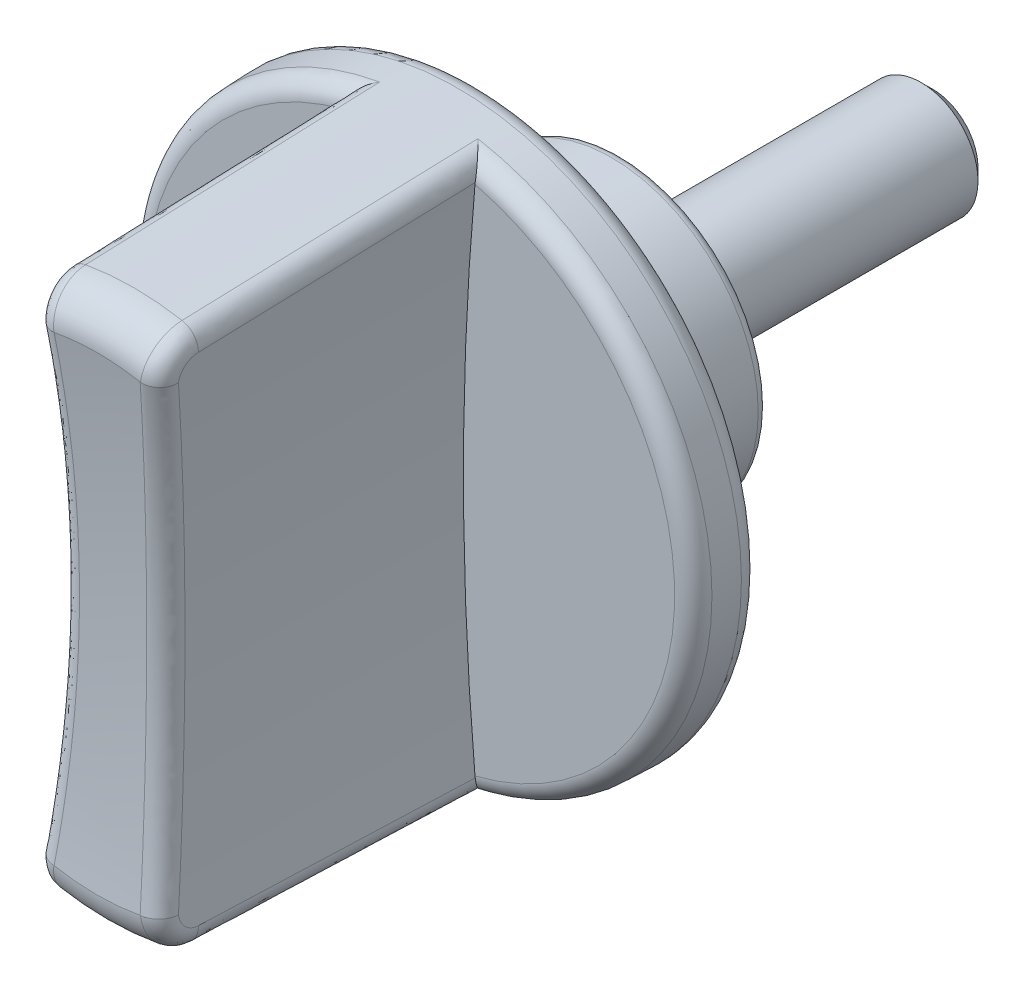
ISO-10303-21;
HEADER;
FILE_DESCRIPTION(('STEP AP214'),'2;1');
FILE_NAME('part.step','',(''),(''),'','','');
FILE_SCHEMA(('AUTOMOTIVE_DESIGN { 1 0 10303 214 1 1 1 1 }'));
ENDSEC;
DATA;
#1=APPLICATION_CONTEXT('core data for automotive mechanical design processes');
#2=APPLICATION_PROTOCOL_DEFINITION('international standard','automotive_design',2000,#1);
#3=PRODUCT_CONTEXT('',#1,'mechanical');
#4=PRODUCT('Part','Part','',(#3));
#5=PRODUCT_RELATED_PRODUCT_CATEGORY('part','',(#4));
#6=PRODUCT_DEFINITION_FORMATION('','',#4);
#7=PRODUCT_DEFINITION_CONTEXT('part definition',#1,'design');
#8=PRODUCT_DEFINITION('design','',#6,#7);
#9=PRODUCT_DEFINITION_SHAPE('','',#8);
#10=(LENGTH_UNIT() NAMED_UNIT(*) SI_UNIT(.MILLI.,.METRE.));
#11=(NAMED_UNIT(*) PLANE_ANGLE_UNIT() SI_UNIT($,.RADIAN.));
#12=(NAMED_UNIT(*) SI_UNIT($,.STERADIAN.) SOLID_ANGLE_UNIT());
#13=UNCERTAINTY_MEASURE_WITH_UNIT(LENGTH_MEASURE(1.E-05),#10,'distance_accuracy_value','');
#14=(GEOMETRIC_REPRESENTATION_CONTEXT(3) GLOBAL_UNCERTAINTY_ASSIGNED_CONTEXT((#13)) GLOBAL_UNIT_ASSIGNED_CONTEXT((#10,
#11,#12)) REPRESENTATION_CONTEXT('',''));
#15=CARTESIAN_POINT('',(0.,0.,0.));
#16=DIRECTION('',(0.,0.,1.));
#17=DIRECTION('',(1.,0.,0.));
#18=AXIS2_PLACEMENT_3D('',#15,#16,#17);
#19=CARTESIAN_POINT('',(0.,0.,9.0348994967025));
#20=DIRECTION('',(0.,0.,-1.));
#21=DIRECTION('',(-1.,0.,0.));
#22=AXIS2_PLACEMENT_3D('',#19,#20,#21);
#23=CONICAL_SURFACE('',#22,14.9638605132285,0.0349065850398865);
#24=CARTESIAN_POINT('',(0.,0.,26.069798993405));
#25=DIRECTION('',(0.,0.,1.));
#26=DIRECTION('',(1.,0.,0.));
#27=AXIS2_PLACEMENT_3D('',#24,#25,#26);
#28=CIRCLE('',#27,14.3689887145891);
#29=CARTESIAN_POINT('',(-2.54030019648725,-14.1426557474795,26.069798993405));
#30=VERTEX_POINT('',#29);
#31=CARTESIAN_POINT('',(2.54030019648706,-14.1426557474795,26.069798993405));
#32=VERTEX_POINT('',#31);
#33=EDGE_CURVE('E164',#30,#32,#28,.T.);
#34=ORIENTED_EDGE('',*,*,#33,.F.);
#35=CARTESIAN_POINT('',(-3.28407586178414,-12.1751022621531,51.8564925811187));
#36=CARTESIAN_POINT('',(-3.3572269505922,-13.0733664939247,51.8881330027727));
#37=CARTESIAN_POINT('',(-2.47072494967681,-13.2386977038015,51.8913920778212));
#38=CARTESIAN_POINT('',(-3.29625817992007,-12.3246956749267,47.5528971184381));
#39=CARTESIAN_POINT('',(-3.37048679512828,-13.2250692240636,47.5802777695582));
#40=CARTESIAN_POINT('',(-2.481761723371,-13.3895173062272,47.5877966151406));
#41=CARTESIAN_POINT('',(-3.30866076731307,-12.4742191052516,43.2492998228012));
#42=CARTESIAN_POINT('',(-3.38395481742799,-13.3764900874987,43.276927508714));
#43=CARTESIAN_POINT('',(-2.49308181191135,-13.5402526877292,43.2841993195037));
#44=CARTESIAN_POINT('',(-3.33390648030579,-12.773135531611,34.6421019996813));
#45=CARTESIAN_POINT('',(-3.4113347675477,-13.6791188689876,34.6698226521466));
#46=CARTESIAN_POINT('',(-2.51627732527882,-13.8415677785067,34.6770014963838));
#47=CARTESIAN_POINT('',(-3.34674960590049,-12.922528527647,30.3385014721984));
#48=CARTESIAN_POINT('',(-3.42524621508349,-13.8303115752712,30.3664881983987));
#49=CARTESIAN_POINT('',(-2.52815275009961,-13.992147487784,30.3734009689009));
#50=CARTESIAN_POINT('',(-3.37287639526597,-13.2211936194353,21.7312975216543));
#51=CARTESIAN_POINT('',(-3.45351306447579,-14.132503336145,21.7593974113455));
#52=CARTESIAN_POINT('',(-2.55244764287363,-14.2931640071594,21.7661970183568));
#53=CARTESIAN_POINT('',(-3.3861600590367,-13.3704657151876,17.4276940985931));
#54=CARTESIAN_POINT('',(-3.46786803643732,-14.2834886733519,17.4560208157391));
#55=CARTESIAN_POINT('',(-2.56486711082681,-14.4436008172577,17.4625935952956));
#56=CARTESIAN_POINT('',(-3.41316792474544,-13.66889656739,8.8204846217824));
#57=CARTESIAN_POINT('',(-3.49702180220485,-14.5852775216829,8.84893399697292));
#58=CARTESIAN_POINT('',(-2.59024087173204,-14.7443416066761,8.8553841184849));
#59=CARTESIAN_POINT('',(-3.42689212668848,-13.8180553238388,4.51687856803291));
#60=CARTESIAN_POINT('',(-3.51182020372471,-14.7360685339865,4.54557049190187));
#61=CARTESIAN_POINT('',(-2.6031951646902,-14.8946455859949,4.55177806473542));
#62=CARTESIAN_POINT('',(-3.44083659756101,-13.9671611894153,0.213271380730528));
#63=CARTESIAN_POINT('',(-3.5268279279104,-14.886650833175,0.24562150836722));
#64=CARTESIAN_POINT('',(-2.61641226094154,-15.0448881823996,0.248170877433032));
#65=(BOUNDED_SURFACE() B_SPLINE_SURFACE(3,2,((#35,#36,#37),(#38,#39,#40),(#41,#42,#43),(#44,#45,
#46),(#47,#48,#49),(#50,#51,#52),(#53,#54,#55),(#56,#57,#58),(#59,#60,#61),(#62,#63,#64)),
.UNSPECIFIED.,.F.,.F.,.F.) B_SPLINE_SURFACE_WITH_KNOTS((4,2,2,2,4),(3,3),(0.,12.9187405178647,
25.8374808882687,38.7562212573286,51.6749617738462),(0.,1.),
.UNSPECIFIED.) GEOMETRIC_REPRESENTATION_ITEM() RATIONAL_B_SPLINE_SURFACE(((1.,0.742631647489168,
1.),(1.,0.741878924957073,1.),(1.,0.74114605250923,1.),(1.,0.739716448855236,1.),(1.,
0.739019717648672,1.),(1.,0.737658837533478,1.),(1.,0.736994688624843,1.),(1.,0.735696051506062,
1.),(1.,0.735061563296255,1.),(1.,0.73444044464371,1.))) REPRESENTATION_ITEM('') SURFACE());
#66=CARTESIAN_POINT('',(-2.47072494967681,-13.2386977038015,51.8913920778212));
#67=CARTESIAN_POINT('',(-2.481761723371,-13.3895173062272,47.5877966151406));
#68=CARTESIAN_POINT('',(-2.49308181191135,-13.5402526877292,43.2841993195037));
#69=CARTESIAN_POINT('',(-2.51627732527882,-13.8415677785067,34.6770014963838));
#70=CARTESIAN_POINT('',(-2.52815275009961,-13.992147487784,30.3734009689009));
#71=CARTESIAN_POINT('',(-2.55244764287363,-14.2931640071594,21.7661970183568));
#72=CARTESIAN_POINT('',(-2.56486711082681,-14.4436008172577,17.4625935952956));
#73=CARTESIAN_POINT('',(-2.59024087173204,-14.7443416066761,8.8553841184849));
#74=CARTESIAN_POINT('',(-2.6031951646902,-14.8946455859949,4.5517780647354));
#75=CARTESIAN_POINT('',(-2.61641226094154,-15.0448881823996,0.248170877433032));
#76=B_SPLINE_CURVE_WITH_KNOTS('',3,(#66,#67,#68,#69,#70,#71,#72,#73,#74,#75),.UNSPECIFIED.,.F.,
.F.,(4,2,2,2,4),(0.,12.9187405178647,25.8374808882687,38.7562212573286,51.6749617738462),.UNSPECIFIED.);
#77=CARTESIAN_POINT('',(-2.58532278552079,-14.6856502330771,10.5348994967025));
#78=VERTEX_POINT('',#77);
#79=EDGE_CURVE('E454',#30,#78,#76,.T.);
#80=ORIENTED_EDGE('',*,*,#79,.T.);
#81=CARTESIAN_POINT('',(0.,0.,10.5348994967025));
#82=DIRECTION('',(0.,0.,-1.));
#83=DIRECTION('',(-1.,0.,0.));
#84=AXIS2_PLACEMENT_3D('',#81,#82,#83);
#85=CIRCLE('',#84,14.9114793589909);
#86=CARTESIAN_POINT('',(-2.58532278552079,14.6856502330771,10.5348994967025));
#87=VERTEX_POINT('',#86);
#88=EDGE_CURVE('E460',#78,#87,#85,.T.);
#89=ORIENTED_EDGE('',*,*,#88,.T.);
#90=CARTESIAN_POINT('',(-2.47072494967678,13.2386977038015,51.8913920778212));
#91=CARTESIAN_POINT('',(-3.35722695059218,13.0733664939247,51.8881330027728));
#92=CARTESIAN_POINT('',(-3.28407586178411,12.1751022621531,51.8564925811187));
#93=CARTESIAN_POINT('',(-2.48176172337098,13.3895173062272,47.5877966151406));
#94=CARTESIAN_POINT('',(-3.37048679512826,13.2250692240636,47.5802777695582));
#95=CARTESIAN_POINT('',(-3.29625817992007,12.3246956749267,47.5528971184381));
#96=CARTESIAN_POINT('',(-2.49308181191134,13.5402526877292,43.2841993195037));
#97=CARTESIAN_POINT('',(-3.38395481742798,13.3764900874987,43.276927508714));
#98=CARTESIAN_POINT('',(-3.30866076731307,12.4742191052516,43.2492998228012));
#99=CARTESIAN_POINT('',(-2.51627732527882,13.8415677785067,34.6770014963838));
#100=CARTESIAN_POINT('',(-3.4113347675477,13.6791188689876,34.6698226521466));
#101=CARTESIAN_POINT('',(-3.33390648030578,12.773135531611,34.6421019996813));
#102=CARTESIAN_POINT('',(-2.5281527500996,13.992147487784,30.3734009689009));
#103=CARTESIAN_POINT('',(-3.42524621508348,13.8303115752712,30.3664881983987));
#104=CARTESIAN_POINT('',(-3.34674960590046,12.922528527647,30.3385014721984));
#105=CARTESIAN_POINT('',(-2.55244764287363,14.2931640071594,21.7661970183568));
#106=CARTESIAN_POINT('',(-3.45351306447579,14.132503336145,21.7593974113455));
#107=CARTESIAN_POINT('',(-3.37287639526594,13.2211936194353,21.7312975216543));
#108=CARTESIAN_POINT('',(-2.56486711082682,14.4436008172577,17.4625935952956));
#109=CARTESIAN_POINT('',(-3.46786803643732,14.2834886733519,17.4560208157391));
#110=CARTESIAN_POINT('',(-3.38616005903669,13.3704657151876,17.4276940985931));
#111=CARTESIAN_POINT('',(-2.59024087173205,14.7443416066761,8.8553841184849));
#112=CARTESIAN_POINT('',(-3.49702180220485,14.5852775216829,8.84893399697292));
#113=CARTESIAN_POINT('',(-3.41316792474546,13.66889656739,8.8204846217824));
#114=CARTESIAN_POINT('',(-2.6031951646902,14.8946455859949,4.55177806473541));
#115=CARTESIAN_POINT('',(-3.51182020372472,14.7360685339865,4.54557049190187));
#116=CARTESIAN_POINT('',(-3.4268921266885,13.8180553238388,4.51687856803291));
#117=CARTESIAN_POINT('',(-2.61641226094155,15.0448881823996,0.248170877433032));
#118=CARTESIAN_POINT('',(-3.52682792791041,14.886650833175,0.24562150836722));
#119=CARTESIAN_POINT('',(-3.44083659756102,13.9671611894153,0.213271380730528));
#120=(BOUNDED_SURFACE() B_SPLINE_SURFACE(3,2,((#90,#91,#92),(#93,#94,#95),(#96,#97,#98),(#99,
#100,#101),(#102,#103,#104),(#105,#106,#107),(#108,#109,#110),(#111,#112,#113),(#114,#115,#116),
(#117,#118,#119)),.UNSPECIFIED.,.F.,.F.,.F.) B_SPLINE_SURFACE_WITH_KNOTS((4,2,2,2,4),(3,3),(0.,
12.9187405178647,25.8374808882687,38.7562212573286,51.6749617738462),(0.,1.),
.UNSPECIFIED.) GEOMETRIC_REPRESENTATION_ITEM() RATIONAL_B_SPLINE_SURFACE(((1.,0.742631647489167,
1.),(1.,0.741878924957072,1.),(1.,0.741146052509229,1.),(1.,0.739716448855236,1.),(1.,
0.739019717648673,1.),(1.,0.737658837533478,1.),(1.,0.736994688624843,1.),(1.,0.735696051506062,
1.),(1.,0.735061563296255,1.),(1.,0.73444044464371,1.))) REPRESENTATION_ITEM('') SURFACE());
#121=CARTESIAN_POINT('',(-2.61641226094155,15.0448881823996,0.248170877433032));
#122=CARTESIAN_POINT('',(-2.6031951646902,14.8946455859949,4.5517780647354));
#123=CARTESIAN_POINT('',(-2.59024087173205,14.7443416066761,8.8553841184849));
#124=CARTESIAN_POINT('',(-2.56486711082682,14.4436008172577,17.4625935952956));
#125=CARTESIAN_POINT('',(-2.55244764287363,14.2931640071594,21.7661970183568));
#126=CARTESIAN_POINT('',(-2.5281527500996,13.992147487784,30.3734009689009));
#127=CARTESIAN_POINT('',(-2.51627732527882,13.8415677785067,34.6770014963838));
#128=CARTESIAN_POINT('',(-2.49308181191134,13.5402526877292,43.2841993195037));
#129=CARTESIAN_POINT('',(-2.48176172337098,13.3895173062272,47.5877966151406));
#130=CARTESIAN_POINT('',(-2.47072494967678,13.2386977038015,51.8913920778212));
#131=B_SPLINE_CURVE_WITH_KNOTS('',3,(#121,#122,#123,#124,#125,#126,#127,#128,#129,#130),
.UNSPECIFIED.,.F.,.F.,(4,2,2,2,4),(0.,12.9187405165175,25.8374808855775,38.7562212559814,
51.6749617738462),.UNSPECIFIED.);
#132=CARTESIAN_POINT('',(-2.54030019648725,14.1426557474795,26.069798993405));
#133=VERTEX_POINT('',#132);
#134=EDGE_CURVE('E145',#87,#133,#131,.T.);
#135=ORIENTED_EDGE('',*,*,#134,.T.);
#136=CARTESIAN_POINT('',(2.54030019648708,14.1426557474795,26.069798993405));
#137=VERTEX_POINT('',#136);
#138=EDGE_CURVE('E152',#137,#133,#28,.T.);
#139=ORIENTED_EDGE('',*,*,#138,.F.);
#140=CARTESIAN_POINT('',(3.28407586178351,12.1751022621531,51.8564925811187));
#141=CARTESIAN_POINT('',(3.35722695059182,13.0733664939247,51.8881330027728));
#142=CARTESIAN_POINT('',(2.47072494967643,13.2386977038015,51.8913920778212));
#143=CARTESIAN_POINT('',(3.2962581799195,12.3246956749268,47.5528971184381));
#144=CARTESIAN_POINT('',(3.37048679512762,13.2250692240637,47.5802777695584));
#145=CARTESIAN_POINT('',(2.48176172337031,13.3895173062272,47.5877966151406));
#146=CARTESIAN_POINT('',(3.30866076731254,12.4742191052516,43.2492998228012));
#147=CARTESIAN_POINT('',(3.38395481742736,13.3764900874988,43.2769275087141));
#148=CARTESIAN_POINT('',(2.49308181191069,13.5402526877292,43.2841993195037));
#149=CARTESIAN_POINT('',(3.33390648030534,12.773135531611,34.6421019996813));
#150=CARTESIAN_POINT('',(3.4113347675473,13.6791188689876,34.6698226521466));
#151=CARTESIAN_POINT('',(2.5162773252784,13.8415677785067,34.6770014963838));
#152=CARTESIAN_POINT('',(3.34674960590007,12.922528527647,30.3385014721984));
#153=CARTESIAN_POINT('',(3.42524621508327,13.8303115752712,30.3664881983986));
#154=CARTESIAN_POINT('',(2.52815275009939,13.992147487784,30.3734009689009));
#155=CARTESIAN_POINT('',(3.3728763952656,13.2211936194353,21.7312975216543));
#156=CARTESIAN_POINT('',(3.45351306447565,14.132503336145,21.7593974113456));
#157=CARTESIAN_POINT('',(2.55244764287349,14.2931640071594,21.7661970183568));
#158=CARTESIAN_POINT('',(3.38616005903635,13.3704657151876,17.4276940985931));
#159=CARTESIAN_POINT('',(3.46786803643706,14.2834886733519,17.4560208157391));
#160=CARTESIAN_POINT('',(2.56486711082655,14.4436008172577,17.4625935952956));
#161=CARTESIAN_POINT('',(3.41316792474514,13.66889656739,8.82048462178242));
#162=CARTESIAN_POINT('',(3.4970218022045,14.585277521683,8.84893399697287));
#163=CARTESIAN_POINT('',(2.59024087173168,14.7443416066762,8.85538411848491));
#164=CARTESIAN_POINT('',(3.4268921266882,13.8180553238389,4.51687856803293));
#165=CARTESIAN_POINT('',(3.5118202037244,14.7360685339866,4.54557049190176));
#166=CARTESIAN_POINT('',(2.60319516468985,14.8946455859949,4.55177806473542));
#167=CARTESIAN_POINT('',(3.44083659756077,13.9671611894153,0.213271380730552));
#168=CARTESIAN_POINT('',(3.52682792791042,14.886650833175,0.245621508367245));
#169=CARTESIAN_POINT('',(2.61641226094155,15.0448881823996,0.24817087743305));
#170=(BOUNDED_SURFACE() B_SPLINE_SURFACE(3,2,((#140,#141,#142),(#143,#144,#145),(#146,#147,
#148),(#149,#150,#151),(#152,#153,#154),(#155,#156,#157),(#158,#159,#160),(#161,#162,#163),
(#164,#165,#166),(#167,#168,#169)),.UNSPECIFIED.,.F.,.F.,.F.) B_SPLINE_SURFACE_WITH_KNOTS((4,2,
2,2,4),(3,3),(0.,12.9187405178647,25.8374808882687,38.7562212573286,51.6749617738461),(0.,1.),
.UNSPECIFIED.) GEOMETRIC_REPRESENTATION_ITEM() RATIONAL_B_SPLINE_SURFACE(((1.,0.742631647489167,
1.),(1.,0.741878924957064,1.),(1.,0.741146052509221,1.),(1.,0.739716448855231,1.),(1.,
0.739019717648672,1.),(1.,0.737658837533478,1.),(1.,0.73699468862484,1.),(1.,0.735696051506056,
1.),(1.,0.735061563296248,1.),(1.,0.73444044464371,1.))) REPRESENTATION_ITEM('') SURFACE());
#171=CARTESIAN_POINT('',(2.47072494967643,13.2386977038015,51.8913920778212));
#172=CARTESIAN_POINT('',(2.48176172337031,13.3895173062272,47.5877966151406));
#173=CARTESIAN_POINT('',(2.49308181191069,13.5402526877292,43.2841993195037));
#174=CARTESIAN_POINT('',(2.5162773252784,13.8415677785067,34.6770014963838));
#175=CARTESIAN_POINT('',(2.52815275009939,13.992147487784,30.3734009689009));
#176=CARTESIAN_POINT('',(2.55244764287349,14.2931640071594,21.7661970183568));
#177=CARTESIAN_POINT('',(2.56486711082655,14.4436008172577,17.4625935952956));
#178=CARTESIAN_POINT('',(2.59024087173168,14.7443416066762,8.8553841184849));
#179=CARTESIAN_POINT('',(2.60319516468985,14.8946455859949,4.55177806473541));
#180=CARTESIAN_POINT('',(2.61641226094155,15.0448881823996,0.24817087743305));
#181=B_SPLINE_CURVE_WITH_KNOTS('',3,(#171,#172,#173,#174,#175,#176,#177,#178,#179,#180),
.UNSPECIFIED.,.F.,.F.,(4,2,2,2,4),(0.,12.9187405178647,25.8374808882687,38.7562212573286,
51.6749617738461),.UNSPECIFIED.);
#182=CARTESIAN_POINT('',(2.58532278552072,14.6856502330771,10.5348994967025));
#183=VERTEX_POINT('',#182);
#184=EDGE_CURVE('E138',#137,#183,#181,.T.);
#185=ORIENTED_EDGE('',*,*,#184,.T.);
#186=CARTESIAN_POINT('',(0.,0.,10.5348994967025));
#187=DIRECTION('',(0.,0.,-1.));
#188=DIRECTION('',(-1.,0.,0.));
#189=AXIS2_PLACEMENT_3D('',#186,#187,#188);
#190=CIRCLE('',#189,14.9114793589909);
#191=CARTESIAN_POINT('',(2.58532278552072,-14.6856502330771,10.5348994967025));
#192=VERTEX_POINT('',#191);
#193=EDGE_CURVE('E146',#183,#192,#190,.T.);
#194=ORIENTED_EDGE('',*,*,#193,.T.);
#195=CARTESIAN_POINT('',(2.47072494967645,-13.2386977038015,51.8913920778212));
#196=CARTESIAN_POINT('',(3.35722695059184,-13.0733664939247,51.8881330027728));
#197=CARTESIAN_POINT('',(3.28407586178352,-12.1751022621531,51.8564925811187));
#198=CARTESIAN_POINT('',(2.48176172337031,-13.3895173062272,47.5877966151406));
#199=CARTESIAN_POINT('',(3.37048679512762,-13.2250692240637,47.5802777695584));
#200=CARTESIAN_POINT('',(3.29625817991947,-12.3246956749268,47.5528971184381));
#201=CARTESIAN_POINT('',(2.49308181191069,-13.5402526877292,43.2841993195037));
#202=CARTESIAN_POINT('',(3.38395481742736,-13.3764900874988,43.2769275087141));
#203=CARTESIAN_POINT('',(3.30866076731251,-12.4742191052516,43.2492998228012));
#204=CARTESIAN_POINT('',(2.5162773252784,-13.8415677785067,34.6770014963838));
#205=CARTESIAN_POINT('',(3.41133476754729,-13.6791188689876,34.6698226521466));
#206=CARTESIAN_POINT('',(3.33390648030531,-12.773135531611,34.6421019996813));
#207=CARTESIAN_POINT('',(2.52815275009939,-13.992147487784,30.3734009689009));
#208=CARTESIAN_POINT('',(3.42524621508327,-13.8303115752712,30.3664881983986));
#209=CARTESIAN_POINT('',(3.34674960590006,-12.922528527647,30.3385014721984));
#210=CARTESIAN_POINT('',(2.55244764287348,-14.2931640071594,21.7661970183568));
#211=CARTESIAN_POINT('',(3.45351306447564,-14.132503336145,21.7593974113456));
#212=CARTESIAN_POINT('',(3.37287639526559,-13.2211936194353,21.7312975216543));
#213=CARTESIAN_POINT('',(2.56486711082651,-14.4436008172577,17.4625935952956));
#214=CARTESIAN_POINT('',(3.46786803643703,-14.2834886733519,17.4560208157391));
#215=CARTESIAN_POINT('',(3.38616005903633,-13.3704657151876,17.4276940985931));
#216=CARTESIAN_POINT('',(2.59024087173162,-14.7443416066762,8.85538411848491));
#217=CARTESIAN_POINT('',(3.49702180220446,-14.585277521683,8.84893399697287));
#218=CARTESIAN_POINT('',(3.41316792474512,-13.6688965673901,8.82048462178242));
#219=CARTESIAN_POINT('',(2.60319516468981,-14.8946455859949,4.55177806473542));
#220=CARTESIAN_POINT('',(3.51182020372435,-14.7360685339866,4.54557049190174));
#221=CARTESIAN_POINT('',(3.4268921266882,-13.8180553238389,4.51687856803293));
#222=CARTESIAN_POINT('',(2.61641226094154,-15.0448881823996,0.24817087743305));
#223=CARTESIAN_POINT('',(3.5268279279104,-14.886650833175,0.245621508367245));
#224=CARTESIAN_POINT('',(3.44083659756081,-13.9671611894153,0.213271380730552));
#225=(BOUNDED_SURFACE() B_SPLINE_SURFACE(3,2,((#195,#196,#197),(#198,#199,#200),(#201,#202,
#203),(#204,#205,#206),(#207,#208,#209),(#210,#211,#212),(#213,#214,#215),(#216,#217,#218),
(#219,#220,#221),(#222,#223,#224)),.UNSPECIFIED.,.F.,.F.,.F.) B_SPLINE_SURFACE_WITH_KNOTS((4,2,
2,2,4),(3,3),(0.,12.9187405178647,25.8374808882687,38.7562212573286,51.6749617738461),(0.,1.),
.UNSPECIFIED.) GEOMETRIC_REPRESENTATION_ITEM() RATIONAL_B_SPLINE_SURFACE(((1.,0.742631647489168,
1.),(1.,0.741878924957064,1.),(1.,0.74114605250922,1.),(1.,0.739716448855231,1.),(1.,
0.739019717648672,1.),(1.,0.737658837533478,1.),(1.,0.736994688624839,1.),(1.,0.735696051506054,
1.),(1.,0.735061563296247,1.),(1.,0.73444044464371,1.))) REPRESENTATION_ITEM('') SURFACE());
#226=CARTESIAN_POINT('',(2.61641226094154,-15.0448881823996,0.24817087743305));
#227=CARTESIAN_POINT('',(2.60319516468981,-14.8946455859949,4.55177806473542));
#228=CARTESIAN_POINT('',(2.59024087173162,-14.7443416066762,8.85538411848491));
#229=CARTESIAN_POINT('',(2.56486711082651,-14.4436008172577,17.4625935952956));
#230=CARTESIAN_POINT('',(2.55244764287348,-14.2931640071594,21.7661970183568));
#231=CARTESIAN_POINT('',(2.52815275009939,-13.992147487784,30.3734009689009));
#232=CARTESIAN_POINT('',(2.5162773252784,-13.8415677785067,34.6770014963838));
#233=CARTESIAN_POINT('',(2.49308181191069,-13.5402526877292,43.2841993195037));
#234=CARTESIAN_POINT('',(2.48176172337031,-13.3895173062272,47.5877966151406));
#235=CARTESIAN_POINT('',(2.47072494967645,-13.2386977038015,51.8913920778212));
#236=B_SPLINE_CURVE_WITH_KNOTS('',3,(#226,#227,#228,#229,#230,#231,#232,#233,#234,#235),
.UNSPECIFIED.,.F.,.F.,(4,2,2,2,4),(0.,12.9187405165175,25.8374808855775,38.7562212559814,
51.6749617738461),.UNSPECIFIED.);
#237=EDGE_CURVE('E478',#192,#32,#236,.T.);
#238=ORIENTED_EDGE('',*,*,#237,.T.);
#239=EDGE_LOOP('',(#34,#80,#89,#135,#139,#185,#194,#238));
#240=FACE_BOUND('',#239,.T.);
#241=CARTESIAN_POINT('',(0.,0.,9.0348994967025));
#242=DIRECTION('',(0.,0.,1.));
#243=DIRECTION('',(1.,0.,0.));
#244=AXIS2_PLACEMENT_3D('',#241,#242,#243);
#245=CIRCLE('',#244,14.9638605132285);
#246=CARTESIAN_POINT('',(14.9638605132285,0.,9.03489949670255));
#247=VERTEX_POINT('',#246);
#248=EDGE_CURVE('E163',#247,#247,#245,.T.);
#249=ORIENTED_EDGE('',*,*,#248,.T.);
#250=EDGE_LOOP('',(#249));
#251=FACE_BOUND('',#250,.T.);
#252=ADVANCED_FACE('F14',(#240,#251),#23,.T.);
#253=CARTESIAN_POINT('',(0.,0.,26.));
#254=DIRECTION('',(0.,0.,1.));
#255=DIRECTION('',(1.,0.,0.));
#256=AXIS2_PLACEMENT_3D('',#253,#254,#255);
#257=TOROIDAL_SURFACE('',#256,12.3702070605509,2.);
#258=CARTESIAN_POINT('',(-5.10022096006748,26.2293832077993,30.1580238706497));
#259=CARTESIAN_POINT('',(-5.04919899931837,25.9420955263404,31.1080364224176));
#260=CARTESIAN_POINT('',(-4.07040142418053,26.1140892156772,31.1139337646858));
#261=CARTESIAN_POINT('',(-4.91107231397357,25.1644836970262,29.8236073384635));
#262=CARTESIAN_POINT('',(-4.86389549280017,24.8867519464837,30.7789353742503));
#263=CARTESIAN_POINT('',(-3.88208420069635,25.0538705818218,30.7831921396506));
#264=CARTESIAN_POINT('',(-4.73239782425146,24.0913982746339,29.509585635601));
#265=CARTESIAN_POINT('',(-4.6891052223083,23.8247402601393,30.4703352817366));
#266=CARTESIAN_POINT('',(-3.70419509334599,23.985502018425,30.4726212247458));
#267=CARTESIAN_POINT('',(-4.39697538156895,21.9307162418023,28.922845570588));
#268=CARTESIAN_POINT('',(-4.36095056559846,21.6864324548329,29.8936616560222));
#269=CARTESIAN_POINT('',(-3.37024703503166,21.8343174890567,29.892328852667));
#270=CARTESIAN_POINT('',(-4.24022820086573,20.8431191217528,28.6501286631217));
#271=CARTESIAN_POINT('',(-4.20766672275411,20.6103663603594,29.6257351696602));
#272=CARTESIAN_POINT('',(-3.21418885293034,20.7515010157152,29.6226088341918));
#273=CARTESIAN_POINT('',(-3.94963897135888,18.6552510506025,28.1465128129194));
#274=CARTESIAN_POINT('',(-3.92346310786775,18.4457423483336,29.1308863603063));
#275=CARTESIAN_POINT('',(-2.92487693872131,18.5732499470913,29.1245272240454));
#276=CARTESIAN_POINT('',(-3.81579898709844,17.5549789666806,27.9156176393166));
#277=CARTESIAN_POINT('',(-3.79261814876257,17.3574384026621,28.9040978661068));
#278=CARTESIAN_POINT('',(-2.79162526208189,17.4778142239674,28.8961693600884));
#279=CARTESIAN_POINT('',(-3.57185939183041,15.3439948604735,27.4961236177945));
#280=CARTESIAN_POINT('',(-3.55410366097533,15.1704760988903,28.4919953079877));
#281=CARTESIAN_POINT('',(-2.54875792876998,15.2765487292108,28.4812851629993));
#282=CARTESIAN_POINT('',(-3.46175936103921,14.2332830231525,27.307524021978));
#283=CARTESIAN_POINT('',(-3.44649739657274,14.0720941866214,28.3067925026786));
#284=CARTESIAN_POINT('',(-2.43914185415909,14.1707191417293,28.2947580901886));
#285=CARTESIAN_POINT('',(-3.17384143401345,10.9534047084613,26.8154875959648));
#286=CARTESIAN_POINT('',(-3.16488899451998,10.8268209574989,27.8232430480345));
#287=CARTESIAN_POINT('',(-2.15248950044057,10.9052578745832,27.808128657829));
#288=CARTESIAN_POINT('',(-3.02984120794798,8.77210691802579,26.5710741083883));
#289=CARTESIAN_POINT('',(-3.02430957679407,8.67116249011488,27.5834882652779));
#290=CARTESIAN_POINT('',(-2.00912224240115,8.73354820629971,27.5664010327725));
#291=CARTESIAN_POINT('',(-2.83750095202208,4.39387142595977,26.2450475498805));
#292=CARTESIAN_POINT('',(-2.83634308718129,4.34250856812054,27.2633382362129));
#293=CARTESIAN_POINT('',(-1.81762743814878,4.3745577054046,27.2439571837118));
#294=CARTESIAN_POINT('',(-2.78914896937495,2.19693571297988,26.1634141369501));
#295=CARTESIAN_POINT('',(-2.78914896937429,2.17185387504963,27.1832722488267));
#296=CARTESIAN_POINT('',(-1.76948799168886,2.1872788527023,27.1632208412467));
#297=CARTESIAN_POINT('',(-2.78914896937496,-2.1969357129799,26.1634141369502));
#298=CARTESIAN_POINT('',(-2.78914896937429,-2.17185387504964,27.1832722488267));
#299=CARTESIAN_POINT('',(-1.76948799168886,-2.18727885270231,27.1632208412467));
#300=CARTESIAN_POINT('',(-2.83750095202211,-4.3938714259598,26.2450475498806));
#301=CARTESIAN_POINT('',(-2.83634308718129,-4.34250856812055,27.2633382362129));
#302=CARTESIAN_POINT('',(-1.81762743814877,-4.37455770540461,27.2439571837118));
#303=CARTESIAN_POINT('',(-3.02984120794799,-8.77210691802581,26.5710741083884));
#304=CARTESIAN_POINT('',(-3.02430957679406,-8.6711624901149,27.583488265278));
#305=CARTESIAN_POINT('',(-2.00912224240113,-8.73354820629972,27.5664010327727));
#306=CARTESIAN_POINT('',(-3.17384143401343,-10.9534047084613,26.8154875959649));
#307=CARTESIAN_POINT('',(-3.16488899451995,-10.8268209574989,27.8232430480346));
#308=CARTESIAN_POINT('',(-2.15248950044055,-10.9052578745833,27.8081286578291));
#309=CARTESIAN_POINT('',(-3.4617593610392,-14.2332830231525,27.3075240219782));
#310=CARTESIAN_POINT('',(-3.44649739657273,-14.0720941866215,28.3067925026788));
#311=CARTESIAN_POINT('',(-2.43914185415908,-14.1707191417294,28.2947580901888));
#312=CARTESIAN_POINT('',(-3.5718593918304,-15.3439948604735,27.4961236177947));
#313=CARTESIAN_POINT('',(-3.55410366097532,-15.1704760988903,28.4919953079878));
#314=CARTESIAN_POINT('',(-2.54875792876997,-15.2765487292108,28.4812851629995));
#315=CARTESIAN_POINT('',(-3.81579898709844,-17.5549789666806,27.9156176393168));
#316=CARTESIAN_POINT('',(-3.79261814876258,-17.3574384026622,28.904097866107));
#317=CARTESIAN_POINT('',(-2.7916252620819,-17.4778142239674,28.8961693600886));
#318=CARTESIAN_POINT('',(-3.94963897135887,-18.6552510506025,28.1465128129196));
#319=CARTESIAN_POINT('',(-3.92346310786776,-18.4457423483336,29.1308863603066));
#320=CARTESIAN_POINT('',(-2.92487693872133,-18.5732499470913,29.1245272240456));
#321=CARTESIAN_POINT('',(-4.24022820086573,-20.8431191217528,28.650128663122));
#322=CARTESIAN_POINT('',(-4.20766672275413,-20.6103663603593,29.6257351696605));
#323=CARTESIAN_POINT('',(-3.21418885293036,-20.7515010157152,29.622608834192));
#324=CARTESIAN_POINT('',(-4.39697538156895,-21.9307162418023,28.9228455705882));
#325=CARTESIAN_POINT('',(-4.36095056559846,-21.6864324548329,29.8936616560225));
#326=CARTESIAN_POINT('',(-3.37024703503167,-21.8343174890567,29.8923288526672));
#327=CARTESIAN_POINT('',(-4.73239782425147,-24.0913982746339,29.5095856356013));
#328=CARTESIAN_POINT('',(-4.6891052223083,-23.8247402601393,30.4703352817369));
#329=CARTESIAN_POINT('',(-3.70419509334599,-23.985502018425,30.4726212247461));
#330=CARTESIAN_POINT('',(-4.91107231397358,-25.1644836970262,29.8236073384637));
#331=CARTESIAN_POINT('',(-4.86389549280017,-24.8867519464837,30.7789353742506));
#332=CARTESIAN_POINT('',(-3.88208420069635,-25.0538705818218,30.7831921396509));
#333=CARTESIAN_POINT('',(-5.10022096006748,-26.2293832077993,30.15802387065));
#334=CARTESIAN_POINT('',(-5.0491989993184,-25.9420955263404,31.1080364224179));
#335=CARTESIAN_POINT('',(-4.07040142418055,-26.1140892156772,31.1139337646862));
#336=(BOUNDED_SURFACE() B_SPLINE_SURFACE(3,2,((#258,#259,#260),(#261,#262,#263),(#264,#265,
#266),(#267,#268,#269),(#270,#271,#272),(#273,#274,#275),(#276,#277,#278),(#279,#280,#281),
(#282,#283,#284),(#285,#286,#287),(#288,#289,#290),(#291,#292,#293),(#294,#295,#296),(#297,#298,
#299),(#300,#301,#302),(#303,#304,#305),(#306,#307,#308),(#309,#310,#311),(#312,#313,#314),
(#315,#316,#317),(#318,#319,#320),(#321,#322,#323),(#324,#325,#326),(#327,#328,#329),(#330,#331,
#332),(#333,#334,#335)),.UNSPECIFIED.,.F.,.F.,.F.) B_SPLINE_SURFACE_WITH_KNOTS((4,2,2,2,2,2,2,2,
2,2,2,2,4),(3,3),(0.,3.41667725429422,6.83347481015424,10.250580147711,13.6676250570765,
20.3013017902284,26.9341494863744,33.5669971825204,40.2006739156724,43.6177188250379,
47.0348241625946,50.4516217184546,53.8682989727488),(0.,1.),
.UNSPECIFIED.) GEOMETRIC_REPRESENTATION_ITEM() RATIONAL_B_SPLINE_SURFACE(((1.,0.709298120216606,
1.),(1.,0.708551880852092,1.),(1.,0.707845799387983,1.),(1.,0.706518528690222,1.),(1.,
0.705897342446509,1.),(1.,0.704744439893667,1.),(1.,0.704212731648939,1.),(1.,0.703242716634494,
1.),(1.,0.702804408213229,1.),(1.,0.701657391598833,1.),(1.,0.701082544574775,1.),(1.,
0.700314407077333,1.),(1.,0.700121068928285,1.),(1.,0.700121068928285,1.),(1.,0.700314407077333,
1.),(1.,0.701082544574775,1.),(1.,0.701657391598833,1.),(1.,0.702804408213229,1.),(1.,
0.703242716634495,1.),(1.,0.70421273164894,1.),(1.,0.704744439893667,1.),(1.,0.70589734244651,
1.),(1.,0.706518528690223,1.),(1.,0.707845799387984,1.),(1.,0.708551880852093,1.),(1.,
0.709298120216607,1.))) REPRESENTATION_ITEM('') SURFACE());
#337=CARTESIAN_POINT('',(-2.26545380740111,-12.1609926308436,28.));
#338=CARTESIAN_POINT('',(-2.26777941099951,-12.1605218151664,28.0000000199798));
#339=CARTESIAN_POINT('',(-2.27011553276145,-12.1601298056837,28.0000000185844));
#340=CARTESIAN_POINT('',(-2.27480882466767,-12.1595033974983,27.9999999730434));
#341=CARTESIAN_POINT('',(-2.27716599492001,-12.1592689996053,27.9999999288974));
#342=CARTESIAN_POINT('',(-2.27953368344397,-12.1591134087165,27.9999998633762));
#343=B_SPLINE_CURVE_WITH_KNOTS('',3,(#337,#338,#339,#340,#341,#342),.UNSPECIFIED.,.F.,.F.,(4,2,
4),(0.,0.00710635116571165,0.01421273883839),.UNSPECIFIED.);
#344=CARTESIAN_POINT('',(-2.26545380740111,-12.1609926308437,28.));
#345=VERTEX_POINT('',#344);
#346=CARTESIAN_POINT('',(-2.27953368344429,-12.1591134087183,27.9999998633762));
#347=VERTEX_POINT('',#346);
#348=EDGE_CURVE('E436',#345,#347,#343,.T.);
#349=ORIENTED_EDGE('',*,*,#348,.T.);
#350=CARTESIAN_POINT('',(-2.53653713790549,-14.1136545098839,25.6524571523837));
#351=CARTESIAN_POINT('',(-3.43692781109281,-13.9543847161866,25.6666827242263));
#352=CARTESIAN_POINT('',(-3.35854418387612,-13.0573486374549,25.8262285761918));
#353=CARTESIAN_POINT('',(-2.53810104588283,-14.1257062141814,25.7212084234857));
#354=CARTESIAN_POINT('',(-3.43794104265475,-13.965558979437,25.7326743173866));
#355=CARTESIAN_POINT('',(-3.35907128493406,-13.0633794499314,25.8606042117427));
#356=CARTESIAN_POINT('',(-2.53919855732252,-14.1341647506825,25.7905710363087));
#357=CARTESIAN_POINT('',(-3.4386524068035,-13.9733995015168,25.7992134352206));
#358=CARTESIAN_POINT('',(-3.35944138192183,-13.0676121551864,25.8952855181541));
#359=CARTESIAN_POINT('',(-2.54045624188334,-14.1438582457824,25.9299207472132));
#360=CARTESIAN_POINT('',(-3.43946762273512,-13.9823822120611,25.932823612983));
#361=CARTESIAN_POINT('',(-3.35986559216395,-13.0724628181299,25.9649603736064));
#362=CARTESIAN_POINT('',(-2.54061493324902,-14.1450817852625,25.9999086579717));
#363=CARTESIAN_POINT('',(-3.43957072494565,-13.9835161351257,25.9999125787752));
#364=CARTESIAN_POINT('',(-3.3599192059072,-13.0730750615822,25.9999543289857));
#365=CARTESIAN_POINT('',(-2.53979595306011,-14.138768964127,26.1817711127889));
#366=CARTESIAN_POINT('',(-3.4390395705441,-13.977666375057,26.1742564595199));
#367=CARTESIAN_POINT('',(-3.35964284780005,-13.0699161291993,26.0908855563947));
#368=CARTESIAN_POINT('',(-2.53807653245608,-14.1255145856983,26.2934927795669));
#369=CARTESIAN_POINT('',(-3.43792355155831,-13.9653793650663,26.2814240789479));
#370=CARTESIAN_POINT('',(-3.3590624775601,-13.0632836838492,26.1467463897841));
#371=CARTESIAN_POINT('',(-2.53225104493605,-14.0806305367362,26.5131195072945));
#372=CARTESIAN_POINT('',(-3.43415179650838,-13.9237441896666,26.4923972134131));
#373=CARTESIAN_POINT('',(-3.3571006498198,-13.0408228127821,26.2565597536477));
#374=CARTESIAN_POINT('',(-2.52814354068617,-14.0489897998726,26.6210222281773));
#375=CARTESIAN_POINT('',(-3.43149263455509,-13.8943581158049,26.5962682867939));
#376=CARTESIAN_POINT('',(-3.35571870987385,-13.0249888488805,26.3105111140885));
#377=CARTESIAN_POINT('',(-2.51765575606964,-13.9682663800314,26.8298883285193));
#378=CARTESIAN_POINT('',(-3.42472668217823,-13.8192784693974,26.7979353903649));
#379=CARTESIAN_POINT('',(-3.352202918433,-12.9845894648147,26.4149441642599));
#380=CARTESIAN_POINT('',(-2.51127646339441,-13.9191912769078,26.9308547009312));
#381=CARTESIAN_POINT('',(-3.42061611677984,-13.7735427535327,26.895792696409));
#382=CARTESIAN_POINT('',(-3.35006939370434,-12.9600278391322,26.4654273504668));
#383=CARTESIAN_POINT('',(-2.49641729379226,-13.8050114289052,27.1230473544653));
#384=CARTESIAN_POINT('',(-3.41108321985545,-13.6668880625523,27.0829795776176));
#385=CARTESIAN_POINT('',(-3.34512397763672,-12.9028761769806,26.5615236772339));
#386=CARTESIAN_POINT('',(-2.4879372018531,-13.7399050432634,27.2142726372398));
#387=CARTESIAN_POINT('',(-3.40565474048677,-13.6058991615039,27.1723525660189));
#388=CARTESIAN_POINT('',(-3.34231201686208,-12.8702853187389,26.6071363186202));
#389=CARTESIAN_POINT('',(-2.46908943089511,-13.5954148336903,27.3845687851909));
#390=CARTESIAN_POINT('',(-3.39365068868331,-13.4701119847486,27.3404193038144));
#391=CARTESIAN_POINT('',(-3.33609996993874,-12.7979475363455,26.6922843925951));
#392=CARTESIAN_POINT('',(-2.4587185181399,-13.5160065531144,27.4636183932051));
#393=CARTESIAN_POINT('',(-3.38706594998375,-13.395206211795,27.4191191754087));
#394=CARTESIAN_POINT('',(-3.33269887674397,-12.7581883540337,26.7318091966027));
#395=CARTESIAN_POINT('',(-2.43637743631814,-13.3452616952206,27.6071770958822));
#396=CARTESIAN_POINT('',(-3.37296064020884,-13.2334658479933,27.5636105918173));
#397=CARTESIAN_POINT('',(-3.32542461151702,-12.6726847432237,26.8035885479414));
#398=CARTESIAN_POINT('',(-2.42440716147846,-13.2539243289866,27.671685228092));
#399=CARTESIAN_POINT('',(-3.3654321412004,-13.146536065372,27.6294028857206));
#400=CARTESIAN_POINT('',(-3.32155140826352,-12.6269399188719,26.835842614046));
#401=CARTESIAN_POINT('',(-2.39913642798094,-13.0615299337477,27.7846111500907));
#402=CARTESIAN_POINT('',(-3.34963230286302,-12.9624623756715,27.7465483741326));
#403=CARTESIAN_POINT('',(-3.31344101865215,-12.5305657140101,26.8923055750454));
#404=CARTESIAN_POINT('',(-2.38583073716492,-12.9604347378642,27.8329621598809));
#405=CARTESIAN_POINT('',(-3.34135028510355,-12.8651811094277,27.7978151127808));
#406=CARTESIAN_POINT('',(-3.30920241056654,-12.4799171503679,26.9164810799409));
#407=CARTESIAN_POINT('',(-2.35828870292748,-12.7517205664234,27.911885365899));
#408=CARTESIAN_POINT('',(-3.32430943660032,-12.6630601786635,27.8840705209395));
#409=CARTESIAN_POINT('',(-3.30050751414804,-12.3753314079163,26.95594268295));
#410=CARTESIAN_POINT('',(-2.34405238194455,-12.6441017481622,27.942457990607));
#411=CARTESIAN_POINT('',(-3.31554350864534,-12.5581272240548,27.9190056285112));
#412=CARTESIAN_POINT('',(-3.29605123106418,-12.3213943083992,26.9712289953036));
#413=CARTESIAN_POINT('',(-2.31496623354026,-12.4248783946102,27.9850986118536));
#414=CARTESIAN_POINT('',(-3.29773683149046,-12.3427725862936,27.9715668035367));
#415=CARTESIAN_POINT('',(-3.28703416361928,-12.2114994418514,26.9925493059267));
#416=CARTESIAN_POINT('',(-2.30011392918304,-12.3132580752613,27.9970825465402));
#417=CARTESIAN_POINT('',(-3.2886896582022,-12.2322516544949,27.9890314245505));
#418=CARTESIAN_POINT('',(-3.28247299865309,-12.1555336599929,26.9985412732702));
#419=CARTESIAN_POINT('',(-2.27025985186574,-12.0896276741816,28.0019761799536));
#420=CARTESIAN_POINT('',(-3.27060012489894,-12.0089238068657,28.005565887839));
#421=CARTESIAN_POINT('',(-3.27339685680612,-12.0433816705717,27.0009880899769));
#422=CARTESIAN_POINT('',(-2.25525804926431,-11.9776175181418,27.9948820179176));
#423=CARTESIAN_POINT('',(-3.26155455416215,-11.8960629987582,28.004526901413));
#424=CARTESIAN_POINT('',(-3.26888188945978,-11.9871954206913,26.9974410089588));
#425=CARTESIAN_POINT('',(-2.22548303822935,-11.75608355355,27.9617454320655));
#426=CARTESIAN_POINT('',(-3.24368390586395,-11.6707215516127,27.983549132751));
#427=CARTESIAN_POINT('',(-3.26001246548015,-11.8760444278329,26.9808727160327));
#428=CARTESIAN_POINT('',(-2.21071058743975,-11.6465675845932,27.9356500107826));
#429=CARTESIAN_POINT('',(-3.2348593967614,-11.5582263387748,27.9634374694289));
#430=CARTESIAN_POINT('',(-3.25565849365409,-11.821083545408,26.9678250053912));
#431=CARTESIAN_POINT('',(-2.18184746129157,-11.4333419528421,27.8652599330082));
#432=CARTESIAN_POINT('',(-3.21767584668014,-11.3369636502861,27.904295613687));
#433=CARTESIAN_POINT('',(-3.24723521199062,-11.7140515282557,26.9326299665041));
#434=CARTESIAN_POINT('',(-2.16775728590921,-11.3296365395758,27.8209521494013));
#435=CARTESIAN_POINT('',(-3.20932025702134,-11.2282244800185,27.8651311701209));
#436=CARTESIAN_POINT('',(-3.24316610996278,-11.6619825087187,26.9104760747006));
#437=CARTESIAN_POINT('',(-2.15422439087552,-11.2304160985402,27.7679622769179));
#438=CARTESIAN_POINT('',(-3.20134856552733,-11.1234113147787,27.8167118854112));
#439=CARTESIAN_POINT('',(-3.23929810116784,-11.6121533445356,26.8839811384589));
#440=(BOUNDED_SURFACE() B_SPLINE_SURFACE(3,2,((#350,#351,#352),(#353,#354,#355),(#356,#357,
#358),(#359,#360,#361),(#362,#363,#364),(#365,#366,#367),(#368,#369,#370),(#371,#372,#373),
(#374,#375,#376),(#377,#378,#379),(#380,#381,#382),(#383,#384,#385),(#386,#387,#388),(#389,#390,
#391),(#392,#393,#394),(#395,#396,#397),(#398,#399,#400),(#401,#402,#403),(#404,#405,#406),
(#407,#408,#409),(#410,#411,#412),(#413,#414,#415),(#416,#417,#418),(#419,#420,#421),(#422,#423,
#424),(#425,#426,#427),(#428,#429,#430),(#431,#432,#433),(#434,#435,#436),(#437,#438,#439)),
.UNSPECIFIED.,.F.,.F.,.F.) B_SPLINE_SURFACE_WITH_KNOTS((4,2,2,2,2,2,2,2,2,2,2,2,2,2,4),(3,3),
(0.,0.104655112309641,0.209475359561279,0.37740909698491,0.545444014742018,0.71340596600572,
0.881385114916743,1.04965428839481,1.21793459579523,1.38690206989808,1.5558654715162,
1.72559075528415,1.89535038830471,2.06558532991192,2.23594318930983),(0.,1.),
.UNSPECIFIED.) GEOMETRIC_REPRESENTATION_ITEM() RATIONAL_B_SPLINE_SURFACE(((1.,0.737957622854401,
1.),(1.,0.73811646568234,1.),(1.,0.738227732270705,1.),(1.,0.738355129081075,1.),(1.,
0.738371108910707,1.),(1.,0.738288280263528,1.),(1.,0.738114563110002,1.),(1.,0.737521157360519,
1.),(1.,0.737101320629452,1.),(1.,0.736015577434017,1.),(1.,0.735349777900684,1.),(1.,
0.733772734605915,1.),(1.,0.732861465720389,1.),(1.,0.73079484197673,1.),(1.,0.729639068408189,
1.),(1.,0.727091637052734,1.),(1.,0.725699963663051,1.),(1.,0.722688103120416,1.),(1.,
0.721067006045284,1.),(1.,0.717622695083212,1.),(1.,0.71579948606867,1.),(1.,0.711974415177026,
1.),(1.,0.709971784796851,1.),(1.,0.705839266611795,1.),(1.,0.703709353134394,1.),(1.,
0.699373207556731,1.),(1.,0.697166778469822,1.),(1.,0.692754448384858,1.),(1.,0.690548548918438,
1.),(1.,0.688380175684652,1.))) REPRESENTATION_ITEM('') SURFACE());
#441=CARTESIAN_POINT('',(-2.15422439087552,-11.2304160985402,27.7679622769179));
#442=CARTESIAN_POINT('',(-2.16775728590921,-11.3296365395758,27.8209521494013));
#443=CARTESIAN_POINT('',(-2.18184746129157,-11.4333419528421,27.8652599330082));
#444=CARTESIAN_POINT('',(-2.21071058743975,-11.6465675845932,27.9356500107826));
#445=CARTESIAN_POINT('',(-2.22548303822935,-11.75608355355,27.9617454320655));
#446=CARTESIAN_POINT('',(-2.25525804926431,-11.9776175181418,27.9948820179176));
#447=CARTESIAN_POINT('',(-2.27025985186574,-12.0896276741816,28.0019761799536));
#448=CARTESIAN_POINT('',(-2.30011392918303,-12.3132580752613,27.9970825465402));
#449=CARTESIAN_POINT('',(-2.31496623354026,-12.4248783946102,27.9850986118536));
#450=CARTESIAN_POINT('',(-2.34405238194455,-12.6441017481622,27.942457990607));
#451=CARTESIAN_POINT('',(-2.35828870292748,-12.7517205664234,27.911885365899));
#452=CARTESIAN_POINT('',(-2.38583073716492,-12.9604347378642,27.8329621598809));
#453=CARTESIAN_POINT('',(-2.39913642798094,-13.0615299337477,27.7846111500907));
#454=CARTESIAN_POINT('',(-2.42440716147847,-13.2539243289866,27.671685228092));
#455=CARTESIAN_POINT('',(-2.43637743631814,-13.3452616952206,27.6071770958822));
#456=CARTESIAN_POINT('',(-2.4587185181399,-13.5160065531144,27.4636183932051));
#457=CARTESIAN_POINT('',(-2.46908943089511,-13.5954148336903,27.3845687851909));
#458=CARTESIAN_POINT('',(-2.4879372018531,-13.7399050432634,27.2142726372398));
#459=CARTESIAN_POINT('',(-2.49641729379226,-13.8050114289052,27.1230473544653));
#460=CARTESIAN_POINT('',(-2.51127646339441,-13.9191912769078,26.9308547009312));
#461=CARTESIAN_POINT('',(-2.51765575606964,-13.9682663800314,26.8298883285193));
#462=CARTESIAN_POINT('',(-2.52814354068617,-14.0489897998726,26.6210222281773));
#463=CARTESIAN_POINT('',(-2.53225104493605,-14.0806305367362,26.5131195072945));
#464=CARTESIAN_POINT('',(-2.53807653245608,-14.1255145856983,26.2934927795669));
#465=CARTESIAN_POINT('',(-2.53979595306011,-14.138768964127,26.1817711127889));
#466=CARTESIAN_POINT('',(-2.54061493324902,-14.1450817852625,25.9999086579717));
#467=CARTESIAN_POINT('',(-2.54045624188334,-14.1438582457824,25.9299207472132));
#468=CARTESIAN_POINT('',(-2.53919855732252,-14.1341647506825,25.7905710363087));
#469=CARTESIAN_POINT('',(-2.53810104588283,-14.1257062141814,25.7212084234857));
#470=CARTESIAN_POINT('',(-2.53653713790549,-14.1136545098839,25.6524571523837));
#471=B_SPLINE_CURVE_WITH_KNOTS('',3,(#441,#442,#443,#444,#445,#446,#447,#448,#449,#450,#451,
#452,#453,#454,#455,#456,#457,#458,#459,#460,#461,#462,#463,#464,#465,#466,#467,#468,#469,#470),
.UNSPECIFIED.,.F.,.F.,(4,2,2,2,2,2,2,2,2,2,2,2,2,2,4),(0.,0.170357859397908,0.340592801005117,
0.510352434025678,0.680077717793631,0.849041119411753,1.0180085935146,1.18628890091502,
1.35455807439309,1.52253722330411,1.69049917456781,1.85853409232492,2.02646782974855,
2.13128807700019,2.23594318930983),.UNSPECIFIED.);
#472=EDGE_CURVE('E430',#347,#30,#471,.T.);
#473=ORIENTED_EDGE('',*,*,#472,.T.);
#474=ORIENTED_EDGE('',*,*,#33,.T.);
#475=CARTESIAN_POINT('',(3.35854418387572,-13.0573486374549,25.8262285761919));
#476=CARTESIAN_POINT('',(3.43692781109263,-13.9543847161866,25.6666827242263));
#477=CARTESIAN_POINT('',(2.53653713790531,-14.1136545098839,25.6524571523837));
#478=CARTESIAN_POINT('',(3.35907128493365,-13.0633794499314,25.8606042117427));
#479=CARTESIAN_POINT('',(3.43794104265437,-13.965558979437,25.7326743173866));
#480=CARTESIAN_POINT('',(2.53810104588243,-14.1257062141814,25.7212084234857));
#481=CARTESIAN_POINT('',(3.35944138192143,-13.0676121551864,25.8952855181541));
#482=CARTESIAN_POINT('',(3.43865240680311,-13.9733995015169,25.7992134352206));
#483=CARTESIAN_POINT('',(2.53919855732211,-14.1341647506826,25.7905710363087));
#484=CARTESIAN_POINT('',(3.35986559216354,-13.0724628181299,25.9649603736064));
#485=CARTESIAN_POINT('',(3.43946762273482,-13.9823822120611,25.932823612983));
#486=CARTESIAN_POINT('',(2.54045624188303,-14.1438582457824,25.9299207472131));
#487=CARTESIAN_POINT('',(3.35991920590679,-13.0730750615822,25.9999543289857));
#488=CARTESIAN_POINT('',(3.43957072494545,-13.9835161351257,25.9999125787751));
#489=CARTESIAN_POINT('',(2.54061493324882,-14.1450817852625,25.9999086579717));
#490=CARTESIAN_POINT('',(3.35964284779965,-13.0699161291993,26.0908855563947));
#491=CARTESIAN_POINT('',(3.43903957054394,-13.977666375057,26.1742564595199));
#492=CARTESIAN_POINT('',(2.53979595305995,-14.138768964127,26.1817711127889));
#493=CARTESIAN_POINT('',(3.35906247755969,-13.0632836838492,26.1467463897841));
#494=CARTESIAN_POINT('',(3.43792355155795,-13.9653793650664,26.2814240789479));
#495=CARTESIAN_POINT('',(2.53807653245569,-14.1255145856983,26.2934927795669));
#496=CARTESIAN_POINT('',(3.35710064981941,-13.0408228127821,26.2565597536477));
#497=CARTESIAN_POINT('',(3.43415179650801,-13.9237441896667,26.4923972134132));
#498=CARTESIAN_POINT('',(2.53225104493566,-14.0806305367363,26.5131195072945));
#499=CARTESIAN_POINT('',(3.35571870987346,-13.0249888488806,26.3105111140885));
#500=CARTESIAN_POINT('',(3.4314926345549,-13.8943581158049,26.5962682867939));
#501=CARTESIAN_POINT('',(2.52814354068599,-14.0489897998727,26.6210222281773));
#502=CARTESIAN_POINT('',(3.35220291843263,-12.9845894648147,26.4149441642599));
#503=CARTESIAN_POINT('',(3.42472668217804,-13.8192784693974,26.7979353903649));
#504=CARTESIAN_POINT('',(2.51765575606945,-13.9682663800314,26.8298883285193));
#505=CARTESIAN_POINT('',(3.35006939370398,-12.9600278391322,26.4654273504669));
#506=CARTESIAN_POINT('',(3.42061611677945,-13.7735427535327,26.895792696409));
#507=CARTESIAN_POINT('',(2.51127646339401,-13.9191912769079,26.9308547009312));
#508=CARTESIAN_POINT('',(3.34512397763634,-12.9028761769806,26.5615236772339));
#509=CARTESIAN_POINT('',(3.41108321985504,-13.6668880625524,27.0829795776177));
#510=CARTESIAN_POINT('',(2.49641729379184,-13.8050114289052,27.1230473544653));
#511=CARTESIAN_POINT('',(3.34231201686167,-12.8702853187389,26.6071363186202));
#512=CARTESIAN_POINT('',(3.40565474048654,-13.6058991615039,27.1723525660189));
#513=CARTESIAN_POINT('',(2.48793720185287,-13.7399050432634,27.2142726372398));
#514=CARTESIAN_POINT('',(3.33609996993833,-12.7979475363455,26.6922843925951));
#515=CARTESIAN_POINT('',(3.39365068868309,-13.4701119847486,27.3404193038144));
#516=CARTESIAN_POINT('',(2.4690894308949,-13.5954148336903,27.3845687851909));
#517=CARTESIAN_POINT('',(3.3326988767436,-12.7581883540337,26.7318091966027));
#518=CARTESIAN_POINT('',(3.38706594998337,-13.395206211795,27.4191191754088));
#519=CARTESIAN_POINT('',(2.45871851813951,-13.5160065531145,27.4636183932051));
#520=CARTESIAN_POINT('',(3.32542461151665,-12.6726847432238,26.8035885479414));
#521=CARTESIAN_POINT('',(3.37296064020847,-13.2334658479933,27.5636105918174));
#522=CARTESIAN_POINT('',(2.43637743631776,-13.3452616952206,27.6071770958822));
#523=CARTESIAN_POINT('',(3.32155140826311,-12.6269399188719,26.835842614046));
#524=CARTESIAN_POINT('',(3.36543214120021,-13.146536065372,27.6294028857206));
#525=CARTESIAN_POINT('',(2.42440716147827,-13.2539243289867,27.671685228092));
#526=CARTESIAN_POINT('',(3.31344101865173,-12.5305657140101,26.8923055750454));
#527=CARTESIAN_POINT('',(3.34963230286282,-12.9624623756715,27.7465483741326));
#528=CARTESIAN_POINT('',(2.39913642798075,-13.0615299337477,27.7846111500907));
#529=CARTESIAN_POINT('',(3.30920241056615,-12.4799171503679,26.9164810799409));
#530=CARTESIAN_POINT('',(3.34135028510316,-12.8651811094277,27.7978151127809));
#531=CARTESIAN_POINT('',(2.38583073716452,-12.9604347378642,27.8329621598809));
#532=CARTESIAN_POINT('',(3.30050751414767,-12.3753314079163,26.95594268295));
#533=CARTESIAN_POINT('',(3.32430943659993,-12.6630601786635,27.8840705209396));
#534=CARTESIAN_POINT('',(2.35828870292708,-12.7517205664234,27.911885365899));
#535=CARTESIAN_POINT('',(3.2960512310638,-12.3213943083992,26.9712289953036));
#536=CARTESIAN_POINT('',(3.31554350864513,-12.5581272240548,27.9190056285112));
#537=CARTESIAN_POINT('',(2.34405238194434,-12.6441017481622,27.942457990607));
#538=CARTESIAN_POINT('',(3.28703416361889,-12.2114994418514,26.9925493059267));
#539=CARTESIAN_POINT('',(3.29773683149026,-12.3427725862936,27.9715668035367));
#540=CARTESIAN_POINT('',(2.31496623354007,-12.4248783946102,27.9850986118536));
#541=CARTESIAN_POINT('',(3.28247299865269,-12.1555336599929,26.9985412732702));
#542=CARTESIAN_POINT('',(3.28868965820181,-12.2322516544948,27.9890314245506));
#543=CARTESIAN_POINT('',(2.30011392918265,-12.3132580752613,27.9970825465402));
#544=CARTESIAN_POINT('',(3.27339685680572,-12.0433816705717,27.000988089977));
#545=CARTESIAN_POINT('',(3.27060012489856,-12.0089238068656,28.0055658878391));
#546=CARTESIAN_POINT('',(2.27025985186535,-12.0896276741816,28.0019761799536));
#547=CARTESIAN_POINT('',(3.26888188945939,-11.9871954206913,26.9974410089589));
#548=CARTESIAN_POINT('',(3.26155455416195,-11.8960629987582,28.0045269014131));
#549=CARTESIAN_POINT('',(2.25525804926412,-11.9776175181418,27.9948820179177));
#550=CARTESIAN_POINT('',(3.26001246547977,-11.8760444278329,26.9808727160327));
#551=CARTESIAN_POINT('',(3.24368390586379,-11.6707215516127,27.983549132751));
#552=CARTESIAN_POINT('',(2.2254830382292,-11.75608355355,27.9617454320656));
#553=CARTESIAN_POINT('',(3.2556584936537,-11.821083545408,26.9678250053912));
#554=CARTESIAN_POINT('',(3.2348593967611,-11.5582263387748,27.9634374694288));
#555=CARTESIAN_POINT('',(2.21071058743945,-11.6465675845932,27.9356500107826));
#556=CARTESIAN_POINT('',(3.24723521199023,-11.7140515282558,26.9326299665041));
#557=CARTESIAN_POINT('',(3.21767584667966,-11.3369636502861,27.9042956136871));
#558=CARTESIAN_POINT('',(2.1818474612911,-11.4333419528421,27.8652599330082));
#559=CARTESIAN_POINT('',(3.24316610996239,-11.6619825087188,26.9104760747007));
#560=CARTESIAN_POINT('',(3.20932025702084,-11.2282244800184,27.8651311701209));
#561=CARTESIAN_POINT('',(2.16775728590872,-11.3296365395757,27.8209521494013));
#562=CARTESIAN_POINT('',(3.23929810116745,-11.6121533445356,26.883981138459));
#563=CARTESIAN_POINT('',(3.20134856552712,-11.1234113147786,27.8167118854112));
#564=CARTESIAN_POINT('',(2.15422439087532,-11.2304160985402,27.7679622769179));
#565=(BOUNDED_SURFACE() B_SPLINE_SURFACE(3,2,((#475,#476,#477),(#478,#479,#480),(#481,#482,
#483),(#484,#485,#486),(#487,#488,#489),(#490,#491,#492),(#493,#494,#495),(#496,#497,#498),
(#499,#500,#501),(#502,#503,#504),(#505,#506,#507),(#508,#509,#510),(#511,#512,#513),(#514,#515,
#516),(#517,#518,#519),(#520,#521,#522),(#523,#524,#525),(#526,#527,#528),(#529,#530,#531),
(#532,#533,#534),(#535,#536,#537),(#538,#539,#540),(#541,#542,#543),(#544,#545,#546),(#547,#548,
#549),(#550,#551,#552),(#553,#554,#555),(#556,#557,#558),(#559,#560,#561),(#562,#563,#564)),
.UNSPECIFIED.,.F.,.F.,.F.) B_SPLINE_SURFACE_WITH_KNOTS((4,2,2,2,2,2,2,2,2,2,2,2,2,2,4),(3,3),
(0.,0.104655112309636,0.20947535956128,0.377409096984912,0.545444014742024,0.713405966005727,
0.881385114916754,1.04965428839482,1.21793459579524,1.3869020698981,1.55586547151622,
1.72559075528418,1.89535038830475,2.06558532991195,2.23594318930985),(0.,1.),
.UNSPECIFIED.) GEOMETRIC_REPRESENTATION_ITEM() RATIONAL_B_SPLINE_SURFACE(((1.,0.737957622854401,
1.),(1.,0.738116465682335,1.),(1.,0.738227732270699,1.),(1.,0.738355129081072,1.),(1.,
0.738371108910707,1.),(1.,0.738288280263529,1.),(1.,0.738114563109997,1.),(1.,0.737521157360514,
1.),(1.,0.737101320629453,1.),(1.,0.736015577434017,1.),(1.,0.735349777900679,1.),(1.,
0.733772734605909,1.),(1.,0.732861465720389,1.),(1.,0.73079484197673,1.),(1.,0.729639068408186,
1.),(1.,0.727091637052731,1.),(1.,0.725699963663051,1.),(1.,0.722688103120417,1.),(1.,
0.721067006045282,1.),(1.,0.717622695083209,1.),(1.,0.71579948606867,1.),(1.,0.711974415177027,
1.),(1.,0.70997178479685,1.),(1.,0.705839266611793,1.),(1.,0.703709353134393,1.),(1.,
0.699373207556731,1.),(1.,0.697166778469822,1.),(1.,0.692754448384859,1.),(1.,0.690548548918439,
1.),(1.,0.688380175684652,1.))) REPRESENTATION_ITEM('') SURFACE());
#566=CARTESIAN_POINT('',(2.53653713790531,-14.1136545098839,25.6524571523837));
#567=CARTESIAN_POINT('',(2.53810104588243,-14.1257062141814,25.7212084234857));
#568=CARTESIAN_POINT('',(2.53919855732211,-14.1341647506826,25.7905710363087));
#569=CARTESIAN_POINT('',(2.54045624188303,-14.1438582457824,25.9299207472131));
#570=CARTESIAN_POINT('',(2.54061493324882,-14.1450817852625,25.9999086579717));
#571=CARTESIAN_POINT('',(2.53979595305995,-14.138768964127,26.1817711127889));
#572=CARTESIAN_POINT('',(2.53807653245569,-14.1255145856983,26.2934927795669));
#573=CARTESIAN_POINT('',(2.53225104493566,-14.0806305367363,26.5131195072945));
#574=CARTESIAN_POINT('',(2.52814354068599,-14.0489897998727,26.6210222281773));
#575=CARTESIAN_POINT('',(2.51765575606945,-13.9682663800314,26.8298883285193));
#576=CARTESIAN_POINT('',(2.51127646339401,-13.9191912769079,26.9308547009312));
#577=CARTESIAN_POINT('',(2.49641729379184,-13.8050114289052,27.1230473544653));
#578=CARTESIAN_POINT('',(2.48793720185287,-13.7399050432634,27.2142726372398));
#579=CARTESIAN_POINT('',(2.4690894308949,-13.5954148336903,27.3845687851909));
#580=CARTESIAN_POINT('',(2.45871851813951,-13.5160065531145,27.4636183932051));
#581=CARTESIAN_POINT('',(2.43637743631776,-13.3452616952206,27.6071770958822));
#582=CARTESIAN_POINT('',(2.42440716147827,-13.2539243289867,27.671685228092));
#583=CARTESIAN_POINT('',(2.39913642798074,-13.0615299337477,27.7846111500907));
#584=CARTESIAN_POINT('',(2.38583073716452,-12.9604347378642,27.8329621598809));
#585=CARTESIAN_POINT('',(2.35828870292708,-12.7517205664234,27.911885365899));
#586=CARTESIAN_POINT('',(2.34405238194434,-12.6441017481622,27.942457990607));
#587=CARTESIAN_POINT('',(2.31496623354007,-12.4248783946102,27.9850986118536));
#588=CARTESIAN_POINT('',(2.30011392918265,-12.3132580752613,27.9970825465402));
#589=CARTESIAN_POINT('',(2.27025985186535,-12.0896276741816,28.0019761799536));
#590=CARTESIAN_POINT('',(2.25525804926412,-11.9776175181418,27.9948820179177));
#591=CARTESIAN_POINT('',(2.2254830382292,-11.75608355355,27.9617454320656));
#592=CARTESIAN_POINT('',(2.21071058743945,-11.6465675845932,27.9356500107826));
#593=CARTESIAN_POINT('',(2.1818474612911,-11.4333419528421,27.8652599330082));
#594=CARTESIAN_POINT('',(2.16775728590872,-11.3296365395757,27.8209521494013));
#595=CARTESIAN_POINT('',(2.15422439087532,-11.2304160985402,27.7679622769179));
#596=B_SPLINE_CURVE_WITH_KNOTS('',3,(#566,#567,#568,#569,#570,#571,#572,#573,#574,#575,#576,
#577,#578,#579,#580,#581,#582,#583,#584,#585,#586,#587,#588,#589,#590,#591,#592,#593,#594,#595),
.UNSPECIFIED.,.F.,.F.,(4,2,2,2,2,2,2,2,2,2,2,2,2,2,4),(0.,0.104655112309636,0.20947535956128,
0.377409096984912,0.545444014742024,0.713405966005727,0.881385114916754,1.04965428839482,
1.21793459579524,1.3869020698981,1.55586547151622,1.72559075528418,1.89535038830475,
2.06558532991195,2.23594318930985),.UNSPECIFIED.);
#597=CARTESIAN_POINT('',(2.27953368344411,-12.1591134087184,27.9999998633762));
#598=VERTEX_POINT('',#597);
#599=EDGE_CURVE('E448',#32,#598,#596,.T.);
#600=ORIENTED_EDGE('',*,*,#599,.T.);
#601=CARTESIAN_POINT('',(5.10022096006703,-26.2293832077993,30.1580238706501));
#602=CARTESIAN_POINT('',(5.04919899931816,-25.9420955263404,31.1080364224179));
#603=CARTESIAN_POINT('',(4.07040142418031,-26.1140892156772,31.1139337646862));
#604=CARTESIAN_POINT('',(4.91107231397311,-25.1644836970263,29.8236073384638));
#605=CARTESIAN_POINT('',(4.86389549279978,-24.8867519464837,30.7789353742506));
#606=CARTESIAN_POINT('',(3.88208420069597,-25.0538705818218,30.7831921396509));
#607=CARTESIAN_POINT('',(4.73239782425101,-24.091398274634,29.5095856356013));
#608=CARTESIAN_POINT('',(4.68910522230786,-23.8247402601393,30.4703352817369));
#609=CARTESIAN_POINT('',(3.70419509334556,-23.9855020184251,30.4726212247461));
#610=CARTESIAN_POINT('',(4.39697538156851,-21.9307162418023,28.9228455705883));
#611=CARTESIAN_POINT('',(4.36095056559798,-21.686432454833,29.8936616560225));
#612=CARTESIAN_POINT('',(3.3702470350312,-21.8343174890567,29.8923288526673));
#613=CARTESIAN_POINT('',(4.24022820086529,-20.8431191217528,28.650128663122));
#614=CARTESIAN_POINT('',(4.20766672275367,-20.6103663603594,29.6257351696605));
#615=CARTESIAN_POINT('',(3.2141888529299,-20.7515010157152,29.6226088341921));
#616=CARTESIAN_POINT('',(3.94963897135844,-18.6552510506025,28.1465128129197));
#617=CARTESIAN_POINT('',(3.92346310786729,-18.4457423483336,29.1308863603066));
#618=CARTESIAN_POINT('',(2.92487693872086,-18.5732499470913,29.1245272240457));
#619=CARTESIAN_POINT('',(3.81579898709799,-17.5549789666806,27.9156176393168));
#620=CARTESIAN_POINT('',(3.79261814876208,-17.3574384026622,28.904097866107));
#621=CARTESIAN_POINT('',(2.7916252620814,-17.4778142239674,28.8961693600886));
#622=CARTESIAN_POINT('',(3.57185939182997,-15.3439948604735,27.4961236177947));
#623=CARTESIAN_POINT('',(3.55410366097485,-15.1704760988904,28.4919953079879));
#624=CARTESIAN_POINT('',(2.54875792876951,-15.2765487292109,28.4812851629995));
#625=CARTESIAN_POINT('',(3.4617593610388,-14.2332830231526,27.3075240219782));
#626=CARTESIAN_POINT('',(3.44649739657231,-14.0720941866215,28.3067925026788));
#627=CARTESIAN_POINT('',(2.43914185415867,-14.1707191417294,28.2947580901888));
#628=CARTESIAN_POINT('',(3.17384143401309,-10.9534047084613,26.8154875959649));
#629=CARTESIAN_POINT('',(3.1648889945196,-10.8268209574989,27.8232430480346));
#630=CARTESIAN_POINT('',(2.1524895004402,-10.9052578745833,27.8081286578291));
#631=CARTESIAN_POINT('',(3.02984120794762,-8.77210691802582,26.5710741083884));
#632=CARTESIAN_POINT('',(3.02430957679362,-8.6711624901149,27.583488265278));
#633=CARTESIAN_POINT('',(2.0091222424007,-8.73354820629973,27.5664010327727));
#634=CARTESIAN_POINT('',(2.83750095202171,-4.3938714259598,26.2450475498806));
#635=CARTESIAN_POINT('',(2.83634308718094,-4.34250856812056,27.2633382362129));
#636=CARTESIAN_POINT('',(1.81762743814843,-4.37455770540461,27.2439571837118));
#637=CARTESIAN_POINT('',(2.78914896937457,-2.1969357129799,26.1634141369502));
#638=CARTESIAN_POINT('',(2.78914896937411,-2.17185387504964,27.1832722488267));
#639=CARTESIAN_POINT('',(1.76948799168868,-2.1872788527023,27.1632208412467));
#640=CARTESIAN_POINT('',(2.78914896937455,2.1969357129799,26.1634141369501));
#641=CARTESIAN_POINT('',(2.78914896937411,2.17185387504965,27.1832722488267));
#642=CARTESIAN_POINT('',(1.76948799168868,2.18727885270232,27.1632208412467));
#643=CARTESIAN_POINT('',(2.83750095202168,4.3938714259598,26.2450475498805));
#644=CARTESIAN_POINT('',(2.83634308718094,4.34250856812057,27.2633382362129));
#645=CARTESIAN_POINT('',(1.81762743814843,4.37455770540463,27.2439571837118));
#646=CARTESIAN_POINT('',(3.0298412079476,8.77210691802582,26.5710741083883));
#647=CARTESIAN_POINT('',(3.02430957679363,8.67116249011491,27.5834882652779));
#648=CARTESIAN_POINT('',(2.0091222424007,8.73354820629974,27.5664010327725));
#649=CARTESIAN_POINT('',(3.17384143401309,10.9534047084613,26.8154875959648));
#650=CARTESIAN_POINT('',(3.16488899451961,10.8268209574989,27.8232430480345));
#651=CARTESIAN_POINT('',(2.15248950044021,10.9052578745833,27.808128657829));
#652=CARTESIAN_POINT('',(3.46175936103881,14.2332830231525,27.307524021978));
#653=CARTESIAN_POINT('',(3.44649739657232,14.0720941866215,28.3067925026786));
#654=CARTESIAN_POINT('',(2.43914185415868,14.1707191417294,28.2947580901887));
#655=CARTESIAN_POINT('',(3.57185939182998,15.3439948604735,27.4961236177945));
#656=CARTESIAN_POINT('',(3.55410366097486,15.1704760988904,28.4919953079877));
#657=CARTESIAN_POINT('',(2.54875792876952,15.2765487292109,28.4812851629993));
#658=CARTESIAN_POINT('',(3.81579898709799,17.5549789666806,27.9156176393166));
#659=CARTESIAN_POINT('',(3.79261814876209,17.3574384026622,28.9040978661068));
#660=CARTESIAN_POINT('',(2.79162526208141,17.4778142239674,28.8961693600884));
#661=CARTESIAN_POINT('',(3.94963897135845,18.6552510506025,28.1465128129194));
#662=CARTESIAN_POINT('',(3.9234631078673,18.4457423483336,29.1308863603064));
#663=CARTESIAN_POINT('',(2.92487693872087,18.5732499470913,29.1245272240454));
#664=CARTESIAN_POINT('',(4.2402282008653,20.8431191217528,28.6501286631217));
#665=CARTESIAN_POINT('',(4.20766672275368,20.6103663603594,29.6257351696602));
#666=CARTESIAN_POINT('',(3.21418885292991,20.7515010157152,29.6226088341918));
#667=CARTESIAN_POINT('',(4.39697538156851,21.9307162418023,28.922845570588));
#668=CARTESIAN_POINT('',(4.36095056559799,21.6864324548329,29.8936616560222));
#669=CARTESIAN_POINT('',(3.37024703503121,21.8343174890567,29.892328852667));
#670=CARTESIAN_POINT('',(4.73239782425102,24.091398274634,29.509585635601));
#671=CARTESIAN_POINT('',(4.68910522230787,23.8247402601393,30.4703352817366));
#672=CARTESIAN_POINT('',(3.70419509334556,23.9855020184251,30.4726212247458));
#673=CARTESIAN_POINT('',(4.91107231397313,25.1644836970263,29.8236073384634));
#674=CARTESIAN_POINT('',(4.86389549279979,24.8867519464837,30.7789353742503));
#675=CARTESIAN_POINT('',(3.88208420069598,25.0538705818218,30.7831921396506));
#676=CARTESIAN_POINT('',(5.10022096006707,26.2293832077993,30.1580238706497));
#677=CARTESIAN_POINT('',(5.04919899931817,25.9420955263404,31.1080364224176));
#678=CARTESIAN_POINT('',(4.07040142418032,26.1140892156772,31.1139337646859));
#679=(BOUNDED_SURFACE() B_SPLINE_SURFACE(3,2,((#601,#602,#603),(#604,#605,#606),(#607,#608,
#609),(#610,#611,#612),(#613,#614,#615),(#616,#617,#618),(#619,#620,#621),(#622,#623,#624),
(#625,#626,#627),(#628,#629,#630),(#631,#632,#633),(#634,#635,#636),(#637,#638,#639),(#640,#641,
#642),(#643,#644,#645),(#646,#647,#648),(#649,#650,#651),(#652,#653,#654),(#655,#656,#657),
(#658,#659,#660),(#661,#662,#663),(#664,#665,#666),(#667,#668,#669),(#670,#671,#672),(#673,#674,
#675),(#676,#677,#678)),.UNSPECIFIED.,.F.,.F.,.F.) B_SPLINE_SURFACE_WITH_KNOTS((4,2,2,2,2,2,2,2,
2,2,2,2,4),(3,3),(0.,3.41667725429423,6.83347481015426,10.250580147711,13.6676250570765,
20.3013017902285,26.9341494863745,33.5669971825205,40.2006739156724,43.6177188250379,
47.0348241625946,50.4516217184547,53.8682989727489),(0.,1.),
.UNSPECIFIED.) GEOMETRIC_REPRESENTATION_ITEM() RATIONAL_B_SPLINE_SURFACE(((1.,0.709298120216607,
1.),(1.,0.708551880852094,1.),(1.,0.707845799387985,1.),(1.,0.706518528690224,1.),(1.,
0.705897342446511,1.),(1.,0.704744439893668,1.),(1.,0.704212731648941,1.),(1.,0.703242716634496,
1.),(1.,0.70280440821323,1.),(1.,0.701657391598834,1.),(1.,0.701082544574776,1.),(1.,
0.700314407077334,1.),(1.,0.700121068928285,1.),(1.,0.700121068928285,1.),(1.,0.700314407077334,
1.),(1.,0.701082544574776,1.),(1.,0.701657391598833,1.),(1.,0.70280440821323,1.),(1.,
0.703242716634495,1.),(1.,0.70421273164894,1.),(1.,0.704744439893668,1.),(1.,0.70589734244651,
1.),(1.,0.706518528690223,1.),(1.,0.707845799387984,1.),(1.,0.708551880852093,1.),(1.,
0.709298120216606,1.))) REPRESENTATION_ITEM('') SURFACE());
#680=CARTESIAN_POINT('',(2.27953368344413,-12.1591134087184,27.9999998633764));
#681=CARTESIAN_POINT('',(2.27716599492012,-12.1592689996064,27.9999999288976));
#682=CARTESIAN_POINT('',(2.27480882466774,-12.1595033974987,27.9999999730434));
#683=CARTESIAN_POINT('',(2.27011553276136,-12.1601298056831,28.0000000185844));
#684=CARTESIAN_POINT('',(2.26777941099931,-12.1605218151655,28.0000000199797));
#685=CARTESIAN_POINT('',(2.26545380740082,-12.1609926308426,28.));
#686=B_SPLINE_CURVE_WITH_KNOTS('',3,(#680,#681,#682,#683,#684,#685),.UNSPECIFIED.,.F.,.F.,(4,2,
4),(0.,0.00710638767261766,0.0142127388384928),.UNSPECIFIED.);
#687=CARTESIAN_POINT('',(2.26545380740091,-12.1609926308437,28.));
#688=VERTEX_POINT('',#687);
#689=EDGE_CURVE('E442',#598,#688,#686,.T.);
#690=ORIENTED_EDGE('',*,*,#689,.T.);
#691=CARTESIAN_POINT('',(0.,0.,28.));
#692=DIRECTION('',(0.,0.,1.));
#693=DIRECTION('',(1.,0.,0.));
#694=AXIS2_PLACEMENT_3D('',#691,#692,#693);
#695=CIRCLE('',#694,12.3702070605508);
#696=EDGE_CURVE('E172',#345,#688,#695,.T.);
#697=ORIENTED_EDGE('',*,*,#696,.F.);
#698=EDGE_LOOP('',(#349,#473,#474,#600,#690,#697));
#699=FACE_BOUND('',#698,.T.);
#700=ADVANCED_FACE('F207',(#699),#257,.T.);
#701=ORIENTED_EDGE('',*,*,#138,.T.);
#702=CARTESIAN_POINT('',(-3.3585441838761,13.0573486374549,25.8262285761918));
#703=CARTESIAN_POINT('',(-3.43692781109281,13.9543847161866,25.6666827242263));
#704=CARTESIAN_POINT('',(-2.5365371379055,14.1136545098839,25.6524571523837));
#705=CARTESIAN_POINT('',(-3.35907128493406,13.0633794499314,25.8606042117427));
#706=CARTESIAN_POINT('',(-3.43794104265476,13.965558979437,25.7326743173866));
#707=CARTESIAN_POINT('',(-2.53810104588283,14.1257062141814,25.7212084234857));
#708=CARTESIAN_POINT('',(-3.35944138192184,13.0676121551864,25.8952855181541));
#709=CARTESIAN_POINT('',(-3.43865240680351,13.9733995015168,25.7992134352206));
#710=CARTESIAN_POINT('',(-2.53919855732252,14.1341647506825,25.7905710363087));
#711=CARTESIAN_POINT('',(-3.35986559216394,13.0724628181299,25.9649603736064));
#712=CARTESIAN_POINT('',(-3.43946762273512,13.9823822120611,25.932823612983));
#713=CARTESIAN_POINT('',(-2.54045624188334,14.1438582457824,25.9299207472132));
#714=CARTESIAN_POINT('',(-3.35991920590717,13.0730750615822,25.9999543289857));
#715=CARTESIAN_POINT('',(-3.43957072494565,13.9835161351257,25.9999125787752));
#716=CARTESIAN_POINT('',(-2.54061493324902,14.1450817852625,25.9999086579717));
#717=CARTESIAN_POINT('',(-3.35964284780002,13.0699161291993,26.0908855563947));
#718=CARTESIAN_POINT('',(-3.4390395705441,13.977666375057,26.1742564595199));
#719=CARTESIAN_POINT('',(-2.53979595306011,14.138768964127,26.1817711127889));
#720=CARTESIAN_POINT('',(-3.35906247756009,13.0632836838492,26.1467463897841));
#721=CARTESIAN_POINT('',(-3.43792355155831,13.9653793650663,26.2814240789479));
#722=CARTESIAN_POINT('',(-2.53807653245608,14.1255145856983,26.2934927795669));
#723=CARTESIAN_POINT('',(-3.35710064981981,13.0408228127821,26.2565597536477));
#724=CARTESIAN_POINT('',(-3.43415179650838,13.9237441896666,26.4923972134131));
#725=CARTESIAN_POINT('',(-2.53225104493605,14.0806305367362,26.5131195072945));
#726=CARTESIAN_POINT('',(-3.35571870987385,13.0249888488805,26.3105111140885));
#727=CARTESIAN_POINT('',(-3.43149263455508,13.8943581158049,26.5962682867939));
#728=CARTESIAN_POINT('',(-2.52814354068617,14.0489897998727,26.6210222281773));
#729=CARTESIAN_POINT('',(-3.352202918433,12.9845894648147,26.4149441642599));
#730=CARTESIAN_POINT('',(-3.42472668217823,13.8192784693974,26.7979353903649));
#731=CARTESIAN_POINT('',(-2.51765575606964,13.9682663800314,26.8298883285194));
#732=CARTESIAN_POINT('',(-3.35006939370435,12.9600278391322,26.4654273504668));
#733=CARTESIAN_POINT('',(-3.42061611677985,13.7735427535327,26.895792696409));
#734=CARTESIAN_POINT('',(-2.51127646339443,13.9191912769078,26.9308547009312));
#735=CARTESIAN_POINT('',(-3.34512397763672,12.9028761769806,26.5615236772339));
#736=CARTESIAN_POINT('',(-3.41108321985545,13.6668880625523,27.0829795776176));
#737=CARTESIAN_POINT('',(-2.49641729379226,13.8050114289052,27.1230473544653));
#738=CARTESIAN_POINT('',(-3.34231201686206,12.8702853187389,26.6071363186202));
#739=CARTESIAN_POINT('',(-3.40565474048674,13.6058991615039,27.1723525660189));
#740=CARTESIAN_POINT('',(-2.48793720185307,13.7399050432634,27.2142726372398));
#741=CARTESIAN_POINT('',(-3.33609996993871,12.7979475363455,26.6922843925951));
#742=CARTESIAN_POINT('',(-3.39365068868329,13.4701119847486,27.3404193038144));
#743=CARTESIAN_POINT('',(-2.46908943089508,13.5954148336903,27.3845687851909));
#744=CARTESIAN_POINT('',(-3.33269887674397,12.7581883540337,26.7318091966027));
#745=CARTESIAN_POINT('',(-3.38706594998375,13.395206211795,27.4191191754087));
#746=CARTESIAN_POINT('',(-2.4587185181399,13.5160065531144,27.4636183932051));
#747=CARTESIAN_POINT('',(-3.32542461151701,12.6726847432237,26.8035885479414));
#748=CARTESIAN_POINT('',(-3.37296064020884,13.2334658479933,27.5636105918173));
#749=CARTESIAN_POINT('',(-2.43637743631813,13.3452616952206,27.6071770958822));
#750=CARTESIAN_POINT('',(-3.3215514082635,12.6269399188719,26.835842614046));
#751=CARTESIAN_POINT('',(-3.36543214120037,13.146536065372,27.6294028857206));
#752=CARTESIAN_POINT('',(-2.42440716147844,13.2539243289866,27.671685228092));
#753=CARTESIAN_POINT('',(-3.31344101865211,12.5305657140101,26.8923055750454));
#754=CARTESIAN_POINT('',(-3.34963230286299,12.9624623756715,27.7465483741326));
#755=CARTESIAN_POINT('',(-2.39913642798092,13.0615299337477,27.7846111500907));
#756=CARTESIAN_POINT('',(-3.30920241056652,12.4799171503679,26.9164810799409));
#757=CARTESIAN_POINT('',(-3.34135028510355,12.8651811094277,27.7978151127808));
#758=CARTESIAN_POINT('',(-2.38583073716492,12.9604347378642,27.8329621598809));
#759=CARTESIAN_POINT('',(-3.30050751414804,12.3753314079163,26.95594268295));
#760=CARTESIAN_POINT('',(-3.32430943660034,12.6630601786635,27.8840705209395));
#761=CARTESIAN_POINT('',(-2.35828870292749,12.7517205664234,27.911885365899));
#762=CARTESIAN_POINT('',(-3.29605123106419,12.3213943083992,26.9712289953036));
#763=CARTESIAN_POINT('',(-3.31554350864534,12.5581272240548,27.9190056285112));
#764=CARTESIAN_POINT('',(-2.34405238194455,12.6441017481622,27.942457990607));
#765=CARTESIAN_POINT('',(-3.28703416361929,12.2114994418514,26.9925493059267));
#766=CARTESIAN_POINT('',(-3.29773683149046,12.3427725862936,27.9715668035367));
#767=CARTESIAN_POINT('',(-2.31496623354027,12.4248783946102,27.9850986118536));
#768=CARTESIAN_POINT('',(-3.28247299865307,12.1555336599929,26.9985412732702));
#769=CARTESIAN_POINT('',(-3.28868965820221,12.2322516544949,27.9890314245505));
#770=CARTESIAN_POINT('',(-2.30011392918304,12.3132580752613,27.9970825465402));
#771=CARTESIAN_POINT('',(-3.2733968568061,12.0433816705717,27.0009880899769));
#772=CARTESIAN_POINT('',(-3.27060012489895,12.0089238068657,28.005565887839));
#773=CARTESIAN_POINT('',(-2.27025985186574,12.0896276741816,28.0019761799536));
#774=CARTESIAN_POINT('',(-3.26888188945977,11.9871954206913,26.9974410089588));
#775=CARTESIAN_POINT('',(-3.26155455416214,11.8960629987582,28.004526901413));
#776=CARTESIAN_POINT('',(-2.25525804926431,11.9776175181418,27.9948820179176));
#777=CARTESIAN_POINT('',(-3.26001246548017,11.8760444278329,26.9808727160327));
#778=CARTESIAN_POINT('',(-3.24368390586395,11.6707215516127,27.983549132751));
#779=CARTESIAN_POINT('',(-2.22548303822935,11.75608355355,27.9617454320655));
#780=CARTESIAN_POINT('',(-3.25565849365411,11.821083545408,26.9678250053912));
#781=CARTESIAN_POINT('',(-3.23485939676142,11.5582263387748,27.9634374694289));
#782=CARTESIAN_POINT('',(-2.21071058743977,11.6465675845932,27.9356500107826));
#783=CARTESIAN_POINT('',(-3.24723521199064,11.7140515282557,26.9326299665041));
#784=CARTESIAN_POINT('',(-3.21767584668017,11.3369636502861,27.904295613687));
#785=CARTESIAN_POINT('',(-2.1818474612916,11.4333419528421,27.8652599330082));
#786=CARTESIAN_POINT('',(-3.2431661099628,11.6619825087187,26.9104760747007));
#787=CARTESIAN_POINT('',(-3.20932025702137,11.2282244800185,27.8651311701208));
#788=CARTESIAN_POINT('',(-2.16775728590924,11.3296365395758,27.8209521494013));
#789=CARTESIAN_POINT('',(-3.23929810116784,11.6121533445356,26.8839811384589));
#790=CARTESIAN_POINT('',(-3.20134856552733,11.1234113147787,27.8167118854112));
#791=CARTESIAN_POINT('',(-2.15422439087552,11.2304160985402,27.7679622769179));
#792=(BOUNDED_SURFACE() B_SPLINE_SURFACE(3,2,((#702,#703,#704),(#705,#706,#707),(#708,#709,
#710),(#711,#712,#713),(#714,#715,#716),(#717,#718,#719),(#720,#721,#722),(#723,#724,#725),
(#726,#727,#728),(#729,#730,#731),(#732,#733,#734),(#735,#736,#737),(#738,#739,#740),(#741,#742,
#743),(#744,#745,#746),(#747,#748,#749),(#750,#751,#752),(#753,#754,#755),(#756,#757,#758),
(#759,#760,#761),(#762,#763,#764),(#765,#766,#767),(#768,#769,#770),(#771,#772,#773),(#774,#775,
#776),(#777,#778,#779),(#780,#781,#782),(#783,#784,#785),(#786,#787,#788),(#789,#790,#791)),
.UNSPECIFIED.,.F.,.F.,.F.) B_SPLINE_SURFACE_WITH_KNOTS((4,2,2,2,2,2,2,2,2,2,2,2,2,2,4),(3,3),
(0.,0.104655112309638,0.209475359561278,0.377409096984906,0.545444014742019,0.713405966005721,
0.881385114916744,1.04965428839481,1.21793459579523,1.38690206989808,1.5558654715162,
1.72559075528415,1.89535038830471,2.06558532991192,2.23594318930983),(0.,1.),
.UNSPECIFIED.) GEOMETRIC_REPRESENTATION_ITEM() RATIONAL_B_SPLINE_SURFACE(((1.,0.737957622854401,
1.),(1.,0.73811646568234,1.),(1.,0.738227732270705,1.),(1.,0.738355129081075,1.),(1.,
0.738371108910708,1.),(1.,0.738288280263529,1.),(1.,0.738114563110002,1.),(1.,0.737521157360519,
1.),(1.,0.737101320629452,1.),(1.,0.736015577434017,1.),(1.,0.735349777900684,1.),(1.,
0.733772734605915,1.),(1.,0.732861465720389,1.),(1.,0.73079484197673,1.),(1.,0.729639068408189,
1.),(1.,0.727091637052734,1.),(1.,0.72569996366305,1.),(1.,0.722688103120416,1.),(1.,
0.721067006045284,1.),(1.,0.717622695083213,1.),(1.,0.71579948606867,1.),(1.,0.711974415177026,
1.),(1.,0.709971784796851,1.),(1.,0.705839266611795,1.),(1.,0.703709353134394,1.),(1.,
0.699373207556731,1.),(1.,0.697166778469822,1.),(1.,0.692754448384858,1.),(1.,0.690548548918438,
1.),(1.,0.688380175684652,1.))) REPRESENTATION_ITEM('') SURFACE());
#793=CARTESIAN_POINT('',(-2.5365371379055,14.1136545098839,25.6524571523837));
#794=CARTESIAN_POINT('',(-2.53810104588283,14.1257062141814,25.7212084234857));
#795=CARTESIAN_POINT('',(-2.53919855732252,14.1341647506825,25.7905710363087));
#796=CARTESIAN_POINT('',(-2.54045624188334,14.1438582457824,25.9299207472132));
#797=CARTESIAN_POINT('',(-2.54061493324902,14.1450817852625,25.9999086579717));
#798=CARTESIAN_POINT('',(-2.53979595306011,14.138768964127,26.1817711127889));
#799=CARTESIAN_POINT('',(-2.53807653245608,14.1255145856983,26.2934927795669));
#800=CARTESIAN_POINT('',(-2.53225104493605,14.0806305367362,26.5131195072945));
#801=CARTESIAN_POINT('',(-2.52814354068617,14.0489897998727,26.6210222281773));
#802=CARTESIAN_POINT('',(-2.51765575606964,13.9682663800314,26.8298883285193));
#803=CARTESIAN_POINT('',(-2.51127646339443,13.9191912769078,26.9308547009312));
#804=CARTESIAN_POINT('',(-2.49641729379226,13.8050114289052,27.1230473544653));
#805=CARTESIAN_POINT('',(-2.48793720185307,13.7399050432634,27.2142726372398));
#806=CARTESIAN_POINT('',(-2.46908943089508,13.5954148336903,27.3845687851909));
#807=CARTESIAN_POINT('',(-2.4587185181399,13.5160065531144,27.4636183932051));
#808=CARTESIAN_POINT('',(-2.43637743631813,13.3452616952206,27.6071770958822));
#809=CARTESIAN_POINT('',(-2.42440716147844,13.2539243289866,27.671685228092));
#810=CARTESIAN_POINT('',(-2.39913642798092,13.0615299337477,27.7846111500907));
#811=CARTESIAN_POINT('',(-2.38583073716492,12.9604347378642,27.8329621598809));
#812=CARTESIAN_POINT('',(-2.35828870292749,12.7517205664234,27.911885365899));
#813=CARTESIAN_POINT('',(-2.34405238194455,12.6441017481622,27.942457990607));
#814=CARTESIAN_POINT('',(-2.31496623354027,12.4248783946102,27.9850986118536));
#815=CARTESIAN_POINT('',(-2.30011392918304,12.3132580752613,27.9970825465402));
#816=CARTESIAN_POINT('',(-2.27025985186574,12.0896276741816,28.0019761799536));
#817=CARTESIAN_POINT('',(-2.25525804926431,11.9776175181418,27.9948820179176));
#818=CARTESIAN_POINT('',(-2.22548303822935,11.75608355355,27.9617454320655));
#819=CARTESIAN_POINT('',(-2.21071058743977,11.6465675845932,27.9356500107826));
#820=CARTESIAN_POINT('',(-2.1818474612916,11.4333419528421,27.8652599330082));
#821=CARTESIAN_POINT('',(-2.16775728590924,11.3296365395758,27.8209521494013));
#822=CARTESIAN_POINT('',(-2.15422439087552,11.2304160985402,27.7679622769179));
#823=B_SPLINE_CURVE_WITH_KNOTS('',3,(#793,#794,#795,#796,#797,#798,#799,#800,#801,#802,#803,
#804,#805,#806,#807,#808,#809,#810,#811,#812,#813,#814,#815,#816,#817,#818,#819,#820,#821,#822),
.UNSPECIFIED.,.F.,.F.,(4,2,2,2,2,2,2,2,2,2,2,2,2,2,4),(0.,0.104655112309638,0.209475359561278,
0.377409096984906,0.545444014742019,0.713405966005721,0.881385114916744,1.04965428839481,
1.21793459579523,1.38690206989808,1.5558654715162,1.72559075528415,1.89535038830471,
2.06558532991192,2.23594318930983),.UNSPECIFIED.);
#824=CARTESIAN_POINT('',(-2.27953368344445,12.1591134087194,27.9999998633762));
#825=VERTEX_POINT('',#824);
#826=EDGE_CURVE('E596',#133,#825,#823,.T.);
#827=ORIENTED_EDGE('',*,*,#826,.T.);
#828=CARTESIAN_POINT('',(-2.27953368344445,12.1591134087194,27.9999998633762));
#829=CARTESIAN_POINT('',(-2.27716599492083,12.1592689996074,27.9999999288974));
#830=CARTESIAN_POINT('',(-2.27480882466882,12.1595033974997,27.9999999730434));
#831=CARTESIAN_POINT('',(-2.27011553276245,12.1601298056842,28.0000000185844));
#832=CARTESIAN_POINT('',(-2.26777941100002,12.1605218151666,28.0000000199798));
#833=CARTESIAN_POINT('',(-2.26545380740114,12.1609926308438,28.));
#834=B_SPLINE_CURVE_WITH_KNOTS('',3,(#828,#829,#830,#831,#832,#833),.UNSPECIFIED.,.F.,.F.,(4,2,
4),(0.,0.00710638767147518,0.0142127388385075),.UNSPECIFIED.);
#835=CARTESIAN_POINT('',(-2.26545380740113,12.1609926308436,28.));
#836=VERTEX_POINT('',#835);
#837=EDGE_CURVE('E158',#825,#836,#834,.T.);
#838=ORIENTED_EDGE('',*,*,#837,.T.);
#839=CARTESIAN_POINT('',(2.2654538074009,12.1609926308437,28.));
#840=VERTEX_POINT('',#839);
#841=EDGE_CURVE('E170',#840,#836,#695,.T.);
#842=ORIENTED_EDGE('',*,*,#841,.F.);
#843=CARTESIAN_POINT('',(2.2654538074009,12.1609926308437,28.));
#844=CARTESIAN_POINT('',(2.26777941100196,12.1605218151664,28.0000000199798));
#845=CARTESIAN_POINT('',(2.27011553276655,12.1601298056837,28.0000000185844));
#846=CARTESIAN_POINT('',(2.27480882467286,12.159503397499,27.9999999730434));
#847=CARTESIAN_POINT('',(2.2771659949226,12.1592689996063,27.9999999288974));
#848=CARTESIAN_POINT('',(2.2795336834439,12.1591134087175,27.9999998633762));
#849=B_SPLINE_CURVE_WITH_KNOTS('',3,(#843,#844,#845,#846,#847,#848),.UNSPECIFIED.,.F.,.F.,(4,2,
4),(0.,0.00710635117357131,0.0142127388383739),.UNSPECIFIED.);
#850=CARTESIAN_POINT('',(2.27953368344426,12.1591134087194,27.9999998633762));
#851=VERTEX_POINT('',#850);
#852=EDGE_CURVE('E156',#840,#851,#849,.T.);
#853=ORIENTED_EDGE('',*,*,#852,.T.);
#854=CARTESIAN_POINT('',(2.53653713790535,14.1136545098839,25.6524571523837));
#855=CARTESIAN_POINT('',(3.43692781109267,13.9543847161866,25.6666827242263));
#856=CARTESIAN_POINT('',(3.35854418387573,13.0573486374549,25.8262285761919));
#857=CARTESIAN_POINT('',(2.53810104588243,14.1257062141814,25.7212084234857));
#858=CARTESIAN_POINT('',(3.43794104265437,13.965558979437,25.7326743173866));
#859=CARTESIAN_POINT('',(3.35907128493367,13.0633794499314,25.8606042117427));
#860=CARTESIAN_POINT('',(2.5391985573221,14.1341647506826,25.7905710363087));
#861=CARTESIAN_POINT('',(3.4386524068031,13.9733995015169,25.7992134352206));
#862=CARTESIAN_POINT('',(3.35944138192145,13.0676121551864,25.8952855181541));
#863=CARTESIAN_POINT('',(2.54045624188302,14.1438582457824,25.9299207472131));
#864=CARTESIAN_POINT('',(3.43946762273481,13.9823822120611,25.932823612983));
#865=CARTESIAN_POINT('',(3.35986559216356,13.0724628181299,25.9649603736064));
#866=CARTESIAN_POINT('',(2.54061493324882,14.1450817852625,25.9999086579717));
#867=CARTESIAN_POINT('',(3.43957072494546,13.9835161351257,25.9999125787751));
#868=CARTESIAN_POINT('',(3.3599192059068,13.0730750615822,25.9999543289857));
#869=CARTESIAN_POINT('',(2.53979595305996,14.1387689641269,26.1817711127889));
#870=CARTESIAN_POINT('',(3.43903957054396,13.977666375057,26.1742564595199));
#871=CARTESIAN_POINT('',(3.35964284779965,13.0699161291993,26.0908855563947));
#872=CARTESIAN_POINT('',(2.5380765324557,14.1255145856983,26.2934927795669));
#873=CARTESIAN_POINT('',(3.43792355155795,13.9653793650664,26.2814240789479));
#874=CARTESIAN_POINT('',(3.3590624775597,13.0632836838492,26.1467463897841));
#875=CARTESIAN_POINT('',(2.53225104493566,14.0806305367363,26.5131195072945));
#876=CARTESIAN_POINT('',(3.43415179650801,13.9237441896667,26.4923972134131));
#877=CARTESIAN_POINT('',(3.35710064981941,13.0408228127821,26.2565597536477));
#878=CARTESIAN_POINT('',(2.528143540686,14.0489897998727,26.6210222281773));
#879=CARTESIAN_POINT('',(3.43149263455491,13.8943581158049,26.5962682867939));
#880=CARTESIAN_POINT('',(3.35571870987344,13.0249888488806,26.3105111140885));
#881=CARTESIAN_POINT('',(2.51765575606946,13.9682663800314,26.8298883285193));
#882=CARTESIAN_POINT('',(3.42472668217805,13.8192784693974,26.7979353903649));
#883=CARTESIAN_POINT('',(3.35220291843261,12.9845894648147,26.4149441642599));
#884=CARTESIAN_POINT('',(2.51127646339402,13.9191912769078,26.9308547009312));
#885=CARTESIAN_POINT('',(3.42061611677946,13.7735427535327,26.895792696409));
#886=CARTESIAN_POINT('',(3.35006939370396,12.9600278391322,26.4654273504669));
#887=CARTESIAN_POINT('',(2.49641729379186,13.8050114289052,27.1230473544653));
#888=CARTESIAN_POINT('',(3.41108321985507,13.6668880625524,27.0829795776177));
#889=CARTESIAN_POINT('',(3.34512397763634,12.9028761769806,26.5615236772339));
#890=CARTESIAN_POINT('',(2.48793720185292,13.7399050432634,27.2142726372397));
#891=CARTESIAN_POINT('',(3.40565474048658,13.6058991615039,27.1723525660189));
#892=CARTESIAN_POINT('',(3.34231201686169,12.8702853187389,26.6071363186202));
#893=CARTESIAN_POINT('',(2.46908943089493,13.5954148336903,27.3845687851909));
#894=CARTESIAN_POINT('',(3.39365068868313,13.4701119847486,27.3404193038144));
#895=CARTESIAN_POINT('',(3.33609996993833,12.7979475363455,26.6922843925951));
#896=CARTESIAN_POINT('',(2.4587185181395,13.5160065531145,27.4636183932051));
#897=CARTESIAN_POINT('',(3.38706594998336,13.3952062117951,27.4191191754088));
#898=CARTESIAN_POINT('',(3.33269887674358,12.7581883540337,26.7318091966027));
#899=CARTESIAN_POINT('',(2.43637743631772,13.3452616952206,27.6071770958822));
#900=CARTESIAN_POINT('',(3.37296064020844,13.2334658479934,27.5636105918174));
#901=CARTESIAN_POINT('',(3.32542461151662,12.6726847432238,26.8035885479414));
#902=CARTESIAN_POINT('',(2.42440716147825,13.2539243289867,27.671685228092));
#903=CARTESIAN_POINT('',(3.36543214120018,13.146536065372,27.6294028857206));
#904=CARTESIAN_POINT('',(3.32155140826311,12.6269399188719,26.835842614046));
#905=CARTESIAN_POINT('',(2.39913642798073,13.0615299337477,27.7846111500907));
#906=CARTESIAN_POINT('',(3.34963230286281,12.9624623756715,27.7465483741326));
#907=CARTESIAN_POINT('',(3.31344101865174,12.5305657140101,26.8923055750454));
#908=CARTESIAN_POINT('',(2.38583073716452,12.9604347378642,27.8329621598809));
#909=CARTESIAN_POINT('',(3.34135028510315,12.8651811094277,27.7978151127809));
#910=CARTESIAN_POINT('',(3.30920241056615,12.4799171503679,26.9164810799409));
#911=CARTESIAN_POINT('',(2.35828870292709,12.7517205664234,27.911885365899));
#912=CARTESIAN_POINT('',(3.32430943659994,12.6630601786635,27.8840705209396));
#913=CARTESIAN_POINT('',(3.30050751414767,12.3753314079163,26.95594268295));
#914=CARTESIAN_POINT('',(2.34405238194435,12.6441017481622,27.942457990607));
#915=CARTESIAN_POINT('',(3.31554350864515,12.5581272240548,27.9190056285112));
#916=CARTESIAN_POINT('',(3.29605123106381,12.3213943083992,26.9712289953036));
#917=CARTESIAN_POINT('',(2.31496623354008,12.4248783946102,27.9850986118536));
#918=CARTESIAN_POINT('',(3.29773683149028,12.3427725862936,27.9715668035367));
#919=CARTESIAN_POINT('',(3.2870341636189,12.2114994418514,26.9925493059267));
#920=CARTESIAN_POINT('',(2.30011392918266,12.3132580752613,27.9970825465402));
#921=CARTESIAN_POINT('',(3.28868965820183,12.2322516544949,27.9890314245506));
#922=CARTESIAN_POINT('',(3.28247299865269,12.1555336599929,26.9985412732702));
#923=CARTESIAN_POINT('',(2.27025985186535,12.0896276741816,28.0019761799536));
#924=CARTESIAN_POINT('',(3.27060012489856,12.0089238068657,28.0055658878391));
#925=CARTESIAN_POINT('',(3.27339685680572,12.0433816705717,27.000988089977));
#926=CARTESIAN_POINT('',(2.2552580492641,11.9776175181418,27.9948820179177));
#927=CARTESIAN_POINT('',(3.26155455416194,11.8960629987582,28.0045269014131));
#928=CARTESIAN_POINT('',(3.2688818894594,11.9871954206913,26.9974410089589));
#929=CARTESIAN_POINT('',(2.22548303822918,11.75608355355,27.9617454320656));
#930=CARTESIAN_POINT('',(3.24368390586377,11.6707215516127,27.983549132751));
#931=CARTESIAN_POINT('',(3.26001246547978,11.8760444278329,26.9808727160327));
#932=CARTESIAN_POINT('',(2.21071058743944,11.6465675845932,27.9356500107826));
#933=CARTESIAN_POINT('',(3.23485939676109,11.5582263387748,27.9634374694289));
#934=CARTESIAN_POINT('',(3.25565849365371,11.821083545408,26.9678250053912));
#935=CARTESIAN_POINT('',(2.18184746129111,11.4333419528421,27.8652599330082));
#936=CARTESIAN_POINT('',(3.21767584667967,11.3369636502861,27.904295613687));
#937=CARTESIAN_POINT('',(3.24723521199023,11.7140515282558,26.9326299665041));
#938=CARTESIAN_POINT('',(2.16775728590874,11.3296365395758,27.8209521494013));
#939=CARTESIAN_POINT('',(3.20932025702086,11.2282244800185,27.8651311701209));
#940=CARTESIAN_POINT('',(3.24316610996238,11.6619825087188,26.9104760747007));
#941=CARTESIAN_POINT('',(2.15422439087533,11.2304160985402,27.7679622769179));
#942=CARTESIAN_POINT('',(3.20134856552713,11.1234113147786,27.8167118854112));
#943=CARTESIAN_POINT('',(3.23929810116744,11.6121533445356,26.883981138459));
#944=(BOUNDED_SURFACE() B_SPLINE_SURFACE(3,2,((#854,#855,#856),(#857,#858,#859),(#860,#861,
#862),(#863,#864,#865),(#866,#867,#868),(#869,#870,#871),(#872,#873,#874),(#875,#876,#877),
(#878,#879,#880),(#881,#882,#883),(#884,#885,#886),(#887,#888,#889),(#890,#891,#892),(#893,#894,
#895),(#896,#897,#898),(#899,#900,#901),(#902,#903,#904),(#905,#906,#907),(#908,#909,#910),
(#911,#912,#913),(#914,#915,#916),(#917,#918,#919),(#920,#921,#922),(#923,#924,#925),(#926,#927,
#928),(#929,#930,#931),(#932,#933,#934),(#935,#936,#937),(#938,#939,#940),(#941,#942,#943)),
.UNSPECIFIED.,.F.,.F.,.F.) B_SPLINE_SURFACE_WITH_KNOTS((4,2,2,2,2,2,2,2,2,2,2,2,2,2,4),(3,3),
(0.,0.104655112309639,0.20947535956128,0.377409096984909,0.545444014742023,0.713405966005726,
0.881385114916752,1.04965428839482,1.21793459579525,1.3869020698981,1.55586547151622,
1.72559075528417,1.89535038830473,2.06558532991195,2.23594318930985),(0.,1.),
.UNSPECIFIED.) GEOMETRIC_REPRESENTATION_ITEM() RATIONAL_B_SPLINE_SURFACE(((1.,0.737957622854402,
1.),(1.,0.738116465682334,1.),(1.,0.738227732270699,1.),(1.,0.738355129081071,1.),(1.,
0.738371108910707,1.),(1.,0.738288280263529,1.),(1.,0.738114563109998,1.),(1.,0.737521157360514,
1.),(1.,0.737101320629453,1.),(1.,0.736015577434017,1.),(1.,0.73534977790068,1.),(1.,
0.73377273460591,1.),(1.,0.73286146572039,1.),(1.,0.730794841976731,1.),(1.,0.729639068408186,
1.),(1.,0.72709163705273,1.),(1.,0.72569996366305,1.),(1.,0.722688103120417,1.),(1.,
0.721067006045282,1.),(1.,0.71762269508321,1.),(1.,0.71579948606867,1.),(1.,0.711974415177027,
1.),(1.,0.70997178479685,1.),(1.,0.705839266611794,1.),(1.,0.703709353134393,1.),(1.,
0.699373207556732,1.),(1.,0.697166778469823,1.),(1.,0.692754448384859,1.),(1.,0.690548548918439,
1.),(1.,0.688380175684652,1.))) REPRESENTATION_ITEM('') SURFACE());
#945=CARTESIAN_POINT('',(2.15422439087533,11.2304160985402,27.7679622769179));
#946=CARTESIAN_POINT('',(2.16775728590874,11.3296365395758,27.8209521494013));
#947=CARTESIAN_POINT('',(2.18184746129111,11.4333419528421,27.8652599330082));
#948=CARTESIAN_POINT('',(2.21071058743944,11.6465675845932,27.9356500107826));
#949=CARTESIAN_POINT('',(2.22548303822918,11.75608355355,27.9617454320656));
#950=CARTESIAN_POINT('',(2.2552580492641,11.9776175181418,27.9948820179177));
#951=CARTESIAN_POINT('',(2.27025985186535,12.0896276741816,28.0019761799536));
#952=CARTESIAN_POINT('',(2.30011392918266,12.3132580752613,27.9970825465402));
#953=CARTESIAN_POINT('',(2.31496623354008,12.4248783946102,27.9850986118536));
#954=CARTESIAN_POINT('',(2.34405238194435,12.6441017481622,27.942457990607));
#955=CARTESIAN_POINT('',(2.35828870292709,12.7517205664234,27.911885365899));
#956=CARTESIAN_POINT('',(2.38583073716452,12.9604347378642,27.8329621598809));
#957=CARTESIAN_POINT('',(2.39913642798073,13.0615299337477,27.7846111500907));
#958=CARTESIAN_POINT('',(2.42440716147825,13.2539243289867,27.671685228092));
#959=CARTESIAN_POINT('',(2.43637743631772,13.3452616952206,27.6071770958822));
#960=CARTESIAN_POINT('',(2.4587185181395,13.5160065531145,27.4636183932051));
#961=CARTESIAN_POINT('',(2.46908943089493,13.5954148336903,27.3845687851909));
#962=CARTESIAN_POINT('',(2.48793720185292,13.7399050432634,27.2142726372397));
#963=CARTESIAN_POINT('',(2.49641729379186,13.8050114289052,27.1230473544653));
#964=CARTESIAN_POINT('',(2.51127646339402,13.9191912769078,26.9308547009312));
#965=CARTESIAN_POINT('',(2.51765575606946,13.9682663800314,26.8298883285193));
#966=CARTESIAN_POINT('',(2.528143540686,14.0489897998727,26.6210222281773));
#967=CARTESIAN_POINT('',(2.53225104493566,14.0806305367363,26.5131195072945));
#968=CARTESIAN_POINT('',(2.5380765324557,14.1255145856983,26.2934927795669));
#969=CARTESIAN_POINT('',(2.53979595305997,14.1387689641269,26.1817711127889));
#970=CARTESIAN_POINT('',(2.54061493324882,14.1450817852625,25.9999086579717));
#971=CARTESIAN_POINT('',(2.54045624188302,14.1438582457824,25.9299207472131));
#972=CARTESIAN_POINT('',(2.5391985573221,14.1341647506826,25.7905710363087));
#973=CARTESIAN_POINT('',(2.53810104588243,14.1257062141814,25.7212084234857));
#974=CARTESIAN_POINT('',(2.53653713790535,14.1136545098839,25.6524571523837));
#975=B_SPLINE_CURVE_WITH_KNOTS('',3,(#945,#946,#947,#948,#949,#950,#951,#952,#953,#954,#955,
#956,#957,#958,#959,#960,#961,#962,#963,#964,#965,#966,#967,#968,#969,#970,#971,#972,#973,#974),
.UNSPECIFIED.,.F.,.F.,(4,2,2,2,2,2,2,2,2,2,2,2,2,2,4),(0.,0.170357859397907,0.340592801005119,
0.510352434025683,0.680077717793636,0.849041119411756,1.01800859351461,1.18628890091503,
1.3545580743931,1.52253722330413,1.69049917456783,1.85853409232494,2.02646782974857,
2.13128807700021,2.23594318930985),.UNSPECIFIED.);
#976=EDGE_CURVE('E132',#851,#137,#975,.T.);
#977=ORIENTED_EDGE('',*,*,#976,.T.);
#978=EDGE_LOOP('',(#701,#827,#838,#842,#853,#977));
#979=FACE_BOUND('',#978,.T.);
#980=ADVANCED_FACE('F150',(#979),#257,.T.);
#981=CARTESIAN_POINT('',(-4.09012459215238E-13,5.55111512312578E-13,117.145824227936));
#982=DIRECTION('',(0.,0.,1.));
#983=DIRECTION('',(0.,1.,0.));
#984=AXIS2_PLACEMENT_3D('',#981,#982,#983);
#985=SPHERICAL_SURFACE('',#984,89.9999999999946);
#986=ORIENTED_EDGE('',*,*,#841,.T.);
#987=CARTESIAN_POINT('',(-4.07040142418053,26.1140892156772,31.1139337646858));
#988=CARTESIAN_POINT('',(-3.88208420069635,25.0538705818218,30.7831921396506));
#989=CARTESIAN_POINT('',(-3.70419509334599,23.985502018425,30.4726212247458));
#990=CARTESIAN_POINT('',(-3.37024703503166,21.8343174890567,29.892328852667));
#991=CARTESIAN_POINT('',(-3.21418885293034,20.7515010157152,29.6226088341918));
#992=CARTESIAN_POINT('',(-2.92487693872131,18.5732499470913,29.1245272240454));
#993=CARTESIAN_POINT('',(-2.79162526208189,17.4778142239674,28.8961693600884));
#994=CARTESIAN_POINT('',(-2.54875792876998,15.2765487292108,28.4812851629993));
#995=CARTESIAN_POINT('',(-2.43914185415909,14.1707191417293,28.2947580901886));
#996=CARTESIAN_POINT('',(-2.15248950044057,10.9052578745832,27.808128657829));
#997=CARTESIAN_POINT('',(-2.00912224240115,8.73354820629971,27.5664010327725));
#998=CARTESIAN_POINT('',(-1.81762743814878,4.3745577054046,27.2439571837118));
#999=CARTESIAN_POINT('',(-1.76948799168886,2.1872788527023,27.1632208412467));
#1000=CARTESIAN_POINT('',(-1.76948799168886,-2.18727885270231,27.1632208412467));
#1001=CARTESIAN_POINT('',(-1.81762743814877,-4.37455770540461,27.2439571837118));
#1002=CARTESIAN_POINT('',(-2.00912224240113,-8.73354820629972,27.5664010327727));
#1003=CARTESIAN_POINT('',(-2.15248950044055,-10.9052578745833,27.8081286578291));
#1004=CARTESIAN_POINT('',(-2.43914185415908,-14.1707191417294,28.2947580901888));
#1005=CARTESIAN_POINT('',(-2.54875792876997,-15.2765487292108,28.4812851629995));
#1006=CARTESIAN_POINT('',(-2.7916252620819,-17.4778142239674,28.8961693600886));
#1007=CARTESIAN_POINT('',(-2.92487693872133,-18.5732499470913,29.1245272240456));
#1008=CARTESIAN_POINT('',(-3.21418885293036,-20.7515010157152,29.622608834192));
#1009=CARTESIAN_POINT('',(-3.37024703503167,-21.8343174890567,29.8923288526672));
#1010=CARTESIAN_POINT('',(-3.70419509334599,-23.985502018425,30.4726212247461));
#1011=CARTESIAN_POINT('',(-3.88208420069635,-25.0538705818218,30.7831921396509));
#1012=CARTESIAN_POINT('',(-4.07040142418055,-26.1140892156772,31.1139337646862));
#1013=B_SPLINE_CURVE_WITH_KNOTS('',3,(#987,#988,#989,#990,#991,#992,#993,#994,#995,#996,#997,
#998,#999,#1000,#1001,#1002,#1003,#1004,#1005,#1006,#1007,#1008,#1009,#1010,#1011,#1012),
.UNSPECIFIED.,.F.,.F.,(4,2,2,2,2,2,2,2,2,2,2,2,4),(0.,3.41667725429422,6.83347481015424,
10.250580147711,13.6676250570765,20.3013017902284,26.9341494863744,33.5669971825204,
40.2006739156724,43.6177188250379,47.0348241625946,50.4516217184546,53.8682989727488),.UNSPECIFIED.);
#1014=EDGE_CURVE('E409',#836,#345,#1013,.T.);
#1015=ORIENTED_EDGE('',*,*,#1014,.T.);
#1016=ORIENTED_EDGE('',*,*,#696,.T.);
#1017=CARTESIAN_POINT('',(4.07040142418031,-26.1140892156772,31.1139337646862));
#1018=CARTESIAN_POINT('',(3.88208420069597,-25.0538705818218,30.7831921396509));
#1019=CARTESIAN_POINT('',(3.70419509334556,-23.985502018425,30.4726212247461));
#1020=CARTESIAN_POINT('',(3.3702470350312,-21.8343174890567,29.8923288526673));
#1021=CARTESIAN_POINT('',(3.2141888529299,-20.7515010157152,29.6226088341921));
#1022=CARTESIAN_POINT('',(2.92487693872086,-18.5732499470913,29.1245272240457));
#1023=CARTESIAN_POINT('',(2.7916252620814,-17.4778142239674,28.8961693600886));
#1024=CARTESIAN_POINT('',(2.54875792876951,-15.2765487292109,28.4812851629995));
#1025=CARTESIAN_POINT('',(2.43914185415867,-14.1707191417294,28.2947580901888));
#1026=CARTESIAN_POINT('',(2.1524895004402,-10.9052578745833,27.8081286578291));
#1027=CARTESIAN_POINT('',(2.0091222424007,-8.73354820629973,27.5664010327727));
#1028=CARTESIAN_POINT('',(1.81762743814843,-4.37455770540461,27.2439571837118));
#1029=CARTESIAN_POINT('',(1.76948799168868,-2.1872788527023,27.1632208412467));
#1030=CARTESIAN_POINT('',(1.76948799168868,2.18727885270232,27.1632208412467));
#1031=CARTESIAN_POINT('',(1.81762743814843,4.37455770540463,27.2439571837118));
#1032=CARTESIAN_POINT('',(2.0091222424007,8.73354820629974,27.5664010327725));
#1033=CARTESIAN_POINT('',(2.15248950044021,10.9052578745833,27.808128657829));
#1034=CARTESIAN_POINT('',(2.43914185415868,14.1707191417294,28.2947580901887));
#1035=CARTESIAN_POINT('',(2.54875792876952,15.2765487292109,28.4812851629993));
#1036=CARTESIAN_POINT('',(2.79162526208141,17.4778142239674,28.8961693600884));
#1037=CARTESIAN_POINT('',(2.92487693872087,18.5732499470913,29.1245272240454));
#1038=CARTESIAN_POINT('',(3.21418885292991,20.7515010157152,29.6226088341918));
#1039=CARTESIAN_POINT('',(3.37024703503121,21.8343174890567,29.892328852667));
#1040=CARTESIAN_POINT('',(3.70419509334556,23.9855020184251,30.4726212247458));
#1041=CARTESIAN_POINT('',(3.88208420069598,25.0538705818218,30.7831921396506));
#1042=CARTESIAN_POINT('',(4.07040142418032,26.1140892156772,31.1139337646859));
#1043=B_SPLINE_CURVE_WITH_KNOTS('',3,(#1017,#1018,#1019,#1020,#1021,#1022,#1023,#1024,#1025,
#1026,#1027,#1028,#1029,#1030,#1031,#1032,#1033,#1034,#1035,#1036,#1037,#1038,#1039,#1040,#1041,
#1042),.UNSPECIFIED.,.F.,.F.,(4,2,2,2,2,2,2,2,2,2,2,2,4),(0.,3.41667725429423,6.83347481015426,
10.250580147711,13.6676250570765,20.3013017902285,26.9341494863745,33.5669971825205,
40.2006739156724,43.6177188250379,47.0348241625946,50.4516217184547,53.8682989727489),.UNSPECIFIED.);
#1044=EDGE_CURVE('E415',#688,#840,#1043,.T.);
#1045=ORIENTED_EDGE('',*,*,#1044,.T.);
#1046=EDGE_LOOP('',(#986,#1015,#1016,#1045));
#1047=FACE_BOUND('',#1046,.T.);
#1048=ADVANCED_FACE('F231',(#1047),#985,.F.);
#1049=CARTESIAN_POINT('',(0.,0.,0.));
#1050=DIRECTION('',(0.,0.,1.));
#1051=DIRECTION('',(1.,0.,0.));
#1052=AXIS2_PLACEMENT_3D('',#1049,#1050,#1051);
#1053=PLANE('',#1052);
#1054=CARTESIAN_POINT('',(0.,0.,0.));
#1055=DIRECTION('',(0.,0.,1.));
#1056=DIRECTION('',(1.,0.,0.));
#1057=AXIS2_PLACEMENT_3D('',#1054,#1055,#1056);
#1058=CIRCLE('',#1057,3.);
#1059=CARTESIAN_POINT('',(3.,0.,0.));
#1060=VERTEX_POINT('',#1059);
#1061=EDGE_CURVE('E9',#1060,#1060,#1058,.F.);
#1062=ORIENTED_EDGE('',*,*,#1061,.F.);
#1063=EDGE_LOOP('',(#1062));
#1064=FACE_BOUND('',#1063,.T.);
#1065=CARTESIAN_POINT('',(0.,0.,0.));
#1066=DIRECTION('',(0.,0.,1.));
#1067=DIRECTION('',(1.,0.,0.));
#1068=AXIS2_PLACEMENT_3D('',#1065,#1066,#1067);
#1069=CIRCLE('',#1068,4.);
#1070=CARTESIAN_POINT('',(4.,0.,0.));
#1071=VERTEX_POINT('',#1070);
#1072=EDGE_CURVE('E192',#1071,#1071,#1069,.T.);
#1073=ORIENTED_EDGE('',*,*,#1072,.F.);
#1074=EDGE_LOOP('',(#1073));
#1075=FACE_BOUND('',#1074,.T.);
#1076=ADVANCED_FACE('F589',(#1064,#1075),#1053,.F.);
#1077=CARTESIAN_POINT('',(0.,0.,27.1458242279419));
#1078=DIRECTION('',(0.,0.,1.));
#1079=DIRECTION('',(1.,0.,0.));
#1080=AXIS2_PLACEMENT_3D('',#1077,#1078,#1079);
#1081=CYLINDRICAL_SURFACE('',#1080,4.);
#1082=CARTESIAN_POINT('',(0.,0.,0.4));
#1083=DIRECTION('',(0.,0.,1.));
#1084=DIRECTION('',(1.,0.,0.));
#1085=AXIS2_PLACEMENT_3D('',#1082,#1083,#1084);
#1086=CIRCLE('',#1085,4.);
#1087=CARTESIAN_POINT('',(4.,0.,0.400000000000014));
#1088=VERTEX_POINT('',#1087);
#1089=EDGE_CURVE('E189',#1088,#1088,#1086,.T.);
#1090=ORIENTED_EDGE('',*,*,#1089,.F.);
#1091=EDGE_LOOP('',(#1090));
#1092=FACE_BOUND('',#1091,.T.);
#1093=ORIENTED_EDGE('',*,*,#1072,.T.);
#1094=EDGE_LOOP('',(#1093));
#1095=FACE_BOUND('',#1094,.T.);
#1096=ADVANCED_FACE('F721',(#1092,#1095),#1081,.T.);
#1097=CARTESIAN_POINT('',(0.,4.,0.4));
#1098=DIRECTION('',(0.,0.,1.));
#1099=DIRECTION('',(1.,0.,0.));
#1100=AXIS2_PLACEMENT_3D('',#1097,#1098,#1099);
#1101=PLANE('',#1100);
#1102=CARTESIAN_POINT('',(0.,0.,0.4));
#1103=DIRECTION('',(0.,0.,1.));
#1104=DIRECTION('',(1.,0.,0.));
#1105=AXIS2_PLACEMENT_3D('',#1102,#1103,#1104);
#1106=CIRCLE('',#1105,7.23223484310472);
#1107=CARTESIAN_POINT('',(7.23223484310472,0.,0.400000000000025));
#1108=VERTEX_POINT('',#1107);
#1109=EDGE_CURVE('E186',#1108,#1108,#1106,.T.);
#1110=ORIENTED_EDGE('',*,*,#1109,.F.);
#1111=EDGE_LOOP('',(#1110));
#1112=FACE_BOUND('',#1111,.T.);
#1113=ORIENTED_EDGE('',*,*,#1089,.T.);
#1114=EDGE_LOOP('',(#1113));
#1115=FACE_BOUND('',#1114,.T.);
#1116=ADVANCED_FACE('F727',(#1112,#1115),#1101,.F.);
#1117=CARTESIAN_POINT('',(0.,0.,0.9));
#1118=DIRECTION('',(0.,0.,1.));
#1119=DIRECTION('',(1.,0.,0.));
#1120=AXIS2_PLACEMENT_3D('',#1117,#1118,#1119);
#1121=TOROIDAL_SURFACE('',#1120,7.23223484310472,0.5);
#1122=ORIENTED_EDGE('',*,*,#1109,.T.);
#1123=EDGE_LOOP('',(#1122));
#1124=FACE_BOUND('',#1123,.T.);
#1125=CARTESIAN_POINT('',(0.,0.,0.91744974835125));
#1126=DIRECTION('',(0.,0.,1.));
#1127=DIRECTION('',(1.,0.,0.));
#1128=AXIS2_PLACEMENT_3D('',#1125,#1126,#1127);
#1129=CIRCLE('',#1128,7.73193025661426);
#1130=CARTESIAN_POINT('',(7.73193025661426,0.,0.917449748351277));
#1131=VERTEX_POINT('',#1130);
#1132=EDGE_CURVE('E183',#1131,#1131,#1129,.T.);
#1133=ORIENTED_EDGE('',*,*,#1132,.F.);
#1134=EDGE_LOOP('',(#1133));
#1135=FACE_BOUND('',#1134,.T.);
#1136=ADVANCED_FACE('F788',(#1124,#1135),#1121,.T.);
#1137=CARTESIAN_POINT('',(0.,0.,0.91744974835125));
#1138=DIRECTION('',(0.,0.,-1.));
#1139=DIRECTION('',(-1.,0.,0.));
#1140=AXIS2_PLACEMENT_3D('',#1137,#1138,#1139);
#1141=CONICAL_SURFACE('',#1140,7.73193025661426,0.0349065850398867);
#1142=CARTESIAN_POINT('',(0.,0.,5.930201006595));
#1143=DIRECTION('',(0.,0.,1.));
#1144=DIRECTION('',(1.,0.,0.));
#1145=AXIS2_PLACEMENT_3D('',#1142,#1143,#1144);
#1146=CIRCLE('',#1145,7.55688112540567);
#1147=CARTESIAN_POINT('',(7.55688112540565,0.,5.93020100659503));
#1148=VERTEX_POINT('',#1147);
#1149=EDGE_CURVE('E180',#1148,#1148,#1146,.T.);
#1150=ORIENTED_EDGE('',*,*,#1149,.F.);
#1151=EDGE_LOOP('',(#1150));
#1152=FACE_BOUND('',#1151,.T.);
#1153=ORIENTED_EDGE('',*,*,#1132,.T.);
#1154=EDGE_LOOP('',(#1153));
#1155=FACE_BOUND('',#1154,.T.);
#1156=ADVANCED_FACE('F796',(#1152,#1155),#1141,.T.);
#1157=CARTESIAN_POINT('',(0.,0.,6.));
#1158=DIRECTION('',(0.,0.,1.));
#1159=DIRECTION('',(1.,0.,0.));
#1160=AXIS2_PLACEMENT_3D('',#1157,#1158,#1159);
#1161=TOROIDAL_SURFACE('',#1160,9.55566277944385,2.);
#1162=CARTESIAN_POINT('',(0.,0.,8.));
#1163=DIRECTION('',(0.,0.,1.));
#1164=DIRECTION('',(1.,0.,0.));
#1165=AXIS2_PLACEMENT_3D('',#1162,#1163,#1164);
#1166=CIRCLE('',#1165,9.55566277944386);
#1167=CARTESIAN_POINT('',(9.55566277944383,0.,8.00000000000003));
#1168=VERTEX_POINT('',#1167);
#1169=EDGE_CURVE('E177',#1168,#1168,#1166,.T.);
#1170=ORIENTED_EDGE('',*,*,#1169,.F.);
#1171=EDGE_LOOP('',(#1170));
#1172=FACE_BOUND('',#1171,.T.);
#1173=ORIENTED_EDGE('',*,*,#1149,.T.);
#1174=EDGE_LOOP('',(#1173));
#1175=FACE_BOUND('',#1174,.T.);
#1176=ADVANCED_FACE('F805',(#1172,#1175),#1161,.F.);
#1177=CARTESIAN_POINT('',(0.,9.55566277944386,8.));
#1178=DIRECTION('',(0.,0.,1.));
#1179=DIRECTION('',(1.,0.,0.));
#1180=AXIS2_PLACEMENT_3D('',#1177,#1178,#1179);
#1181=PLANE('',#1180);
#1182=CARTESIAN_POINT('',(0.,0.,8.));
#1183=DIRECTION('',(0.,0.,1.));
#1184=DIRECTION('',(1.,0.,0.));
#1185=AXIS2_PLACEMENT_3D('',#1182,#1183,#1184);
#1186=CIRCLE('',#1185,13.9644696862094);
#1187=CARTESIAN_POINT('',(13.9644696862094,0.,8.00000000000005));
#1188=VERTEX_POINT('',#1187);
#1189=EDGE_CURVE('E167',#1188,#1188,#1186,.T.);
#1190=ORIENTED_EDGE('',*,*,#1189,.F.);
#1191=EDGE_LOOP('',(#1190));
#1192=FACE_BOUND('',#1191,.T.);
#1193=ORIENTED_EDGE('',*,*,#1169,.T.);
#1194=EDGE_LOOP('',(#1193));
#1195=FACE_BOUND('',#1194,.T.);
#1196=ADVANCED_FACE('F814',(#1192,#1195),#1181,.F.);
#1197=CARTESIAN_POINT('',(0.,0.,9.));
#1198=DIRECTION('',(0.,0.,1.));
#1199=DIRECTION('',(1.,0.,0.));
#1200=AXIS2_PLACEMENT_3D('',#1197,#1198,#1199);
#1201=TOROIDAL_SURFACE('',#1200,13.9644696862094,1.);
#1202=ORIENTED_EDGE('',*,*,#1189,.T.);
#1203=EDGE_LOOP('',(#1202));
#1204=FACE_BOUND('',#1203,.T.);
#1205=ORIENTED_EDGE('',*,*,#248,.F.);
#1206=EDGE_LOOP('',(#1205));
#1207=FACE_BOUND('',#1206,.T.);
#1208=ADVANCED_FACE('F823',(#1204,#1207),#1201,.T.);
#1209=CARTESIAN_POINT('',(-152.789148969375,0.,39.4999999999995));
#1210=DIRECTION('',(0.,0.,-1.));
#1211=DIRECTION('',(-1.,0.,0.));
#1212=AXIS2_PLACEMENT_3D('',#1209,#1210,#1211);
#1213=CYLINDRICAL_SURFACE('',#1212,150.);
#1214=CARTESIAN_POINT('',(-3.23929810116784,11.6121533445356,26.8839811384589));
#1215=CARTESIAN_POINT('',(-3.2431661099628,11.6619825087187,26.9104760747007));
#1216=CARTESIAN_POINT('',(-3.24723521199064,11.7140515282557,26.9326299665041));
#1217=CARTESIAN_POINT('',(-3.25565849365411,11.821083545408,26.9678250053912));
#1218=CARTESIAN_POINT('',(-3.26001246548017,11.8760444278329,26.9808727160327));
#1219=CARTESIAN_POINT('',(-3.26888188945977,11.9871954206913,26.9974410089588));
#1220=CARTESIAN_POINT('',(-3.2733968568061,12.0433816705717,27.0009880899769));
#1221=CARTESIAN_POINT('',(-3.28247299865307,12.1555336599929,26.9985412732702));
#1222=CARTESIAN_POINT('',(-3.28703416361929,12.2114994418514,26.9925493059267));
#1223=CARTESIAN_POINT('',(-3.29605123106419,12.3213943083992,26.9712289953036));
#1224=CARTESIAN_POINT('',(-3.30050751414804,12.3753314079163,26.95594268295));
#1225=CARTESIAN_POINT('',(-3.30920241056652,12.4799171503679,26.9164810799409));
#1226=CARTESIAN_POINT('',(-3.31344101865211,12.5305657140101,26.8923055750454));
#1227=CARTESIAN_POINT('',(-3.3215514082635,12.6269399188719,26.835842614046));
#1228=CARTESIAN_POINT('',(-3.32542461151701,12.6726847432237,26.8035885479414));
#1229=CARTESIAN_POINT('',(-3.33269887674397,12.7581883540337,26.7318091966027));
#1230=CARTESIAN_POINT('',(-3.33609996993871,12.7979475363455,26.6922843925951));
#1231=CARTESIAN_POINT('',(-3.34231201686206,12.8702853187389,26.6071363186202));
#1232=CARTESIAN_POINT('',(-3.34512397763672,12.9028761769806,26.5615236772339));
#1233=CARTESIAN_POINT('',(-3.35006939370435,12.9600278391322,26.4654273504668));
#1234=CARTESIAN_POINT('',(-3.352202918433,12.9845894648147,26.4149441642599));
#1235=CARTESIAN_POINT('',(-3.35571870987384,13.0249888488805,26.3105111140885));
#1236=CARTESIAN_POINT('',(-3.35710064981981,13.0408228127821,26.2565597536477));
#1237=CARTESIAN_POINT('',(-3.35906247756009,13.0632836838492,26.1467463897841));
#1238=CARTESIAN_POINT('',(-3.35964284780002,13.0699161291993,26.0908855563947));
#1239=CARTESIAN_POINT('',(-3.35991920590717,13.0730750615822,25.9999543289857));
#1240=CARTESIAN_POINT('',(-3.35986559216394,13.0724628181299,25.9649603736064));
#1241=CARTESIAN_POINT('',(-3.35944138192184,13.0676121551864,25.8952855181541));
#1242=CARTESIAN_POINT('',(-3.35907128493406,13.0633794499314,25.8606042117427));
#1243=CARTESIAN_POINT('',(-3.3585441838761,13.0573486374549,25.8262285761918));
#1244=B_SPLINE_CURVE_WITH_KNOTS('',3,(#1214,#1215,#1216,#1217,#1218,#1219,#1220,#1221,#1222,
#1223,#1224,#1225,#1226,#1227,#1228,#1229,#1230,#1231,#1232,#1233,#1234,#1235,#1236,#1237,#1238,
#1239,#1240,#1241,#1242,#1243),.UNSPECIFIED.,.F.,.F.,(4,2,2,2,2,2,2,2,2,2,2,2,2,2,4),(0.,
0.170357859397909,0.340592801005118,0.510352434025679,0.680077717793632,0.849041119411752,
1.0180085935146,1.18628890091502,1.35455807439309,1.52253722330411,1.69049917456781,
1.85853409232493,2.02646782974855,2.13128807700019,2.23594318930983),.UNSPECIFIED.);
#1245=CARTESIAN_POINT('',(-3.28078766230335,12.1346569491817,26.9983712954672));
#1246=VERTEX_POINT('',#1245);
#1247=CARTESIAN_POINT('',(-3.35981300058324,13.071861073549,26.0348994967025));
#1248=VERTEX_POINT('',#1247);
#1249=EDGE_CURVE('E630',#1246,#1248,#1244,.T.);
#1250=ORIENTED_EDGE('',*,*,#1249,.T.);
#1251=CARTESIAN_POINT('',(-3.28407586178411,12.1751022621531,51.8564925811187));
#1252=CARTESIAN_POINT('',(-3.29625817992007,12.3246956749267,47.5528971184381));
#1253=CARTESIAN_POINT('',(-3.30866076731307,12.4742191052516,43.2492998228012));
#1254=CARTESIAN_POINT('',(-3.33390648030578,12.773135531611,34.6421019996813));
#1255=CARTESIAN_POINT('',(-3.34674960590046,12.922528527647,30.3385014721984));
#1256=CARTESIAN_POINT('',(-3.37287639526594,13.2211936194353,21.7312975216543));
#1257=CARTESIAN_POINT('',(-3.38616005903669,13.3704657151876,17.4276940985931));
#1258=CARTESIAN_POINT('',(-3.41316792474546,13.66889656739,8.8204846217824));
#1259=CARTESIAN_POINT('',(-3.4268921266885,13.8180553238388,4.51687856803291));
#1260=CARTESIAN_POINT('',(-3.44083659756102,13.9671611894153,0.213271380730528));
#1261=B_SPLINE_CURVE_WITH_KNOTS('',3,(#1251,#1252,#1253,#1254,#1255,#1256,#1257,#1258,#1259,
#1260),.UNSPECIFIED.,.F.,.F.,(4,2,2,2,4),(0.,12.9187405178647,25.8374808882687,38.7562212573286,
51.6749617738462),.UNSPECIFIED.);
#1262=CARTESIAN_POINT('',(-3.40478180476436,13.5761130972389,11.4964268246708));
#1263=VERTEX_POINT('',#1262);
#1264=EDGE_CURVE('E636',#1248,#1263,#1261,.T.);
#1265=ORIENTED_EDGE('',*,*,#1264,.T.);
#1266=CARTESIAN_POINT('',(-3.40478180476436,13.5761130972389,11.4964268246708));
#1267=CARTESIAN_POINT('',(-3.40349436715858,13.5619468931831,11.4976177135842));
#1268=CARTESIAN_POINT('',(-3.40220782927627,13.5477681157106,11.4985109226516));
#1269=CARTESIAN_POINT('',(-3.39963655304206,13.519385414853,11.499701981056));
#1270=CARTESIAN_POINT('',(-3.39835181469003,13.5051814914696,11.4999998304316));
#1271=CARTESIAN_POINT('',(-3.39706797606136,13.4909649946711,11.5));
#1272=B_SPLINE_CURVE_WITH_KNOTS('',3,(#1266,#1267,#1268,#1269,#1270,#1271),.UNSPECIFIED.,.F.,
.F.,(4,2,4),(0.,0.0427950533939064,0.0855901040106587),.UNSPECIFIED.);
#1273=CARTESIAN_POINT('',(-3.39706797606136,13.4909649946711,11.5));
#1274=VERTEX_POINT('',#1273);
#1275=EDGE_CURVE('E279',#1263,#1274,#1272,.T.);
#1276=ORIENTED_EDGE('',*,*,#1275,.T.);
#1277=CARTESIAN_POINT('',(-152.789148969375,0.,11.4999999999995));
#1278=DIRECTION('',(0.,0.,1.));
#1279=DIRECTION('',(1.,0.,0.));
#1280=AXIS2_PLACEMENT_3D('',#1277,#1278,#1279);
#1281=CIRCLE('',#1280,150.);
#1282=CARTESIAN_POINT('',(-3.39706797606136,-13.4909649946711,11.5));
#1283=VERTEX_POINT('',#1282);
#1284=EDGE_CURVE('E678',#1283,#1274,#1281,.T.);
#1285=ORIENTED_EDGE('',*,*,#1284,.F.);
#1286=CARTESIAN_POINT('',(-3.39706797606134,-13.4909649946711,11.5));
#1287=CARTESIAN_POINT('',(-3.39835181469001,-13.5051814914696,11.4999998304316));
#1288=CARTESIAN_POINT('',(-3.39963655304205,-13.519385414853,11.499701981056));
#1289=CARTESIAN_POINT('',(-3.40220782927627,-13.5477681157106,11.4985109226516));
#1290=CARTESIAN_POINT('',(-3.40349436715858,-13.5619468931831,11.4976177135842));
#1291=CARTESIAN_POINT('',(-3.40478180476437,-13.5761130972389,11.4964268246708));
#1292=B_SPLINE_CURVE_WITH_KNOTS('',3,(#1286,#1287,#1288,#1289,#1290,#1291),.UNSPECIFIED.,.F.,
.F.,(4,2,4),(0.,0.0427950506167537,0.0855901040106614),.UNSPECIFIED.);
#1293=CARTESIAN_POINT('',(-3.40478180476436,-13.5761130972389,11.4964268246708));
#1294=VERTEX_POINT('',#1293);
#1295=EDGE_CURVE('E400',#1283,#1294,#1292,.T.);
#1296=ORIENTED_EDGE('',*,*,#1295,.T.);
#1297=CARTESIAN_POINT('',(-3.44083659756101,-13.9671611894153,0.213271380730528));
#1298=CARTESIAN_POINT('',(-3.42689212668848,-13.8180553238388,4.51687856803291));
#1299=CARTESIAN_POINT('',(-3.41316792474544,-13.66889656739,8.8204846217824));
#1300=CARTESIAN_POINT('',(-3.3861600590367,-13.3704657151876,17.4276940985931));
#1301=CARTESIAN_POINT('',(-3.37287639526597,-13.2211936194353,21.7312975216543));
#1302=CARTESIAN_POINT('',(-3.34674960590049,-12.922528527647,30.3385014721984));
#1303=CARTESIAN_POINT('',(-3.33390648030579,-12.773135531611,34.6421019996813));
#1304=CARTESIAN_POINT('',(-3.30866076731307,-12.4742191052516,43.2492998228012));
#1305=CARTESIAN_POINT('',(-3.29625817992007,-12.3246956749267,47.5528971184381));
#1306=CARTESIAN_POINT('',(-3.28407586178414,-12.1751022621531,51.8564925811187));
#1307=B_SPLINE_CURVE_WITH_KNOTS('',3,(#1297,#1298,#1299,#1300,#1301,#1302,#1303,#1304,#1305,
#1306),.UNSPECIFIED.,.F.,.F.,(4,2,2,2,4),(0.,12.9187405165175,25.8374808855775,38.7562212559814,
51.6749617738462),.UNSPECIFIED.);
#1308=CARTESIAN_POINT('',(-3.35981300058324,-13.071861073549,26.0348994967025));
#1309=VERTEX_POINT('',#1308);
#1310=EDGE_CURVE('E618',#1294,#1309,#1307,.T.);
#1311=ORIENTED_EDGE('',*,*,#1310,.T.);
#1312=CARTESIAN_POINT('',(-3.35854418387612,-13.0573486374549,25.8262285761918));
#1313=CARTESIAN_POINT('',(-3.35907128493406,-13.0633794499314,25.8606042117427));
#1314=CARTESIAN_POINT('',(-3.35944138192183,-13.0676121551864,25.8952855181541));
#1315=CARTESIAN_POINT('',(-3.35986559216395,-13.0724628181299,25.9649603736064));
#1316=CARTESIAN_POINT('',(-3.3599192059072,-13.0730750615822,25.9999543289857));
#1317=CARTESIAN_POINT('',(-3.35964284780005,-13.0699161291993,26.0908855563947));
#1318=CARTESIAN_POINT('',(-3.3590624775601,-13.0632836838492,26.1467463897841));
#1319=CARTESIAN_POINT('',(-3.3571006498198,-13.0408228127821,26.2565597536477));
#1320=CARTESIAN_POINT('',(-3.35571870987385,-13.0249888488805,26.3105111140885));
#1321=CARTESIAN_POINT('',(-3.352202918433,-12.9845894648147,26.4149441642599));
#1322=CARTESIAN_POINT('',(-3.35006939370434,-12.9600278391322,26.4654273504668));
#1323=CARTESIAN_POINT('',(-3.34512397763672,-12.9028761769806,26.5615236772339));
#1324=CARTESIAN_POINT('',(-3.34231201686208,-12.8702853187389,26.6071363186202));
#1325=CARTESIAN_POINT('',(-3.33609996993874,-12.7979475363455,26.6922843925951));
#1326=CARTESIAN_POINT('',(-3.33269887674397,-12.7581883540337,26.7318091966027));
#1327=CARTESIAN_POINT('',(-3.32542461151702,-12.6726847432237,26.8035885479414));
#1328=CARTESIAN_POINT('',(-3.32155140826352,-12.6269399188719,26.835842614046));
#1329=CARTESIAN_POINT('',(-3.31344101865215,-12.5305657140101,26.8923055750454));
#1330=CARTESIAN_POINT('',(-3.30920241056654,-12.4799171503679,26.9164810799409));
#1331=CARTESIAN_POINT('',(-3.30050751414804,-12.3753314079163,26.95594268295));
#1332=CARTESIAN_POINT('',(-3.29605123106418,-12.3213943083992,26.9712289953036));
#1333=CARTESIAN_POINT('',(-3.28703416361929,-12.2114994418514,26.9925493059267));
#1334=CARTESIAN_POINT('',(-3.28247299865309,-12.1555336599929,26.9985412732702));
#1335=CARTESIAN_POINT('',(-3.27339685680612,-12.0433816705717,27.0009880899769));
#1336=CARTESIAN_POINT('',(-3.26888188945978,-11.9871954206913,26.9974410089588));
#1337=CARTESIAN_POINT('',(-3.26001246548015,-11.8760444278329,26.9808727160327));
#1338=CARTESIAN_POINT('',(-3.25565849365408,-11.821083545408,26.9678250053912));
#1339=CARTESIAN_POINT('',(-3.24723521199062,-11.7140515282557,26.9326299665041));
#1340=CARTESIAN_POINT('',(-3.24316610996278,-11.6619825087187,26.9104760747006));
#1341=CARTESIAN_POINT('',(-3.23929810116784,-11.6121533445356,26.8839811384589));
#1342=B_SPLINE_CURVE_WITH_KNOTS('',3,(#1312,#1313,#1314,#1315,#1316,#1317,#1318,#1319,#1320,
#1321,#1322,#1323,#1324,#1325,#1326,#1327,#1328,#1329,#1330,#1331,#1332,#1333,#1334,#1335,#1336,
#1337,#1338,#1339,#1340,#1341),.UNSPECIFIED.,.F.,.F.,(4,2,2,2,2,2,2,2,2,2,2,2,2,2,4),(0.,
0.104655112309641,0.209475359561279,0.37740909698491,0.545444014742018,0.71340596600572,
0.881385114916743,1.04965428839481,1.21793459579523,1.38690206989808,1.5558654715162,
1.72559075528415,1.89535038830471,2.06558532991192,2.23594318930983),.UNSPECIFIED.);
#1343=CARTESIAN_POINT('',(-3.28078766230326,-12.1346569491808,26.9983712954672));
#1344=VERTEX_POINT('',#1343);
#1345=EDGE_CURVE('E612',#1309,#1344,#1342,.T.);
#1346=ORIENTED_EDGE('',*,*,#1345,.T.);
#1347=CARTESIAN_POINT('',(-5.10022096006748,-26.2293832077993,30.15802387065));
#1348=CARTESIAN_POINT('',(-4.91107231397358,-25.1644836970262,29.8236073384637));
#1349=CARTESIAN_POINT('',(-4.73239782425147,-24.0913982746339,29.5095856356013));
#1350=CARTESIAN_POINT('',(-4.39697538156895,-21.9307162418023,28.9228455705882));
#1351=CARTESIAN_POINT('',(-4.24022820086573,-20.8431191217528,28.650128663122));
#1352=CARTESIAN_POINT('',(-3.94963897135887,-18.6552510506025,28.1465128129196));
#1353=CARTESIAN_POINT('',(-3.81579898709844,-17.5549789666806,27.9156176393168));
#1354=CARTESIAN_POINT('',(-3.5718593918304,-15.3439948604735,27.4961236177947));
#1355=CARTESIAN_POINT('',(-3.4617593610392,-14.2332830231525,27.3075240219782));
#1356=CARTESIAN_POINT('',(-3.17384143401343,-10.9534047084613,26.8154875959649));
#1357=CARTESIAN_POINT('',(-3.02984120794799,-8.77210691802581,26.5710741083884));
#1358=CARTESIAN_POINT('',(-2.83750095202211,-4.3938714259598,26.2450475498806));
#1359=CARTESIAN_POINT('',(-2.78914896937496,-2.1969357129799,26.1634141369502));
#1360=CARTESIAN_POINT('',(-2.78914896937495,2.19693571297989,26.1634141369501));
#1361=CARTESIAN_POINT('',(-2.83750095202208,4.39387142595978,26.2450475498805));
#1362=CARTESIAN_POINT('',(-3.02984120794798,8.77210691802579,26.5710741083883));
#1363=CARTESIAN_POINT('',(-3.17384143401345,10.9534047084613,26.8154875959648));
#1364=CARTESIAN_POINT('',(-3.46175936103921,14.2332830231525,27.307524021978));
#1365=CARTESIAN_POINT('',(-3.57185939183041,15.3439948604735,27.4961236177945));
#1366=CARTESIAN_POINT('',(-3.81579898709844,17.5549789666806,27.9156176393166));
#1367=CARTESIAN_POINT('',(-3.94963897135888,18.6552510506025,28.1465128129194));
#1368=CARTESIAN_POINT('',(-4.24022820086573,20.8431191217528,28.6501286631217));
#1369=CARTESIAN_POINT('',(-4.39697538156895,21.9307162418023,28.922845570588));
#1370=CARTESIAN_POINT('',(-4.73239782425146,24.0913982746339,29.509585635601));
#1371=CARTESIAN_POINT('',(-4.91107231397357,25.1644836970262,29.8236073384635));
#1372=CARTESIAN_POINT('',(-5.10022096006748,26.2293832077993,30.1580238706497));
#1373=B_SPLINE_CURVE_WITH_KNOTS('',3,(#1347,#1348,#1349,#1350,#1351,#1352,#1353,#1354,#1355,
#1356,#1357,#1358,#1359,#1360,#1361,#1362,#1363,#1364,#1365,#1366,#1367,#1368,#1369,#1370,#1371,
#1372),.UNSPECIFIED.,.F.,.F.,(4,2,2,2,2,2,2,2,2,2,2,2,4),(0.,3.41667725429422,6.83347481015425,
10.250580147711,13.6676250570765,20.3013017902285,26.9341494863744,33.5669971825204,
40.2006739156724,43.6177188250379,47.0348241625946,50.4516217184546,53.8682989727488),.UNSPECIFIED.);
#1374=EDGE_CURVE('E602',#1344,#1246,#1373,.T.);
#1375=ORIENTED_EDGE('',*,*,#1374,.T.);
#1376=EDGE_LOOP('',(#1250,#1265,#1276,#1285,#1296,#1311,#1346,#1375));
#1377=FACE_BOUND('',#1376,.T.);
#1378=ADVANCED_FACE('F323',(#1377),#1213,.F.);
#1379=CARTESIAN_POINT('',(0.,0.,11.5));
#1380=DIRECTION('',(0.,0.,1.));
#1381=DIRECTION('',(1.,0.,0.));
#1382=AXIS2_PLACEMENT_3D('',#1379,#1380,#1381);
#1383=PLANE('',#1382);
#1384=ORIENTED_EDGE('',*,*,#1284,.T.);
#1385=CARTESIAN_POINT('',(0.,0.,11.5));
#1386=DIRECTION('',(0.,0.,1.));
#1387=DIRECTION('',(1.,0.,0.));
#1388=AXIS2_PLACEMENT_3D('',#1385,#1386,#1387);
#1389=CIRCLE('',#1388,13.9120885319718);
#1390=EDGE_CURVE('E484',#1274,#1283,#1389,.T.);
#1391=ORIENTED_EDGE('',*,*,#1390,.T.);
#1392=EDGE_LOOP('',(#1384,#1391));
#1393=FACE_BOUND('',#1392,.T.);
#1394=ADVANCED_FACE('F839',(#1393),#1383,.T.);
#1395=CARTESIAN_POINT('',(152.789148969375,0.,11.5000000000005));
#1396=DIRECTION('',(0.,0.,1.));
#1397=DIRECTION('',(1.,0.,0.));
#1398=AXIS2_PLACEMENT_3D('',#1395,#1396,#1397);
#1399=CIRCLE('',#1398,150.);
#1400=CARTESIAN_POINT('',(3.39706797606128,13.4909649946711,11.5));
#1401=VERTEX_POINT('',#1400);
#1402=CARTESIAN_POINT('',(3.39706797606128,-13.4909649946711,11.5));
#1403=VERTEX_POINT('',#1402);
#1404=EDGE_CURVE('E676',#1401,#1403,#1399,.T.);
#1405=ORIENTED_EDGE('',*,*,#1404,.T.);
#1406=CARTESIAN_POINT('',(0.,0.,11.5));
#1407=DIRECTION('',(0.,0.,1.));
#1408=DIRECTION('',(1.,0.,0.));
#1409=AXIS2_PLACEMENT_3D('',#1406,#1407,#1408);
#1410=CIRCLE('',#1409,13.9120885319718);
#1411=EDGE_CURVE('E407',#1403,#1401,#1410,.T.);
#1412=ORIENTED_EDGE('',*,*,#1411,.T.);
#1413=EDGE_LOOP('',(#1405,#1412));
#1414=FACE_BOUND('',#1413,.T.);
#1415=ADVANCED_FACE('F846',(#1414),#1383,.T.);
#1416=CARTESIAN_POINT('',(152.789148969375,0.,39.5000000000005));
#1417=DIRECTION('',(0.,0.,-1.));
#1418=DIRECTION('',(-1.,0.,0.));
#1419=AXIS2_PLACEMENT_3D('',#1416,#1417,#1418);
#1420=CYLINDRICAL_SURFACE('',#1419,150.);
#1421=CARTESIAN_POINT('',(3.39706797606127,13.4909649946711,11.5));
#1422=CARTESIAN_POINT('',(3.39835181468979,13.5051814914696,11.4999998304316));
#1423=CARTESIAN_POINT('',(3.39963655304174,13.519385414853,11.499701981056));
#1424=CARTESIAN_POINT('',(3.40220782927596,13.5477681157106,11.4985109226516));
#1425=CARTESIAN_POINT('',(3.40349436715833,13.5619468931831,11.4976177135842));
#1426=CARTESIAN_POINT('',(3.40478180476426,13.5761130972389,11.4964268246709));
#1427=B_SPLINE_CURVE_WITH_KNOTS('',3,(#1421,#1422,#1423,#1424,#1425,#1426),.UNSPECIFIED.,.F.,
.F.,(4,2,4),(0.,0.0427950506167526,0.0855901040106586),.UNSPECIFIED.);
#1428=CARTESIAN_POINT('',(3.40478180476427,13.5761130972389,11.4964268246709));
#1429=VERTEX_POINT('',#1428);
#1430=EDGE_CURVE('E273',#1401,#1429,#1427,.T.);
#1431=ORIENTED_EDGE('',*,*,#1430,.T.);
#1432=CARTESIAN_POINT('',(3.44083659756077,13.9671611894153,0.213271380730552));
#1433=CARTESIAN_POINT('',(3.4268921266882,13.8180553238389,4.51687856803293));
#1434=CARTESIAN_POINT('',(3.41316792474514,13.66889656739,8.82048462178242));
#1435=CARTESIAN_POINT('',(3.38616005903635,13.3704657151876,17.4276940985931));
#1436=CARTESIAN_POINT('',(3.3728763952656,13.2211936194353,21.7312975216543));
#1437=CARTESIAN_POINT('',(3.34674960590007,12.922528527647,30.3385014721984));
#1438=CARTESIAN_POINT('',(3.33390648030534,12.773135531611,34.6421019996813));
#1439=CARTESIAN_POINT('',(3.30866076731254,12.4742191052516,43.2492998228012));
#1440=CARTESIAN_POINT('',(3.29625817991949,12.3246956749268,47.5528971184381));
#1441=CARTESIAN_POINT('',(3.28407586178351,12.1751022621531,51.8564925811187));
#1442=B_SPLINE_CURVE_WITH_KNOTS('',3,(#1432,#1433,#1434,#1435,#1436,#1437,#1438,#1439,#1440,
#1441),.UNSPECIFIED.,.F.,.F.,(4,2,2,2,4),(0.,12.9187405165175,25.8374808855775,38.7562212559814,
51.6749617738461),.UNSPECIFIED.);
#1443=CARTESIAN_POINT('',(3.35981300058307,13.071861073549,26.0348994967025));
#1444=VERTEX_POINT('',#1443);
#1445=EDGE_CURVE('E37',#1429,#1444,#1442,.T.);
#1446=ORIENTED_EDGE('',*,*,#1445,.T.);
#1447=CARTESIAN_POINT('',(3.35854418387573,13.0573486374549,25.8262285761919));
#1448=CARTESIAN_POINT('',(3.35907128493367,13.0633794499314,25.8606042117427));
#1449=CARTESIAN_POINT('',(3.35944138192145,13.0676121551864,25.8952855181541));
#1450=CARTESIAN_POINT('',(3.35986559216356,13.0724628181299,25.9649603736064));
#1451=CARTESIAN_POINT('',(3.3599192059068,13.0730750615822,25.9999543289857));
#1452=CARTESIAN_POINT('',(3.35964284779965,13.0699161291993,26.0908855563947));
#1453=CARTESIAN_POINT('',(3.3590624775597,13.0632836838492,26.1467463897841));
#1454=CARTESIAN_POINT('',(3.35710064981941,13.0408228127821,26.2565597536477));
#1455=CARTESIAN_POINT('',(3.35571870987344,13.0249888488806,26.3105111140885));
#1456=CARTESIAN_POINT('',(3.35220291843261,12.9845894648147,26.4149441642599));
#1457=CARTESIAN_POINT('',(3.35006939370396,12.9600278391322,26.4654273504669));
#1458=CARTESIAN_POINT('',(3.34512397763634,12.9028761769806,26.5615236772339));
#1459=CARTESIAN_POINT('',(3.34231201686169,12.8702853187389,26.6071363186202));
#1460=CARTESIAN_POINT('',(3.33609996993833,12.7979475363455,26.6922843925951));
#1461=CARTESIAN_POINT('',(3.33269887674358,12.7581883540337,26.7318091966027));
#1462=CARTESIAN_POINT('',(3.32542461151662,12.6726847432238,26.8035885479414));
#1463=CARTESIAN_POINT('',(3.32155140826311,12.6269399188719,26.835842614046));
#1464=CARTESIAN_POINT('',(3.31344101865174,12.5305657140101,26.8923055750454));
#1465=CARTESIAN_POINT('',(3.30920241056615,12.4799171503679,26.9164810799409));
#1466=CARTESIAN_POINT('',(3.30050751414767,12.3753314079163,26.95594268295));
#1467=CARTESIAN_POINT('',(3.29605123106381,12.3213943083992,26.9712289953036));
#1468=CARTESIAN_POINT('',(3.2870341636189,12.2114994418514,26.9925493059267));
#1469=CARTESIAN_POINT('',(3.28247299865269,12.1555336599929,26.9985412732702));
#1470=CARTESIAN_POINT('',(3.27339685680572,12.0433816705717,27.000988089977));
#1471=CARTESIAN_POINT('',(3.2688818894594,11.9871954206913,26.9974410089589));
#1472=CARTESIAN_POINT('',(3.26001246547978,11.8760444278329,26.9808727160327));
#1473=CARTESIAN_POINT('',(3.25565849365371,11.821083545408,26.9678250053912));
#1474=CARTESIAN_POINT('',(3.24723521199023,11.7140515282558,26.9326299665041));
#1475=CARTESIAN_POINT('',(3.24316610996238,11.6619825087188,26.9104760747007));
#1476=CARTESIAN_POINT('',(3.23929810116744,11.6121533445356,26.883981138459));
#1477=B_SPLINE_CURVE_WITH_KNOTS('',3,(#1447,#1448,#1449,#1450,#1451,#1452,#1453,#1454,#1455,
#1456,#1457,#1458,#1459,#1460,#1461,#1462,#1463,#1464,#1465,#1466,#1467,#1468,#1469,#1470,#1471,
#1472,#1473,#1474,#1475,#1476),.UNSPECIFIED.,.F.,.F.,(4,2,2,2,2,2,2,2,2,2,2,2,2,2,4),(0.,
0.104655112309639,0.20947535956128,0.377409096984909,0.545444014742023,0.713405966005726,
0.881385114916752,1.04965428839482,1.21793459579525,1.3869020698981,1.55586547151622,
1.72559075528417,1.89535038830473,2.06558532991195,2.23594318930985),.UNSPECIFIED.);
#1478=CARTESIAN_POINT('',(3.28078766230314,12.1346569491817,26.9983712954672));
#1479=VERTEX_POINT('',#1478);
#1480=EDGE_CURVE('E134',#1444,#1479,#1477,.T.);
#1481=ORIENTED_EDGE('',*,*,#1480,.T.);
#1482=CARTESIAN_POINT('',(5.10022096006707,26.2293832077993,30.1580238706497));
#1483=CARTESIAN_POINT('',(4.91107231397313,25.1644836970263,29.8236073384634));
#1484=CARTESIAN_POINT('',(4.73239782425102,24.091398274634,29.509585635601));
#1485=CARTESIAN_POINT('',(4.39697538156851,21.9307162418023,28.922845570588));
#1486=CARTESIAN_POINT('',(4.2402282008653,20.8431191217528,28.6501286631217));
#1487=CARTESIAN_POINT('',(3.94963897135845,18.6552510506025,28.1465128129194));
#1488=CARTESIAN_POINT('',(3.81579898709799,17.5549789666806,27.9156176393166));
#1489=CARTESIAN_POINT('',(3.57185939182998,15.3439948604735,27.4961236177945));
#1490=CARTESIAN_POINT('',(3.46175936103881,14.2332830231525,27.307524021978));
#1491=CARTESIAN_POINT('',(3.17384143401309,10.9534047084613,26.8154875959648));
#1492=CARTESIAN_POINT('',(3.0298412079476,8.77210691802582,26.5710741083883));
#1493=CARTESIAN_POINT('',(2.83750095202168,4.3938714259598,26.2450475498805));
#1494=CARTESIAN_POINT('',(2.78914896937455,2.1969357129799,26.1634141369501));
#1495=CARTESIAN_POINT('',(2.78914896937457,-2.1969357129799,26.1634141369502));
#1496=CARTESIAN_POINT('',(2.83750095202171,-4.3938714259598,26.2450475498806));
#1497=CARTESIAN_POINT('',(3.02984120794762,-8.77210691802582,26.5710741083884));
#1498=CARTESIAN_POINT('',(3.17384143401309,-10.9534047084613,26.8154875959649));
#1499=CARTESIAN_POINT('',(3.4617593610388,-14.2332830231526,27.3075240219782));
#1500=CARTESIAN_POINT('',(3.57185939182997,-15.3439948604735,27.4961236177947));
#1501=CARTESIAN_POINT('',(3.81579898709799,-17.5549789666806,27.9156176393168));
#1502=CARTESIAN_POINT('',(3.94963897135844,-18.6552510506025,28.1465128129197));
#1503=CARTESIAN_POINT('',(4.24022820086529,-20.8431191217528,28.650128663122));
#1504=CARTESIAN_POINT('',(4.39697538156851,-21.9307162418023,28.9228455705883));
#1505=CARTESIAN_POINT('',(4.73239782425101,-24.091398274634,29.5095856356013));
#1506=CARTESIAN_POINT('',(4.91107231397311,-25.1644836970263,29.8236073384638));
#1507=CARTESIAN_POINT('',(5.10022096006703,-26.2293832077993,30.1580238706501));
#1508=B_SPLINE_CURVE_WITH_KNOTS('',3,(#1482,#1483,#1484,#1485,#1486,#1487,#1488,#1489,#1490,
#1491,#1492,#1493,#1494,#1495,#1496,#1497,#1498,#1499,#1500,#1501,#1502,#1503,#1504,#1505,#1506,
#1507),.UNSPECIFIED.,.F.,.F.,(4,2,2,2,2,2,2,2,2,2,2,2,4),(0.,3.41667725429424,6.83347481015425,
10.250580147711,13.6676250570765,20.3013017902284,26.9341494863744,33.5669971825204,
40.2006739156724,43.6177188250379,47.0348241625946,50.4516217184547,53.8682989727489),.UNSPECIFIED.);
#1509=CARTESIAN_POINT('',(3.28078766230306,-12.1346569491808,26.9983712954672));
#1510=VERTEX_POINT('',#1509);
#1511=EDGE_CURVE('E553',#1479,#1510,#1508,.T.);
#1512=ORIENTED_EDGE('',*,*,#1511,.T.);
#1513=CARTESIAN_POINT('',(3.23929810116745,-11.6121533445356,26.883981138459));
#1514=CARTESIAN_POINT('',(3.24316610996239,-11.6619825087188,26.9104760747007));
#1515=CARTESIAN_POINT('',(3.24723521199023,-11.7140515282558,26.9326299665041));
#1516=CARTESIAN_POINT('',(3.2556584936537,-11.821083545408,26.9678250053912));
#1517=CARTESIAN_POINT('',(3.26001246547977,-11.8760444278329,26.9808727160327));
#1518=CARTESIAN_POINT('',(3.26888188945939,-11.9871954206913,26.9974410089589));
#1519=CARTESIAN_POINT('',(3.27339685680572,-12.0433816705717,27.000988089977));
#1520=CARTESIAN_POINT('',(3.28247299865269,-12.1555336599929,26.9985412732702));
#1521=CARTESIAN_POINT('',(3.28703416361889,-12.2114994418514,26.9925493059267));
#1522=CARTESIAN_POINT('',(3.2960512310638,-12.3213943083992,26.9712289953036));
#1523=CARTESIAN_POINT('',(3.30050751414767,-12.3753314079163,26.95594268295));
#1524=CARTESIAN_POINT('',(3.30920241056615,-12.4799171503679,26.9164810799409));
#1525=CARTESIAN_POINT('',(3.31344101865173,-12.5305657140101,26.8923055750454));
#1526=CARTESIAN_POINT('',(3.32155140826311,-12.6269399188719,26.835842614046));
#1527=CARTESIAN_POINT('',(3.32542461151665,-12.6726847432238,26.8035885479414));
#1528=CARTESIAN_POINT('',(3.3326988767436,-12.7581883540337,26.7318091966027));
#1529=CARTESIAN_POINT('',(3.33609996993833,-12.7979475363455,26.6922843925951));
#1530=CARTESIAN_POINT('',(3.34231201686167,-12.8702853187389,26.6071363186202));
#1531=CARTESIAN_POINT('',(3.34512397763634,-12.9028761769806,26.5615236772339));
#1532=CARTESIAN_POINT('',(3.35006939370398,-12.9600278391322,26.4654273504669));
#1533=CARTESIAN_POINT('',(3.35220291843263,-12.9845894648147,26.4149441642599));
#1534=CARTESIAN_POINT('',(3.35571870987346,-13.0249888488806,26.3105111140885));
#1535=CARTESIAN_POINT('',(3.35710064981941,-13.0408228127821,26.2565597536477));
#1536=CARTESIAN_POINT('',(3.35906247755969,-13.0632836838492,26.1467463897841));
#1537=CARTESIAN_POINT('',(3.35964284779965,-13.0699161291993,26.0908855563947));
#1538=CARTESIAN_POINT('',(3.35991920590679,-13.0730750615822,25.9999543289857));
#1539=CARTESIAN_POINT('',(3.35986559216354,-13.0724628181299,25.9649603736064));
#1540=CARTESIAN_POINT('',(3.35944138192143,-13.0676121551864,25.8952855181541));
#1541=CARTESIAN_POINT('',(3.35907128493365,-13.0633794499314,25.8606042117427));
#1542=CARTESIAN_POINT('',(3.35854418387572,-13.0573486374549,25.8262285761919));
#1543=B_SPLINE_CURVE_WITH_KNOTS('',3,(#1513,#1514,#1515,#1516,#1517,#1518,#1519,#1520,#1521,
#1522,#1523,#1524,#1525,#1526,#1527,#1528,#1529,#1530,#1531,#1532,#1533,#1534,#1535,#1536,#1537,
#1538,#1539,#1540,#1541,#1542),.UNSPECIFIED.,.F.,.F.,(4,2,2,2,2,2,2,2,2,2,2,2,2,2,4),(0.,
0.170357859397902,0.340592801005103,0.510352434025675,0.680077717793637,0.849041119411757,
1.01800859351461,1.18628890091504,1.3545580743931,1.52253722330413,1.69049917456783,
1.85853409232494,2.02646782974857,2.13128807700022,2.23594318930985),.UNSPECIFIED.);
#1544=CARTESIAN_POINT('',(3.35981300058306,-13.071861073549,26.0348994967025));
#1545=VERTEX_POINT('',#1544);
#1546=EDGE_CURVE('E546',#1510,#1545,#1543,.T.);
#1547=ORIENTED_EDGE('',*,*,#1546,.T.);
#1548=CARTESIAN_POINT('',(3.28407586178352,-12.1751022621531,51.8564925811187));
#1549=CARTESIAN_POINT('',(3.29625817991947,-12.3246956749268,47.5528971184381));
#1550=CARTESIAN_POINT('',(3.30866076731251,-12.4742191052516,43.2492998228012));
#1551=CARTESIAN_POINT('',(3.33390648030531,-12.773135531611,34.6421019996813));
#1552=CARTESIAN_POINT('',(3.34674960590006,-12.922528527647,30.3385014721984));
#1553=CARTESIAN_POINT('',(3.37287639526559,-13.2211936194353,21.7312975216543));
#1554=CARTESIAN_POINT('',(3.38616005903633,-13.3704657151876,17.4276940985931));
#1555=CARTESIAN_POINT('',(3.41316792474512,-13.66889656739,8.82048462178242));
#1556=CARTESIAN_POINT('',(3.4268921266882,-13.8180553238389,4.51687856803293));
#1557=CARTESIAN_POINT('',(3.44083659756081,-13.9671611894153,0.213271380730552));
#1558=B_SPLINE_CURVE_WITH_KNOTS('',3,(#1548,#1549,#1550,#1551,#1552,#1553,#1554,#1555,#1556,
#1557),.UNSPECIFIED.,.F.,.F.,(4,2,2,2,4),(0.,12.9187405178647,25.8374808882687,38.7562212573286,
51.6749617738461),.UNSPECIFIED.);
#1559=CARTESIAN_POINT('',(3.40478180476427,-13.5761130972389,11.4964268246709));
#1560=VERTEX_POINT('',#1559);
#1561=EDGE_CURVE('E29',#1545,#1560,#1558,.T.);
#1562=ORIENTED_EDGE('',*,*,#1561,.T.);
#1563=CARTESIAN_POINT('',(3.40478180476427,-13.5761130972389,11.4964268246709));
#1564=CARTESIAN_POINT('',(3.40349436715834,-13.5619468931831,11.4976177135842));
#1565=CARTESIAN_POINT('',(3.40220782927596,-13.5477681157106,11.4985109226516));
#1566=CARTESIAN_POINT('',(3.39963655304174,-13.519385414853,11.499701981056));
#1567=CARTESIAN_POINT('',(3.39835181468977,-13.5051814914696,11.4999998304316));
#1568=CARTESIAN_POINT('',(3.39706797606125,-13.4909649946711,11.5));
#1569=B_SPLINE_CURVE_WITH_KNOTS('',3,(#1563,#1564,#1565,#1566,#1567,#1568),.UNSPECIFIED.,.F.,
.F.,(4,2,4),(0.,0.0427950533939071,0.0855901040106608),.UNSPECIFIED.);
#1570=EDGE_CURVE('E22',#1560,#1403,#1569,.T.);
#1571=ORIENTED_EDGE('',*,*,#1570,.T.);
#1572=ORIENTED_EDGE('',*,*,#1404,.F.);
#1573=EDGE_LOOP('',(#1431,#1446,#1481,#1512,#1547,#1562,#1571,#1572));
#1574=FACE_BOUND('',#1573,.T.);
#1575=ADVANCED_FACE('F227',(#1574),#1420,.F.);
#1576=ORIENTED_EDGE('',*,*,#1310,.F.);
#1577=CARTESIAN_POINT('',(-3.40478180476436,-13.5761130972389,11.4964268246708));
#1578=CARTESIAN_POINT('',(-3.40699583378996,-13.6004385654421,11.4943842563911));
#1579=CARTESIAN_POINT('',(-3.40830931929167,-13.6247507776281,11.4914716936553));
#1580=CARTESIAN_POINT('',(-3.40920075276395,-13.6731249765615,11.4840199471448));
#1581=CARTESIAN_POINT('',(-3.40878103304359,-13.697187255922,11.4794829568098));
#1582=CARTESIAN_POINT('',(-3.40505137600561,-13.7682657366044,11.4637033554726));
#1583=CARTESIAN_POINT('',(-3.39931385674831,-13.8146876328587,11.4502447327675));
#1584=CARTESIAN_POINT('',(-3.38221893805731,-13.9044195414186,11.4185623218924));
#1585=CARTESIAN_POINT('',(-3.3708902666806,-13.947744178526,11.4003631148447));
#1586=CARTESIAN_POINT('',(-3.34351148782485,-14.0310930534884,11.3601216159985));
#1587=CARTESIAN_POINT('',(-3.32744810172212,-14.0711075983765,11.3380685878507));
#1588=CARTESIAN_POINT('',(-3.28222805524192,-14.1669638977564,11.2789581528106));
#1589=CARTESIAN_POINT('',(-3.2505742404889,-14.2204521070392,11.2399897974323));
#1590=CARTESIAN_POINT('',(-3.18067509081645,-14.3188716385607,11.1574355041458));
#1591=CARTESIAN_POINT('',(-3.14241594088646,-14.3637846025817,11.1138399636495));
#1592=CARTESIAN_POINT('',(-3.04771887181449,-14.4584487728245,11.0088140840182));
#1593=CARTESIAN_POINT('',(-2.98941694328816,-14.5050176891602,10.9461968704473));
#1594=CARTESIAN_POINT('',(-2.86706604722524,-14.5837462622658,10.8179163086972));
#1595=CARTESIAN_POINT('',(-2.80302233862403,-14.6159189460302,10.7522557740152));
#1596=CARTESIAN_POINT('',(-2.68892608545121,-14.6593534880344,10.63734537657));
#1597=CARTESIAN_POINT('',(-2.63975813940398,-14.6739147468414,10.5884452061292));
#1598=CARTESIAN_POINT('',(-2.58840046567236,-14.6849973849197,10.5379254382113));
#1599=CARTESIAN_POINT('',(-2.58686193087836,-14.6853256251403,10.536412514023));
#1600=CARTESIAN_POINT('',(-2.5853227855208,-14.6856502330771,10.5348994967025));
#1601=B_SPLINE_CURVE_WITH_KNOTS('',3,(#1577,#1578,#1579,#1580,#1581,#1582,#1583,#1584,#1585,
#1586,#1587,#1588,#1589,#1590,#1591,#1592,#1593,#1594,#1595,#1596,#1597,#1598,#1599,#1600),
.UNSPECIFIED.,.F.,.F.,(4,2,2,2,2,2,2,2,2,2,2,4),(0.,0.0734643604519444,0.146829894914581,
0.292032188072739,0.436496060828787,0.581369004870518,0.800229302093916,1.01955301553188,
1.31025399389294,1.60069138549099,1.81280348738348,1.81935129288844),.UNSPECIFIED.);
#1602=EDGE_CURVE('E395',#78,#1294,#1601,.F.);
#1603=ORIENTED_EDGE('',*,*,#1602,.F.);
#1604=ORIENTED_EDGE('',*,*,#79,.F.);
#1605=CARTESIAN_POINT('',(-2.36361742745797,-13.1590068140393,26.0348994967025));
#1606=DIRECTION('',(0.00305381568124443,0.0349093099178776,0.999385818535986));
#1607=DIRECTION('',(0.,0.999390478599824,-0.0349094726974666));
#1608=AXIS2_PLACEMENT_3D('',#1605,#1606,#1607);
#1609=CIRCLE('',#1608,1.);
#1610=EDGE_CURVE('E381',#1309,#30,#1609,.T.);
#1611=ORIENTED_EDGE('',*,*,#1610,.F.);
#1612=EDGE_LOOP('',(#1576,#1603,#1604,#1611));
#1613=FACE_BOUND('',#1612,.T.);
#1614=ADVANCED_FACE('F387',(#1613),#65,.T.);
#1615=CARTESIAN_POINT('',(0.,0.,10.5));
#1616=DIRECTION('',(0.,0.,1.));
#1617=DIRECTION('',(1.,0.,0.));
#1618=AXIS2_PLACEMENT_3D('',#1615,#1616,#1617);
#1619=TOROIDAL_SURFACE('',#1618,13.9120885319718,1.);
#1620=ORIENTED_EDGE('',*,*,#1390,.F.);
#1621=ORIENTED_EDGE('',*,*,#1275,.F.);
#1622=CARTESIAN_POINT('',(-3.40478180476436,13.5761130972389,11.4964268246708));
#1623=CARTESIAN_POINT('',(-3.40699583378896,13.6004385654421,11.4943842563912));
#1624=CARTESIAN_POINT('',(-3.40830931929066,13.6247507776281,11.4914716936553));
#1625=CARTESIAN_POINT('',(-3.40920075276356,13.6731249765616,11.4840199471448));
#1626=CARTESIAN_POINT('',(-3.40878103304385,13.6971872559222,11.4794829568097));
#1627=CARTESIAN_POINT('',(-3.40505137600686,13.7682657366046,11.4637033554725));
#1628=CARTESIAN_POINT('',(-3.39931385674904,13.8146876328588,11.4502447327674));
#1629=CARTESIAN_POINT('',(-3.38221893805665,13.9044195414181,11.4185623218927));
#1630=CARTESIAN_POINT('',(-3.37089026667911,13.9477441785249,11.4003631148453));
#1631=CARTESIAN_POINT('',(-3.34351148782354,14.0310930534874,11.3601216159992));
#1632=CARTESIAN_POINT('',(-3.32744810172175,14.0711075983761,11.338068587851));
#1633=CARTESIAN_POINT('',(-3.28222805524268,14.1669638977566,11.2789581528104));
#1634=CARTESIAN_POINT('',(-3.25057424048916,14.2204521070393,11.2399897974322));
#1635=CARTESIAN_POINT('',(-3.18067509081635,14.3188716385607,11.1574355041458));
#1636=CARTESIAN_POINT('',(-3.14241594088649,14.3637846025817,11.1138399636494));
#1637=CARTESIAN_POINT('',(-3.04771887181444,14.4584487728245,11.0088140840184));
#1638=CARTESIAN_POINT('',(-2.98941694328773,14.5050176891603,10.9461968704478));
#1639=CARTESIAN_POINT('',(-2.86706604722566,14.5837462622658,10.8179163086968));
#1640=CARTESIAN_POINT('',(-2.80302233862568,14.61591894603,10.7522557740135));
#1641=CARTESIAN_POINT('',(-2.68892608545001,14.6593534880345,10.6373453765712));
#1642=CARTESIAN_POINT('',(-2.63975813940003,14.6739147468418,10.5884452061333));
#1643=CARTESIAN_POINT('',(-2.58840046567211,14.6849973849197,10.5379254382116));
#1644=CARTESIAN_POINT('',(-2.58686193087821,14.6853256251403,10.5364125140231));
#1645=CARTESIAN_POINT('',(-2.58532278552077,14.6856502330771,10.5348994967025));
#1646=B_SPLINE_CURVE_WITH_KNOTS('',3,(#1622,#1623,#1624,#1625,#1626,#1627,#1628,#1629,#1630,
#1631,#1632,#1633,#1634,#1635,#1636,#1637,#1638,#1639,#1640,#1641,#1642,#1643,#1644,#1645),
.UNSPECIFIED.,.F.,.F.,(4,2,2,2,2,2,2,2,2,2,2,4),(0.,0.0734643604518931,0.146829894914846,
0.292032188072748,0.436496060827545,0.581369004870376,0.800229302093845,1.01955301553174,
1.31025399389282,1.60069138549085,1.81280348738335,1.81935129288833),.UNSPECIFIED.);
#1647=EDGE_CURVE('E357',#87,#1263,#1646,.F.);
#1648=ORIENTED_EDGE('',*,*,#1647,.F.);
#1649=ORIENTED_EDGE('',*,*,#88,.F.);
#1650=ORIENTED_EDGE('',*,*,#1602,.T.);
#1651=ORIENTED_EDGE('',*,*,#1295,.F.);
#1652=EDGE_LOOP('',(#1620,#1621,#1648,#1649,#1650,#1651));
#1653=FACE_BOUND('',#1652,.T.);
#1654=ADVANCED_FACE('F340',(#1653),#1619,.T.);
#1655=ORIENTED_EDGE('',*,*,#1610,.T.);
#1656=ORIENTED_EDGE('',*,*,#472,.F.);
#1657=CARTESIAN_POINT('',(-2.2795336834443,-12.1591134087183,27.9999998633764));
#1658=CARTESIAN_POINT('',(-2.30752066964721,-12.1568111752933,27.9999986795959));
#1659=CARTESIAN_POINT('',(-2.3355015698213,-12.154598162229,27.9988141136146));
#1660=CARTESIAN_POINT('',(-2.39127681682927,-12.1503672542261,27.9940907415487));
#1661=CARTESIAN_POINT('',(-2.41907117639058,-12.1483493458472,27.9905520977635));
#1662=CARTESIAN_POINT('',(-2.50182871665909,-12.1426190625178,27.9764389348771));
#1663=CARTESIAN_POINT('',(-2.55625867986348,-12.1392225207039,27.9623670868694));
#1664=CARTESIAN_POINT('',(-2.66202334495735,-12.1331180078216,27.9252888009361));
#1665=CARTESIAN_POINT('',(-2.71335661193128,-12.1304103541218,27.902278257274));
#1666=CARTESIAN_POINT('',(-2.81148837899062,-12.1260613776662,27.847987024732));
#1667=CARTESIAN_POINT('',(-2.85828787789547,-12.1244198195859,27.8167081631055));
#1668=CARTESIAN_POINT('',(-2.94604683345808,-12.1217854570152,27.7467336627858));
#1669=CARTESIAN_POINT('',(-2.98700158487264,-12.1207931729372,27.7080321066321));
#1670=CARTESIAN_POINT('',(-3.06191072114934,-12.1199341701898,27.62432595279));
#1671=CARTESIAN_POINT('',(-3.09586279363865,-12.1200678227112,27.5793192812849));
#1672=CARTESIAN_POINT('',(-3.15583470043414,-12.1207118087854,27.4841559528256));
#1673=CARTESIAN_POINT('',(-3.18183499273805,-12.1212230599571,27.4339870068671));
#1674=CARTESIAN_POINT('',(-3.22510664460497,-12.1235329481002,27.3300656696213));
#1675=CARTESIAN_POINT('',(-3.24238517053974,-12.1253305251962,27.2763162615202));
#1676=CARTESIAN_POINT('',(-3.26290799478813,-12.1276351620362,27.1872611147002));
#1677=CARTESIAN_POINT('',(-3.26898477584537,-12.1283734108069,27.1525862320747));
#1678=CARTESIAN_POINT('',(-3.27753807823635,-12.1308850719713,27.0828664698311));
#1679=CARTESIAN_POINT('',(-3.28002021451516,-12.1326568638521,27.0478222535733));
#1680=CARTESIAN_POINT('',(-3.28072323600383,-12.1342862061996,27.0079600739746));
#1681=CARTESIAN_POINT('',(-3.28077295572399,-12.1344758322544,27.0031656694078));
#1682=CARTESIAN_POINT('',(-3.28078766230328,-12.1346569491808,26.9983712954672));
#1683=B_SPLINE_CURVE_WITH_KNOTS('',3,(#1657,#1658,#1659,#1660,#1661,#1662,#1663,#1664,#1665,
#1666,#1667,#1668,#1669,#1670,#1671,#1672,#1673,#1674,#1675,#1676,#1677,#1678,#1679,#1680,#1681,
#1682),.UNSPECIFIED.,.F.,.F.,(4,2,2,2,2,2,2,2,2,2,2,2,4),(0.,0.0841929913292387,
0.168380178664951,0.336480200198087,0.504657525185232,0.672797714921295,0.841072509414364,
1.00940278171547,1.17814347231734,1.34674528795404,1.45220848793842,1.55750677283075,
1.57190143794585),.UNSPECIFIED.);
#1684=EDGE_CURVE('E352',#1344,#347,#1683,.F.);
#1685=ORIENTED_EDGE('',*,*,#1684,.F.);
#1686=ORIENTED_EDGE('',*,*,#1345,.F.);
#1687=EDGE_LOOP('',(#1655,#1656,#1685,#1686));
#1688=FACE_BOUND('',#1687,.T.);
#1689=ADVANCED_FACE('F334',(#1688),#440,.T.);
#1690=ORIENTED_EDGE('',*,*,#1647,.T.);
#1691=ORIENTED_EDGE('',*,*,#1264,.F.);
#1692=CARTESIAN_POINT('',(-2.36361742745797,13.1590068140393,26.0348994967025));
#1693=DIRECTION('',(0.00305381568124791,-0.034909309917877,0.999385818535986));
#1694=DIRECTION('',(0.,0.999390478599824,0.0349094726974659));
#1695=AXIS2_PLACEMENT_3D('',#1692,#1693,#1694);
#1696=CIRCLE('',#1695,1.);
#1697=EDGE_CURVE('E299',#133,#1248,#1696,.T.);
#1698=ORIENTED_EDGE('',*,*,#1697,.F.);
#1699=ORIENTED_EDGE('',*,*,#134,.F.);
#1700=EDGE_LOOP('',(#1690,#1691,#1698,#1699));
#1701=FACE_BOUND('',#1700,.T.);
#1702=ADVANCED_FACE('F339',(#1701),#120,.T.);
#1703=ORIENTED_EDGE('',*,*,#1014,.F.);
#1704=ORIENTED_EDGE('',*,*,#837,.F.);
#1705=CARTESIAN_POINT('',(-2.27953368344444,12.1591134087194,27.9999998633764));
#1706=CARTESIAN_POINT('',(-2.30752066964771,12.1568111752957,27.9999986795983));
#1707=CARTESIAN_POINT('',(-2.33550156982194,12.1545981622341,27.9988141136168));
#1708=CARTESIAN_POINT('',(-2.39127681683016,12.150367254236,27.9940907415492));
#1709=CARTESIAN_POINT('',(-2.41907117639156,12.1483493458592,27.9905520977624));
#1710=CARTESIAN_POINT('',(-2.50182871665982,12.14261906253,27.9764389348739));
#1711=CARTESIAN_POINT('',(-2.55625867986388,12.139222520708,27.9623670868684));
#1712=CARTESIAN_POINT('',(-2.66202334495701,12.1331180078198,27.9252888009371));
#1713=CARTESIAN_POINT('',(-2.71335661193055,12.130410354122,27.9022782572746));
#1714=CARTESIAN_POINT('',(-2.81148837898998,12.126061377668,27.8479870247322));
#1715=CARTESIAN_POINT('',(-2.85828787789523,12.1244198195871,27.8167081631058));
#1716=CARTESIAN_POINT('',(-2.94604683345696,12.1217854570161,27.7467336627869));
#1717=CARTESIAN_POINT('',(-2.98700158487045,12.1207931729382,27.7080321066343));
#1718=CARTESIAN_POINT('',(-3.06191072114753,12.1199341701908,27.6243259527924));
#1719=CARTESIAN_POINT('',(-3.09586279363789,12.1200678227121,27.5793192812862));
#1720=CARTESIAN_POINT('',(-3.15583470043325,12.120711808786,27.484155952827));
#1721=CARTESIAN_POINT('',(-3.18183499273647,12.1212230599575,27.4339870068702));
#1722=CARTESIAN_POINT('',(-3.22510664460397,12.123532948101,27.3300656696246));
#1723=CARTESIAN_POINT('',(-3.24238517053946,12.1253305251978,27.2763162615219));
#1724=CARTESIAN_POINT('',(-3.2629079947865,12.127635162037,27.1872611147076));
#1725=CARTESIAN_POINT('',(-3.26898477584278,12.128373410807,27.1525862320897));
#1726=CARTESIAN_POINT('',(-3.27753807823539,12.1308850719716,27.0828664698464));
#1727=CARTESIAN_POINT('',(-3.28002021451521,12.1326568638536,27.0478222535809));
#1728=CARTESIAN_POINT('',(-3.28072323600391,12.1342862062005,27.0079600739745));
#1729=CARTESIAN_POINT('',(-3.28077295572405,12.1344758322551,27.0031656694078));
#1730=CARTESIAN_POINT('',(-3.28078766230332,12.1346569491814,26.9983712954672));
#1731=B_SPLINE_CURVE_WITH_KNOTS('',3,(#1705,#1706,#1707,#1708,#1709,#1710,#1711,#1712,#1713,
#1714,#1715,#1716,#1717,#1718,#1719,#1720,#1721,#1722,#1723,#1724,#1725,#1726,#1727,#1728,#1729,
#1730),.UNSPECIFIED.,.F.,.F.,(4,2,2,2,2,2,2,2,2,2,2,2,4),(0.,0.0841929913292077,
0.168380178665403,0.336480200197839,0.504657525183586,0.672797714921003,0.841072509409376,
1.00940278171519,1.17814347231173,1.34674528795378,1.45220848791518,1.55750677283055,
1.57190143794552),.UNSPECIFIED.);
#1732=EDGE_CURVE('E291',#1246,#825,#1731,.F.);
#1733=ORIENTED_EDGE('',*,*,#1732,.F.);
#1734=ORIENTED_EDGE('',*,*,#1374,.F.);
#1735=ORIENTED_EDGE('',*,*,#1684,.T.);
#1736=ORIENTED_EDGE('',*,*,#348,.F.);
#1737=EDGE_LOOP('',(#1703,#1704,#1733,#1734,#1735,#1736));
#1738=FACE_BOUND('',#1737,.T.);
#1739=ADVANCED_FACE('F309',(#1738),#336,.T.);
#1740=ORIENTED_EDGE('',*,*,#1697,.T.);
#1741=ORIENTED_EDGE('',*,*,#1249,.F.);
#1742=ORIENTED_EDGE('',*,*,#1732,.T.);
#1743=ORIENTED_EDGE('',*,*,#826,.F.);
#1744=EDGE_LOOP('',(#1740,#1741,#1742,#1743));
#1745=FACE_BOUND('',#1744,.T.);
#1746=ADVANCED_FACE('F312',(#1745),#792,.T.);
#1747=CARTESIAN_POINT('',(3.40478180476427,-13.5761130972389,11.4964268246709));
#1748=CARTESIAN_POINT('',(3.40699583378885,-13.6004385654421,11.4943842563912));
#1749=CARTESIAN_POINT('',(3.40830931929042,-13.6247507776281,11.4914716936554));
#1750=CARTESIAN_POINT('',(3.40920075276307,-13.6731249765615,11.4840199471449));
#1751=CARTESIAN_POINT('',(3.40878103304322,-13.6971872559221,11.4794829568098));
#1752=CARTESIAN_POINT('',(3.40505137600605,-13.7682657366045,11.4637033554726));
#1753=CARTESIAN_POINT('',(3.39931385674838,-13.8146876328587,11.4502447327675));
#1754=CARTESIAN_POINT('',(3.38221893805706,-13.9044195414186,11.4185623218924));
#1755=CARTESIAN_POINT('',(3.37089026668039,-13.947744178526,11.4003631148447));
#1756=CARTESIAN_POINT('',(3.34351148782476,-14.0310930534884,11.3601216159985));
#1757=CARTESIAN_POINT('',(3.32744810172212,-14.0711075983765,11.3380685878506));
#1758=CARTESIAN_POINT('',(3.28222805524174,-14.1669638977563,11.2789581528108));
#1759=CARTESIAN_POINT('',(3.25057424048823,-14.2204521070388,11.2399897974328));
#1760=CARTESIAN_POINT('',(3.18067509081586,-14.3188716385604,11.1574355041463));
#1761=CARTESIAN_POINT('',(3.14241594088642,-14.3637846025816,11.1138399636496));
#1762=CARTESIAN_POINT('',(3.04771887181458,-14.4584487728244,11.0088140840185));
#1763=CARTESIAN_POINT('',(2.98941694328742,-14.5050176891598,10.9461968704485));
#1764=CARTESIAN_POINT('',(2.86706604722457,-14.5837462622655,10.8179163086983));
#1765=CARTESIAN_POINT('',(2.80302233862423,-14.6159189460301,10.7522557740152));
#1766=CARTESIAN_POINT('',(2.68892608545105,-14.6593534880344,10.6373453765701));
#1767=CARTESIAN_POINT('',(2.63975813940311,-14.6739147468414,10.58844520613));
#1768=CARTESIAN_POINT('',(2.58840046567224,-14.6849973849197,10.5379254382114));
#1769=CARTESIAN_POINT('',(2.58686193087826,-14.6853256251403,10.536412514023));
#1770=CARTESIAN_POINT('',(2.58532278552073,-14.6856502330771,10.5348994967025));
#1771=B_SPLINE_CURVE_WITH_KNOTS('',3,(#1747,#1748,#1749,#1750,#1751,#1752,#1753,#1754,#1755,
#1756,#1757,#1758,#1759,#1760,#1761,#1762,#1763,#1764,#1765,#1766,#1767,#1768,#1769,#1770),
.UNSPECIFIED.,.F.,.F.,(4,2,2,2,2,2,2,2,2,2,2,4),(0.,0.0734643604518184,0.146829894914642,
0.292032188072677,0.43649606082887,0.581369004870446,0.800229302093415,1.01955301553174,
1.31025399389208,1.60069138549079,1.8128034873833,1.81935129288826),.UNSPECIFIED.);
#1772=EDGE_CURVE('E264',#1560,#192,#1771,.T.);
#1773=ORIENTED_EDGE('',*,*,#1772,.F.);
#1774=ORIENTED_EDGE('',*,*,#1561,.F.);
#1775=CARTESIAN_POINT('',(2.36361742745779,-13.1590068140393,26.0348994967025));
#1776=DIRECTION('',(-0.00305381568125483,0.034909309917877,0.999385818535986));
#1777=DIRECTION('',(0.,0.999390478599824,-0.034909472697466));
#1778=AXIS2_PLACEMENT_3D('',#1775,#1776,#1777);
#1779=CIRCLE('',#1778,1.);
#1780=EDGE_CURVE('E300',#32,#1545,#1779,.T.);
#1781=ORIENTED_EDGE('',*,*,#1780,.F.);
#1782=ORIENTED_EDGE('',*,*,#237,.F.);
#1783=EDGE_LOOP('',(#1773,#1774,#1781,#1782));
#1784=FACE_BOUND('',#1783,.T.);
#1785=ADVANCED_FACE('F316',(#1784),#225,.T.);
#1786=ORIENTED_EDGE('',*,*,#1780,.T.);
#1787=ORIENTED_EDGE('',*,*,#1546,.F.);
#1788=CARTESIAN_POINT('',(2.27953368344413,-12.1591134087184,27.9999998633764));
#1789=CARTESIAN_POINT('',(2.30752066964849,-12.1568111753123,27.9999986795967));
#1790=CARTESIAN_POINT('',(2.33550156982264,-12.1545981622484,27.9988141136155));
#1791=CARTESIAN_POINT('',(2.39127681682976,-12.1503672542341,27.9940907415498));
#1792=CARTESIAN_POINT('',(2.41907117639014,-12.1483493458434,27.9905520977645));
#1793=CARTESIAN_POINT('',(2.50182871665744,-12.1426190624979,27.9764389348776));
#1794=CARTESIAN_POINT('',(2.55625867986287,-12.1392225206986,27.9623670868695));
#1795=CARTESIAN_POINT('',(2.66202334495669,-12.1331180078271,27.9252888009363));
#1796=CARTESIAN_POINT('',(2.7133566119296,-12.1304103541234,27.9022782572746));
#1797=CARTESIAN_POINT('',(2.81148837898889,-12.1260613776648,27.8479870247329));
#1798=CARTESIAN_POINT('',(2.85828787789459,-12.1244198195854,27.8167081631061));
#1799=CARTESIAN_POINT('',(2.94604683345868,-12.1217854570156,27.7467336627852));
#1800=CARTESIAN_POINT('',(2.98700158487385,-12.1207931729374,27.7080321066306));
#1801=CARTESIAN_POINT('',(3.0619107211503,-12.1199341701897,27.6243259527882));
#1802=CARTESIAN_POINT('',(3.095862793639,-12.1200678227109,27.579319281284));
#1803=CARTESIAN_POINT('',(3.15583470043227,-12.120711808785,27.4841559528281));
#1804=CARTESIAN_POINT('',(3.18183499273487,-12.1212230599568,27.4339870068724));
#1805=CARTESIAN_POINT('',(3.22510664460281,-12.1235329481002,27.330065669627));
#1806=CARTESIAN_POINT('',(3.24238517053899,-12.1253305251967,27.2763162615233));
#1807=CARTESIAN_POINT('',(3.26290799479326,-12.1276351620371,27.1872611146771));
#1808=CARTESIAN_POINT('',(3.2689847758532,-12.1283734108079,27.1525862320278));
#1809=CARTESIAN_POINT('',(3.2775380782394,-12.1308850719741,27.0828664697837));
#1810=CARTESIAN_POINT('',(3.28002021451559,-12.132656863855,27.0478222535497));
#1811=CARTESIAN_POINT('',(3.28072323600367,-12.1342862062,27.0079600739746));
#1812=CARTESIAN_POINT('',(3.2807729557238,-12.1344758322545,27.0031656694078));
#1813=CARTESIAN_POINT('',(3.28078766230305,-12.1346569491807,26.9983712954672));
#1814=B_SPLINE_CURVE_WITH_KNOTS('',3,(#1788,#1789,#1790,#1791,#1792,#1793,#1794,#1795,#1796,
#1797,#1798,#1799,#1800,#1801,#1802,#1803,#1804,#1805,#1806,#1807,#1808,#1809,#1810,#1811,#1812,
#1813),.UNSPECIFIED.,.F.,.F.,(4,2,2,2,2,2,2,2,2,2,2,2,4),(0.,0.0841929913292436,
0.168380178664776,0.336480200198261,0.504657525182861,0.672797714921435,0.841072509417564,
1.00940278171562,1.1781434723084,1.34674528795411,1.45220848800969,1.55750677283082,
1.57190143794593),.UNSPECIFIED.);
#1815=EDGE_CURVE('E510',#598,#1510,#1814,.T.);
#1816=ORIENTED_EDGE('',*,*,#1815,.F.);
#1817=ORIENTED_EDGE('',*,*,#599,.F.);
#1818=EDGE_LOOP('',(#1786,#1787,#1816,#1817));
#1819=FACE_BOUND('',#1818,.T.);
#1820=ADVANCED_FACE('F255',(#1819),#565,.T.);
#1821=CARTESIAN_POINT('',(0.,0.,10.5));
#1822=DIRECTION('',(0.,0.,1.));
#1823=DIRECTION('',(1.,0.,0.));
#1824=AXIS2_PLACEMENT_3D('',#1821,#1822,#1823);
#1825=TOROIDAL_SURFACE('',#1824,13.9120885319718,1.);
#1826=ORIENTED_EDGE('',*,*,#1772,.T.);
#1827=ORIENTED_EDGE('',*,*,#193,.F.);
#1828=CARTESIAN_POINT('',(3.40478180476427,13.5761130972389,11.4964268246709));
#1829=CARTESIAN_POINT('',(3.40699583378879,13.6004385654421,11.4943842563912));
#1830=CARTESIAN_POINT('',(3.40830931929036,13.624750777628,11.4914716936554));
#1831=CARTESIAN_POINT('',(3.40920075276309,13.6731249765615,11.4840199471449));
#1832=CARTESIAN_POINT('',(3.4087810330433,13.6971872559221,11.4794829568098));
#1833=CARTESIAN_POINT('',(3.40505137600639,13.7682657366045,11.4637033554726));
#1834=CARTESIAN_POINT('',(3.39931385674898,13.8146876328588,11.4502447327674));
#1835=CARTESIAN_POINT('',(3.38221893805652,13.904419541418,11.4185623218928));
#1836=CARTESIAN_POINT('',(3.37089026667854,13.9477441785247,11.4003631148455));
#1837=CARTESIAN_POINT('',(3.34351148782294,14.0310930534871,11.3601216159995));
#1838=CARTESIAN_POINT('',(3.32744810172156,14.071107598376,11.3380685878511));
#1839=CARTESIAN_POINT('',(3.28222805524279,14.1669638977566,11.2789581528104));
#1840=CARTESIAN_POINT('',(3.25057424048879,14.2204521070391,11.2399897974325));
#1841=CARTESIAN_POINT('',(3.18067509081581,14.3188716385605,11.1574355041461));
#1842=CARTESIAN_POINT('',(3.14241594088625,14.3637846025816,11.1138399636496));
#1843=CARTESIAN_POINT('',(3.04771887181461,14.4584487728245,11.0088140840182));
#1844=CARTESIAN_POINT('',(2.98941694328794,14.5050176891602,10.9461968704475));
#1845=CARTESIAN_POINT('',(2.86706604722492,14.5837462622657,10.8179163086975));
#1846=CARTESIAN_POINT('',(2.80302233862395,14.6159189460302,10.7522557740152));
#1847=CARTESIAN_POINT('',(2.68892608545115,14.6593534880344,10.63734537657));
#1848=CARTESIAN_POINT('',(2.63975813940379,14.6739147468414,10.5884452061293));
#1849=CARTESIAN_POINT('',(2.58840046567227,14.6849973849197,10.5379254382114));
#1850=CARTESIAN_POINT('',(2.58686193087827,14.6853256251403,10.536412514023));
#1851=CARTESIAN_POINT('',(2.58532278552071,14.6856502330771,10.5348994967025));
#1852=B_SPLINE_CURVE_WITH_KNOTS('',3,(#1828,#1829,#1830,#1831,#1832,#1833,#1834,#1835,#1836,
#1837,#1838,#1839,#1840,#1841,#1842,#1843,#1844,#1845,#1846,#1847,#1848,#1849,#1850,#1851),
.UNSPECIFIED.,.F.,.F.,(4,2,2,2,2,2,2,2,2,2,2,4),(0.,0.073464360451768,0.146829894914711,
0.292032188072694,0.436496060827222,0.581369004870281,0.800229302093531,1.0195530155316,
1.3102539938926,1.60069138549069,1.81280348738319,1.81935129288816),.UNSPECIFIED.);
#1853=EDGE_CURVE('E141',#1429,#183,#1852,.T.);
#1854=ORIENTED_EDGE('',*,*,#1853,.F.);
#1855=ORIENTED_EDGE('',*,*,#1430,.F.);
#1856=ORIENTED_EDGE('',*,*,#1411,.F.);
#1857=ORIENTED_EDGE('',*,*,#1570,.F.);
#1858=EDGE_LOOP('',(#1826,#1827,#1854,#1855,#1856,#1857));
#1859=FACE_BOUND('',#1858,.T.);
#1860=ADVANCED_FACE('F218',(#1859),#1825,.T.);
#1861=ORIENTED_EDGE('',*,*,#1815,.T.);
#1862=ORIENTED_EDGE('',*,*,#1511,.F.);
#1863=CARTESIAN_POINT('',(2.27953368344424,12.1591134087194,27.9999998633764));
#1864=CARTESIAN_POINT('',(2.30752066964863,12.1568111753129,27.9999986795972));
#1865=CARTESIAN_POINT('',(2.33550156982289,12.1545981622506,27.9988141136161));
#1866=CARTESIAN_POINT('',(2.39127681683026,12.1503672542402,27.99409074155));
#1867=CARTESIAN_POINT('',(2.41907117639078,12.1483493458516,27.9905520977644));
#1868=CARTESIAN_POINT('',(2.50182871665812,12.1426190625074,27.976438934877));
#1869=CARTESIAN_POINT('',(2.55625867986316,12.1392225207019,27.9623670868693));
#1870=CARTESIAN_POINT('',(2.66202334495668,12.1331180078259,27.9252888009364));
#1871=CARTESIAN_POINT('',(2.71335661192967,12.1304103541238,27.9022782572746));
#1872=CARTESIAN_POINT('',(2.81148837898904,12.1260613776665,27.8479870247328));
#1873=CARTESIAN_POINT('',(2.85828787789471,12.1244198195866,27.816708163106));
#1874=CARTESIAN_POINT('',(2.9460468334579,12.1217854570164,27.7467336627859));
#1875=CARTESIAN_POINT('',(2.98700158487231,12.1207931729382,27.7080321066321));
#1876=CARTESIAN_POINT('',(3.06191072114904,12.1199341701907,27.62432595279));
#1877=CARTESIAN_POINT('',(3.0958627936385,12.120067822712,27.5793192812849));
#1878=CARTESIAN_POINT('',(3.15583470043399,12.1207118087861,27.4841559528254));
#1879=CARTESIAN_POINT('',(3.18183499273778,12.1212230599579,27.4339870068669));
#1880=CARTESIAN_POINT('',(3.22510664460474,12.123532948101,27.3300656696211));
#1881=CARTESIAN_POINT('',(3.24238517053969,12.1253305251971,27.2763162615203));
#1882=CARTESIAN_POINT('',(3.26290799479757,12.1276351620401,27.1872611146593));
#1883=CARTESIAN_POINT('',(3.26898477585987,12.1283734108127,27.1525862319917));
#1884=CARTESIAN_POINT('',(3.2775380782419,12.1308850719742,27.0828664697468));
#1885=CARTESIAN_POINT('',(3.28002021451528,12.1326568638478,27.0478222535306));
#1886=CARTESIAN_POINT('',(3.28072323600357,12.1342862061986,27.0079600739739));
#1887=CARTESIAN_POINT('',(3.28077295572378,12.1344758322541,27.0031656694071));
#1888=CARTESIAN_POINT('',(3.28078766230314,12.1346569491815,26.9983712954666));
#1889=B_SPLINE_CURVE_WITH_KNOTS('',3,(#1863,#1864,#1865,#1866,#1867,#1868,#1869,#1870,#1871,
#1872,#1873,#1874,#1875,#1876,#1877,#1878,#1879,#1880,#1881,#1882,#1883,#1884,#1885,#1886,#1887,
#1888),.UNSPECIFIED.,.F.,.F.,(4,2,2,2,2,2,2,2,2,2,2,2,4),(0.,0.0841929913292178,
0.168380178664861,0.336480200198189,0.504657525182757,0.672797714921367,0.841072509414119,
1.00940278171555,1.17814347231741,1.34674528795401,1.4522084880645,1.55750677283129,
1.57190143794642),.UNSPECIFIED.);
#1890=EDGE_CURVE('E135',#851,#1479,#1889,.T.);
#1891=ORIENTED_EDGE('',*,*,#1890,.F.);
#1892=ORIENTED_EDGE('',*,*,#852,.F.);
#1893=ORIENTED_EDGE('',*,*,#1044,.F.);
#1894=ORIENTED_EDGE('',*,*,#689,.F.);
#1895=EDGE_LOOP('',(#1861,#1862,#1891,#1892,#1893,#1894));
#1896=FACE_BOUND('',#1895,.T.);
#1897=ADVANCED_FACE('F211',(#1896),#679,.T.);
#1898=ORIENTED_EDGE('',*,*,#1853,.T.);
#1899=ORIENTED_EDGE('',*,*,#184,.F.);
#1900=CARTESIAN_POINT('',(2.3636174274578,13.1590068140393,26.0348994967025));
#1901=DIRECTION('',(-0.0030538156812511,-0.0349093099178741,0.999385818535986));
#1902=DIRECTION('',(0.,0.999390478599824,0.034909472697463));
#1903=AXIS2_PLACEMENT_3D('',#1900,#1901,#1902);
#1904=CIRCLE('',#1903,1.);
#1905=EDGE_CURVE('E128',#1444,#137,#1904,.T.);
#1906=ORIENTED_EDGE('',*,*,#1905,.F.);
#1907=ORIENTED_EDGE('',*,*,#1445,.F.);
#1908=EDGE_LOOP('',(#1898,#1899,#1906,#1907));
#1909=FACE_BOUND('',#1908,.T.);
#1910=ADVANCED_FACE('F139',(#1909),#170,.T.);
#1911=ORIENTED_EDGE('',*,*,#1890,.T.);
#1912=ORIENTED_EDGE('',*,*,#1480,.F.);
#1913=ORIENTED_EDGE('',*,*,#1905,.T.);
#1914=ORIENTED_EDGE('',*,*,#976,.F.);
#1915=EDGE_LOOP('',(#1911,#1912,#1913,#1914));
#1916=FACE_BOUND('',#1915,.T.);
#1917=ADVANCED_FACE('F130',(#1916),#944,.T.);
#1918=CARTESIAN_POINT('',(0.,0.,-16.));
#1919=DIRECTION('',(0.,0.,1.));
#1920=DIRECTION('',(1.,0.,0.));
#1921=AXIS2_PLACEMENT_3D('',#1918,#1919,#1920);
#1922=PLANE('',#1921);
#1923=CARTESIAN_POINT('',(0.,0.,-16.));
#1924=DIRECTION('',(0.,0.,1.));
#1925=DIRECTION('',(1.,0.,0.));
#1926=AXIS2_PLACEMENT_3D('',#1923,#1924,#1925);
#1927=CIRCLE('',#1926,2.3865);
#1928=CARTESIAN_POINT('',(2.38650000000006,0.,-16.));
#1929=VERTEX_POINT('',#1928);
#1930=EDGE_CURVE('E136',#1929,#1929,#1927,.T.);
#1931=ORIENTED_EDGE('',*,*,#1930,.F.);
#1932=EDGE_LOOP('',(#1931));
#1933=FACE_BOUND('',#1932,.T.);
#1934=ADVANCED_FACE('F577',(#1933),#1922,.F.);
#1935=CARTESIAN_POINT('',(0.,0.,-16.));
#1936=DIRECTION('',(0.,0.,1.));
#1937=DIRECTION('',(1.,0.,0.));
#1938=AXIS2_PLACEMENT_3D('',#1935,#1936,#1937);
#1939=CONICAL_SURFACE('',#1938,2.3865,0.785398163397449);
#1940=CARTESIAN_POINT('',(0.,0.,-15.3865));
#1941=DIRECTION('',(0.,0.,1.));
#1942=DIRECTION('',(1.,0.,0.));
#1943=AXIS2_PLACEMENT_3D('',#1940,#1941,#1942);
#1944=CIRCLE('',#1943,3.);
#1945=CARTESIAN_POINT('',(3.00000000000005,0.,-15.3865));
#1946=VERTEX_POINT('',#1945);
#1947=EDGE_CURVE('E686',#1946,#1946,#1944,.T.);
#1948=ORIENTED_EDGE('',*,*,#1947,.F.);
#1949=EDGE_LOOP('',(#1948));
#1950=FACE_BOUND('',#1949,.T.);
#1951=ORIENTED_EDGE('',*,*,#1930,.T.);
#1952=EDGE_LOOP('',(#1951));
#1953=FACE_BOUND('',#1952,.T.);
#1954=ADVANCED_FACE('F692',(#1950,#1953),#1939,.T.);
#1955=CARTESIAN_POINT('',(0.,0.,0.));
#1956=DIRECTION('',(0.,0.,1.));
#1957=DIRECTION('',(1.,0.,0.));
#1958=AXIS2_PLACEMENT_3D('',#1955,#1956,#1957);
#1959=CYLINDRICAL_SURFACE('',#1958,3.);
#1960=ORIENTED_EDGE('',*,*,#1061,.T.);
#1961=EDGE_LOOP('',(#1960));
#1962=FACE_BOUND('',#1961,.T.);
#1963=ORIENTED_EDGE('',*,*,#1947,.T.);
#1964=EDGE_LOOP('',(#1963));
#1965=FACE_BOUND('',#1964,.T.);
#1966=ADVANCED_FACE('F690',(#1962,#1965),#1959,.T.);
#1967=CLOSED_SHELL('',(#252,#700,#980,#1048,#1076,#1096,#1116,#1136,#1156,#1176,#1196,#1208,
#1378,#1394,#1415,#1575,#1614,#1654,#1689,#1702,#1739,#1746,#1785,#1820,#1860,#1897,#1910,#1917,
#1934,#1954,#1966));
#1968=MANIFOLD_SOLID_BREP('B1',#1967);
#1969=ADVANCED_BREP_SHAPE_REPRESENTATION('',(#18,#1968),#14);
#1970=SHAPE_DEFINITION_REPRESENTATION(#9,#1969);
ENDSEC;
END-ISO-10303-21;
